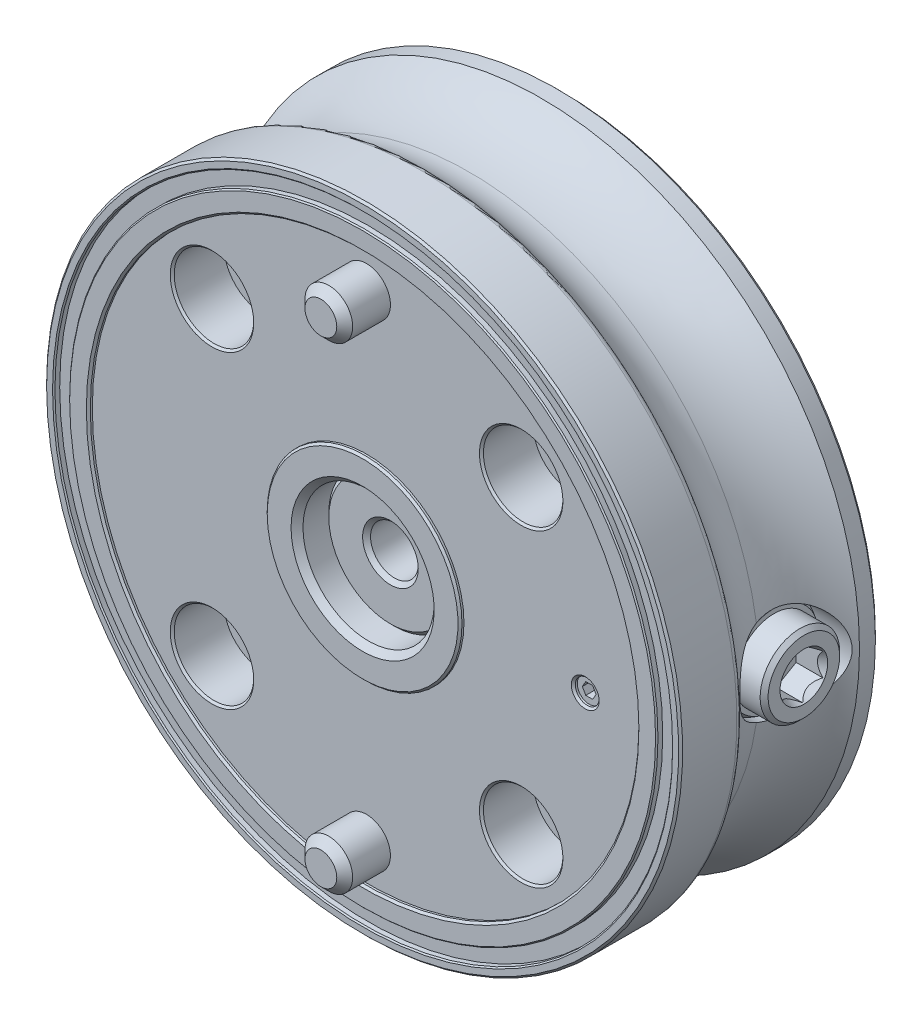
ISO-10303-21;
HEADER;
FILE_DESCRIPTION(('STEP AP214'),'2;1');
FILE_NAME('part.step','',(''),(''),'','','');
FILE_SCHEMA(('AUTOMOTIVE_DESIGN { 1 0 10303 214 1 1 1 1 }'));
ENDSEC;
DATA;
#1=APPLICATION_CONTEXT('core data for automotive mechanical design processes');
#2=APPLICATION_PROTOCOL_DEFINITION('international standard','automotive_design',2000,#1);
#3=PRODUCT_CONTEXT('',#1,'mechanical');
#4=PRODUCT('Part','Part','',(#3));
#5=PRODUCT_RELATED_PRODUCT_CATEGORY('part','',(#4));
#6=PRODUCT_DEFINITION_FORMATION('','',#4);
#7=PRODUCT_DEFINITION_CONTEXT('part definition',#1,'design');
#8=PRODUCT_DEFINITION('design','',#6,#7);
#9=PRODUCT_DEFINITION_SHAPE('','',#8);
#10=(LENGTH_UNIT() NAMED_UNIT(*) SI_UNIT(.MILLI.,.METRE.));
#11=(NAMED_UNIT(*) PLANE_ANGLE_UNIT() SI_UNIT($,.RADIAN.));
#12=(NAMED_UNIT(*) SI_UNIT($,.STERADIAN.) SOLID_ANGLE_UNIT());
#13=UNCERTAINTY_MEASURE_WITH_UNIT(LENGTH_MEASURE(1.E-05),#10,'distance_accuracy_value','');
#14=(GEOMETRIC_REPRESENTATION_CONTEXT(3) GLOBAL_UNCERTAINTY_ASSIGNED_CONTEXT((#13)) GLOBAL_UNIT_ASSIGNED_CONTEXT((#10,
#11,#12)) REPRESENTATION_CONTEXT('',''));
#15=CARTESIAN_POINT('',(0.,0.,0.));
#16=DIRECTION('',(0.,0.,1.));
#17=DIRECTION('',(1.,0.,0.));
#18=AXIS2_PLACEMENT_3D('',#15,#16,#17);
#19=CARTESIAN_POINT('',(55.,0.,16.));
#20=DIRECTION('',(0.,0.,1.));
#21=DIRECTION('',(1.,0.,0.));
#22=AXIS2_PLACEMENT_3D('',#19,#20,#21);
#23=CYLINDRICAL_SURFACE('',#22,3.);
#24=CARTESIAN_POINT('',(55.,0.,48.));
#25=DIRECTION('',(0.,0.,-1.));
#26=DIRECTION('',(-1.,0.,0.));
#27=AXIS2_PLACEMENT_3D('',#24,#25,#26);
#28=CIRCLE('',#27,3.);
#29=CARTESIAN_POINT('',(52.,0.,48.));
#30=VERTEX_POINT('',#29);
#31=EDGE_CURVE('E9',#30,#30,#28,.T.);
#32=ORIENTED_EDGE('',*,*,#31,.T.);
#33=EDGE_LOOP('',(#32));
#34=FACE_BOUND('',#33,.T.);
#35=CARTESIAN_POINT('',(55.,0.,48.5));
#36=DIRECTION('',(0.,0.,1.));
#37=DIRECTION('',(1.,0.,0.));
#38=AXIS2_PLACEMENT_3D('',#35,#36,#37);
#39=CIRCLE('',#38,3.);
#40=CARTESIAN_POINT('',(58.,0.,48.5));
#41=VERTEX_POINT('',#40);
#42=EDGE_CURVE('E18',#41,#41,#39,.F.);
#43=ORIENTED_EDGE('',*,*,#42,.F.);
#44=EDGE_LOOP('',(#43));
#45=FACE_BOUND('',#44,.T.);
#46=ADVANCED_FACE('F14',(#34,#45),#23,.F.);
#47=CARTESIAN_POINT('',(55.,0.,49.));
#48=DIRECTION('',(0.,0.,1.));
#49=DIRECTION('',(1.,0.,0.));
#50=AXIS2_PLACEMENT_3D('',#47,#48,#49);
#51=CONICAL_SURFACE('',#50,3.5,0.78539816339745);
#52=ORIENTED_EDGE('',*,*,#42,.T.);
#53=EDGE_LOOP('',(#52));
#54=FACE_BOUND('',#53,.T.);
#55=CARTESIAN_POINT('',(55.,0.,49.));
#56=DIRECTION('',(0.,0.,1.));
#57=DIRECTION('',(1.,0.,0.));
#58=AXIS2_PLACEMENT_3D('',#55,#56,#57);
#59=CIRCLE('',#58,3.5);
#60=CARTESIAN_POINT('',(58.5,0.,49.));
#61=VERTEX_POINT('',#60);
#62=EDGE_CURVE('E139',#61,#61,#59,.T.);
#63=ORIENTED_EDGE('',*,*,#62,.T.);
#64=EDGE_LOOP('',(#63));
#65=FACE_BOUND('',#64,.T.);
#66=ADVANCED_FACE('F256',(#54,#65),#51,.F.);
#67=CARTESIAN_POINT('',(0.,0.,49.));
#68=DIRECTION('',(0.,0.,1.));
#69=DIRECTION('',(1.,0.,0.));
#70=AXIS2_PLACEMENT_3D('',#67,#68,#69);
#71=PLANE('',#70);
#72=CARTESIAN_POINT('',(0.,60.,49.));
#73=DIRECTION('',(0.,0.,1.));
#74=DIRECTION('',(0.,1.,0.));
#75=AXIS2_PLACEMENT_3D('',#72,#73,#74);
#76=CIRCLE('',#75,6.);
#77=CARTESIAN_POINT('',(0.,66.,49.));
#78=VERTEX_POINT('',#77);
#79=EDGE_CURVE('E505',#78,#78,#76,.T.);
#80=ORIENTED_EDGE('',*,*,#79,.F.);
#81=EDGE_LOOP('',(#80));
#82=FACE_BOUND('',#81,.T.);
#83=ORIENTED_EDGE('',*,*,#62,.F.);
#84=EDGE_LOOP('',(#83));
#85=FACE_BOUND('',#84,.T.);
#86=CARTESIAN_POINT('',(38.8908729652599,-38.8908729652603,49.));
#87=DIRECTION('',(0.,0.,1.));
#88=DIRECTION('',(1.,0.,0.));
#89=AXIS2_PLACEMENT_3D('',#86,#87,#88);
#90=CIRCLE('',#89,10.5);
#91=CARTESIAN_POINT('',(49.3908729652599,-38.8908729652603,49.));
#92=VERTEX_POINT('',#91);
#93=EDGE_CURVE('E734',#92,#92,#90,.T.);
#94=ORIENTED_EDGE('',*,*,#93,.F.);
#95=EDGE_LOOP('',(#94));
#96=FACE_BOUND('',#95,.T.);
#97=CARTESIAN_POINT('',(-38.8908729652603,-38.8908729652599,49.));
#98=DIRECTION('',(0.,0.,1.));
#99=DIRECTION('',(1.,0.,0.));
#100=AXIS2_PLACEMENT_3D('',#97,#98,#99);
#101=CIRCLE('',#100,10.5);
#102=CARTESIAN_POINT('',(-28.3908729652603,-38.8908729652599,49.));
#103=VERTEX_POINT('',#102);
#104=EDGE_CURVE('E738',#103,#103,#101,.T.);
#105=ORIENTED_EDGE('',*,*,#104,.F.);
#106=EDGE_LOOP('',(#105));
#107=FACE_BOUND('',#106,.T.);
#108=CARTESIAN_POINT('',(-38.8908729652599,38.8908729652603,49.));
#109=DIRECTION('',(0.,0.,1.));
#110=DIRECTION('',(1.,0.,0.));
#111=AXIS2_PLACEMENT_3D('',#108,#109,#110);
#112=CIRCLE('',#111,10.5);
#113=CARTESIAN_POINT('',(-28.3908729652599,38.8908729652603,49.));
#114=VERTEX_POINT('',#113);
#115=EDGE_CURVE('E742',#114,#114,#112,.T.);
#116=ORIENTED_EDGE('',*,*,#115,.F.);
#117=EDGE_LOOP('',(#116));
#118=FACE_BOUND('',#117,.T.);
#119=CARTESIAN_POINT('',(38.8908729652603,38.8908729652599,49.));
#120=DIRECTION('',(0.,0.,1.));
#121=DIRECTION('',(1.,0.,0.));
#122=AXIS2_PLACEMENT_3D('',#119,#120,#121);
#123=CIRCLE('',#122,10.5);
#124=CARTESIAN_POINT('',(49.3908729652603,38.8908729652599,49.));
#125=VERTEX_POINT('',#124);
#126=EDGE_CURVE('E746',#125,#125,#123,.T.);
#127=ORIENTED_EDGE('',*,*,#126,.F.);
#128=EDGE_LOOP('',(#127));
#129=FACE_BOUND('',#128,.T.);
#130=CARTESIAN_POINT('',(0.,0.,49.));
#131=DIRECTION('',(0.,0.,1.));
#132=DIRECTION('',(1.,0.,0.));
#133=AXIS2_PLACEMENT_3D('',#130,#131,#132);
#134=CIRCLE('',#133,24.5);
#135=CARTESIAN_POINT('',(24.5,0.,49.));
#136=VERTEX_POINT('',#135);
#137=EDGE_CURVE('E750',#136,#136,#134,.T.);
#138=ORIENTED_EDGE('',*,*,#137,.F.);
#139=EDGE_LOOP('',(#138));
#140=FACE_BOUND('',#139,.T.);
#141=CARTESIAN_POINT('',(0.,0.,49.));
#142=DIRECTION('',(0.,0.,1.));
#143=DIRECTION('',(1.,0.,0.));
#144=AXIS2_PLACEMENT_3D('',#141,#142,#143);
#145=CIRCLE('',#144,69.);
#146=CARTESIAN_POINT('',(69.,0.,49.));
#147=VERTEX_POINT('',#146);
#148=EDGE_CURVE('E754',#147,#147,#145,.T.);
#149=ORIENTED_EDGE('',*,*,#148,.T.);
#150=EDGE_LOOP('',(#149));
#151=FACE_BOUND('',#150,.T.);
#152=CARTESIAN_POINT('',(0.,-60.,49.));
#153=DIRECTION('',(0.,0.,1.));
#154=DIRECTION('',(0.,1.,0.));
#155=AXIS2_PLACEMENT_3D('',#152,#153,#154);
#156=CIRCLE('',#155,6.);
#157=CARTESIAN_POINT('',(0.,-54.,49.));
#158=VERTEX_POINT('',#157);
#159=EDGE_CURVE('E506',#158,#158,#156,.T.);
#160=ORIENTED_EDGE('',*,*,#159,.F.);
#161=EDGE_LOOP('',(#160));
#162=FACE_BOUND('',#161,.T.);
#163=ADVANCED_FACE('F453',(#82,#85,#96,#107,#118,#129,#140,#151,#162),#71,.T.);
#164=CARTESIAN_POINT('',(0.,60.,117.10207800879));
#165=DIRECTION('',(0.,0.,1.));
#166=DIRECTION('',(0.,1.,0.));
#167=AXIS2_PLACEMENT_3D('',#164,#165,#166);
#168=CYLINDRICAL_SURFACE('',#167,6.);
#169=CARTESIAN_POINT('',(0.,60.,58.5));
#170=DIRECTION('',(0.,0.,-1.));
#171=DIRECTION('',(0.,-1.,0.));
#172=AXIS2_PLACEMENT_3D('',#169,#170,#171);
#173=CIRCLE('',#172,6.);
#174=CARTESIAN_POINT('',(0.,54.,58.5));
#175=VERTEX_POINT('',#174);
#176=EDGE_CURVE('E327',#175,#175,#173,.T.);
#177=ORIENTED_EDGE('',*,*,#176,.T.);
#178=EDGE_LOOP('',(#177));
#179=FACE_BOUND('',#178,.T.);
#180=ORIENTED_EDGE('',*,*,#79,.T.);
#181=EDGE_LOOP('',(#180));
#182=FACE_BOUND('',#181,.T.);
#183=ADVANCED_FACE('F473',(#179,#182),#168,.T.);
#184=CARTESIAN_POINT('',(38.8908729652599,-38.8908729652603,49.));
#185=DIRECTION('',(0.,0.,1.));
#186=DIRECTION('',(1.,0.,0.));
#187=AXIS2_PLACEMENT_3D('',#184,#185,#186);
#188=CONICAL_SURFACE('',#187,10.5,0.785398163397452);
#189=CARTESIAN_POINT('',(38.8908729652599,-38.8908729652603,48.5));
#190=DIRECTION('',(0.,0.,1.));
#191=DIRECTION('',(1.,0.,0.));
#192=AXIS2_PLACEMENT_3D('',#189,#190,#191);
#193=CIRCLE('',#192,10.);
#194=CARTESIAN_POINT('',(48.8908729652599,-38.8908729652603,48.5));
#195=VERTEX_POINT('',#194);
#196=EDGE_CURVE('E827',#195,#195,#193,.T.);
#197=ORIENTED_EDGE('',*,*,#196,.F.);
#198=EDGE_LOOP('',(#197));
#199=FACE_BOUND('',#198,.T.);
#200=ORIENTED_EDGE('',*,*,#93,.T.);
#201=EDGE_LOOP('',(#200));
#202=FACE_BOUND('',#201,.T.);
#203=ADVANCED_FACE('F475',(#199,#202),#188,.F.);
#204=CARTESIAN_POINT('',(-38.8908729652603,-38.8908729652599,49.));
#205=DIRECTION('',(0.,0.,1.));
#206=DIRECTION('',(1.,0.,0.));
#207=AXIS2_PLACEMENT_3D('',#204,#205,#206);
#208=CONICAL_SURFACE('',#207,10.5,0.785398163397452);
#209=CARTESIAN_POINT('',(-38.8908729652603,-38.8908729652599,48.5));
#210=DIRECTION('',(0.,0.,1.));
#211=DIRECTION('',(1.,0.,0.));
#212=AXIS2_PLACEMENT_3D('',#209,#210,#211);
#213=CIRCLE('',#212,10.);
#214=CARTESIAN_POINT('',(-28.8908729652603,-38.8908729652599,48.5));
#215=VERTEX_POINT('',#214);
#216=EDGE_CURVE('E811',#215,#215,#213,.T.);
#217=ORIENTED_EDGE('',*,*,#216,.F.);
#218=EDGE_LOOP('',(#217));
#219=FACE_BOUND('',#218,.T.);
#220=ORIENTED_EDGE('',*,*,#104,.T.);
#221=EDGE_LOOP('',(#220));
#222=FACE_BOUND('',#221,.T.);
#223=ADVANCED_FACE('F1545',(#219,#222),#208,.F.);
#224=CARTESIAN_POINT('',(-38.8908729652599,38.8908729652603,49.));
#225=DIRECTION('',(0.,0.,1.));
#226=DIRECTION('',(1.,0.,0.));
#227=AXIS2_PLACEMENT_3D('',#224,#225,#226);
#228=CONICAL_SURFACE('',#227,10.5,0.785398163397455);
#229=CARTESIAN_POINT('',(-38.8908729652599,38.8908729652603,48.5));
#230=DIRECTION('',(0.,0.,1.));
#231=DIRECTION('',(1.,0.,0.));
#232=AXIS2_PLACEMENT_3D('',#229,#230,#231);
#233=CIRCLE('',#232,10.);
#234=CARTESIAN_POINT('',(-28.8908729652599,38.8908729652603,48.5));
#235=VERTEX_POINT('',#234);
#236=EDGE_CURVE('E795',#235,#235,#233,.T.);
#237=ORIENTED_EDGE('',*,*,#236,.F.);
#238=EDGE_LOOP('',(#237));
#239=FACE_BOUND('',#238,.T.);
#240=ORIENTED_EDGE('',*,*,#115,.T.);
#241=EDGE_LOOP('',(#240));
#242=FACE_BOUND('',#241,.T.);
#243=ADVANCED_FACE('F1550',(#239,#242),#228,.F.);
#244=CARTESIAN_POINT('',(38.8908729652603,38.8908729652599,49.));
#245=DIRECTION('',(0.,0.,1.));
#246=DIRECTION('',(1.,0.,0.));
#247=AXIS2_PLACEMENT_3D('',#244,#245,#246);
#248=CONICAL_SURFACE('',#247,10.5,0.785398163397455);
#249=CARTESIAN_POINT('',(38.8908729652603,38.8908729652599,48.5));
#250=DIRECTION('',(0.,0.,1.));
#251=DIRECTION('',(1.,0.,0.));
#252=AXIS2_PLACEMENT_3D('',#249,#250,#251);
#253=CIRCLE('',#252,10.);
#254=CARTESIAN_POINT('',(48.8908729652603,38.8908729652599,48.5));
#255=VERTEX_POINT('',#254);
#256=EDGE_CURVE('E779',#255,#255,#253,.T.);
#257=ORIENTED_EDGE('',*,*,#256,.F.);
#258=EDGE_LOOP('',(#257));
#259=FACE_BOUND('',#258,.T.);
#260=ORIENTED_EDGE('',*,*,#126,.T.);
#261=EDGE_LOOP('',(#260));
#262=FACE_BOUND('',#261,.T.);
#263=ADVANCED_FACE('F1011',(#259,#262),#248,.F.);
#264=CARTESIAN_POINT('',(0.,0.,49.));
#265=DIRECTION('',(0.,0.,1.));
#266=DIRECTION('',(1.,0.,0.));
#267=AXIS2_PLACEMENT_3D('',#264,#265,#266);
#268=CYLINDRICAL_SURFACE('',#267,24.5);
#269=CARTESIAN_POINT('',(0.,0.,49.5));
#270=DIRECTION('',(0.,0.,-1.));
#271=DIRECTION('',(-1.,0.,0.));
#272=AXIS2_PLACEMENT_3D('',#269,#270,#271);
#273=CIRCLE('',#272,24.5);
#274=CARTESIAN_POINT('',(-24.5,0.,49.5));
#275=VERTEX_POINT('',#274);
#276=EDGE_CURVE('E957',#275,#275,#273,.T.);
#277=ORIENTED_EDGE('',*,*,#276,.T.);
#278=EDGE_LOOP('',(#277));
#279=FACE_BOUND('',#278,.T.);
#280=ORIENTED_EDGE('',*,*,#137,.T.);
#281=EDGE_LOOP('',(#280));
#282=FACE_BOUND('',#281,.T.);
#283=ADVANCED_FACE('F1009',(#279,#282),#268,.T.);
#284=CARTESIAN_POINT('',(0.,0.,49.));
#285=DIRECTION('',(0.,0.,1.));
#286=DIRECTION('',(1.,0.,0.));
#287=AXIS2_PLACEMENT_3D('',#284,#285,#286);
#288=CYLINDRICAL_SURFACE('',#287,69.);
#289=CARTESIAN_POINT('',(0.,0.,49.5));
#290=DIRECTION('',(0.,0.,-1.));
#291=DIRECTION('',(-1.,0.,0.));
#292=AXIS2_PLACEMENT_3D('',#289,#290,#291);
#293=CIRCLE('',#292,69.);
#294=CARTESIAN_POINT('',(-69.,0.,49.5));
#295=VERTEX_POINT('',#294);
#296=EDGE_CURVE('E948',#295,#295,#293,.F.);
#297=ORIENTED_EDGE('',*,*,#296,.T.);
#298=EDGE_LOOP('',(#297));
#299=FACE_BOUND('',#298,.T.);
#300=ORIENTED_EDGE('',*,*,#148,.F.);
#301=EDGE_LOOP('',(#300));
#302=FACE_BOUND('',#301,.T.);
#303=ADVANCED_FACE('F254',(#299,#302),#288,.F.);
#304=CARTESIAN_POINT('',(0.,-60.,117.10207800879));
#305=DIRECTION('',(0.,0.,1.));
#306=DIRECTION('',(0.,1.,0.));
#307=AXIS2_PLACEMENT_3D('',#304,#305,#306);
#308=CYLINDRICAL_SURFACE('',#307,6.);
#309=CARTESIAN_POINT('',(0.,-60.,58.5));
#310=DIRECTION('',(0.,0.,-1.));
#311=DIRECTION('',(0.,-1.,0.));
#312=AXIS2_PLACEMENT_3D('',#309,#310,#311);
#313=CIRCLE('',#312,6.);
#314=CARTESIAN_POINT('',(0.,-66.,58.5));
#315=VERTEX_POINT('',#314);
#316=EDGE_CURVE('E510',#315,#315,#313,.T.);
#317=ORIENTED_EDGE('',*,*,#316,.T.);
#318=EDGE_LOOP('',(#317));
#319=FACE_BOUND('',#318,.T.);
#320=ORIENTED_EDGE('',*,*,#159,.T.);
#321=EDGE_LOOP('',(#320));
#322=FACE_BOUND('',#321,.T.);
#323=ADVANCED_FACE('F458',(#319,#322),#308,.T.);
#324=CARTESIAN_POINT('',(0.,60.,60.5));
#325=DIRECTION('',(0.,0.,-1.));
#326=DIRECTION('',(0.,-1.,0.));
#327=AXIS2_PLACEMENT_3D('',#324,#325,#326);
#328=CONICAL_SURFACE('',#327,4.,0.785398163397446);
#329=ORIENTED_EDGE('',*,*,#176,.F.);
#330=EDGE_LOOP('',(#329));
#331=FACE_BOUND('',#330,.T.);
#332=CARTESIAN_POINT('',(0.,60.,60.5));
#333=DIRECTION('',(0.,0.,-1.));
#334=DIRECTION('',(0.,-1.,0.));
#335=AXIS2_PLACEMENT_3D('',#332,#333,#334);
#336=CIRCLE('',#335,4.);
#337=CARTESIAN_POINT('',(0.,56.,60.5));
#338=VERTEX_POINT('',#337);
#339=EDGE_CURVE('E504',#338,#338,#336,.F.);
#340=ORIENTED_EDGE('',*,*,#339,.F.);
#341=EDGE_LOOP('',(#340));
#342=FACE_BOUND('',#341,.T.);
#343=ADVANCED_FACE('F353',(#331,#342),#328,.T.);
#344=CARTESIAN_POINT('',(38.8908729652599,-38.8908729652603,49.));
#345=DIRECTION('',(0.,0.,1.));
#346=DIRECTION('',(1.,0.,0.));
#347=AXIS2_PLACEMENT_3D('',#344,#345,#346);
#348=CYLINDRICAL_SURFACE('',#347,10.);
#349=CARTESIAN_POINT('',(38.8908729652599,-38.8908729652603,36.));
#350=DIRECTION('',(0.,0.,1.));
#351=DIRECTION('',(1.,0.,0.));
#352=AXIS2_PLACEMENT_3D('',#349,#350,#351);
#353=CIRCLE('',#352,10.);
#354=CARTESIAN_POINT('',(48.8908729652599,-38.8908729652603,36.));
#355=VERTEX_POINT('',#354);
#356=EDGE_CURVE('E824',#355,#355,#353,.T.);
#357=ORIENTED_EDGE('',*,*,#356,.F.);
#358=EDGE_LOOP('',(#357));
#359=FACE_BOUND('',#358,.T.);
#360=ORIENTED_EDGE('',*,*,#196,.T.);
#361=EDGE_LOOP('',(#360));
#362=FACE_BOUND('',#361,.T.);
#363=ADVANCED_FACE('F255',(#359,#362),#348,.F.);
#364=CARTESIAN_POINT('',(-38.8908729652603,-38.8908729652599,49.));
#365=DIRECTION('',(0.,0.,1.));
#366=DIRECTION('',(1.,0.,0.));
#367=AXIS2_PLACEMENT_3D('',#364,#365,#366);
#368=CYLINDRICAL_SURFACE('',#367,10.);
#369=CARTESIAN_POINT('',(-38.8908729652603,-38.8908729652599,36.));
#370=DIRECTION('',(0.,0.,1.));
#371=DIRECTION('',(1.,0.,0.));
#372=AXIS2_PLACEMENT_3D('',#369,#370,#371);
#373=CIRCLE('',#372,10.);
#374=CARTESIAN_POINT('',(-28.8908729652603,-38.8908729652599,36.));
#375=VERTEX_POINT('',#374);
#376=EDGE_CURVE('E808',#375,#375,#373,.T.);
#377=ORIENTED_EDGE('',*,*,#376,.F.);
#378=EDGE_LOOP('',(#377));
#379=FACE_BOUND('',#378,.T.);
#380=ORIENTED_EDGE('',*,*,#216,.T.);
#381=EDGE_LOOP('',(#380));
#382=FACE_BOUND('',#381,.T.);
#383=ADVANCED_FACE('F497',(#379,#382),#368,.F.);
#384=CARTESIAN_POINT('',(-38.8908729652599,38.8908729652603,49.));
#385=DIRECTION('',(0.,0.,1.));
#386=DIRECTION('',(1.,0.,0.));
#387=AXIS2_PLACEMENT_3D('',#384,#385,#386);
#388=CYLINDRICAL_SURFACE('',#387,10.);
#389=CARTESIAN_POINT('',(-38.8908729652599,38.8908729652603,36.));
#390=DIRECTION('',(0.,0.,1.));
#391=DIRECTION('',(1.,0.,0.));
#392=AXIS2_PLACEMENT_3D('',#389,#390,#391);
#393=CIRCLE('',#392,10.);
#394=CARTESIAN_POINT('',(-28.8908729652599,38.8908729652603,36.));
#395=VERTEX_POINT('',#394);
#396=EDGE_CURVE('E792',#395,#395,#393,.T.);
#397=ORIENTED_EDGE('',*,*,#396,.F.);
#398=EDGE_LOOP('',(#397));
#399=FACE_BOUND('',#398,.T.);
#400=ORIENTED_EDGE('',*,*,#236,.T.);
#401=EDGE_LOOP('',(#400));
#402=FACE_BOUND('',#401,.T.);
#403=ADVANCED_FACE('F1537',(#399,#402),#388,.F.);
#404=CARTESIAN_POINT('',(38.8908729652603,38.8908729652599,49.));
#405=DIRECTION('',(0.,0.,1.));
#406=DIRECTION('',(1.,0.,0.));
#407=AXIS2_PLACEMENT_3D('',#404,#405,#406);
#408=CYLINDRICAL_SURFACE('',#407,10.);
#409=CARTESIAN_POINT('',(38.8908729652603,38.8908729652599,36.));
#410=DIRECTION('',(0.,0.,1.));
#411=DIRECTION('',(1.,0.,0.));
#412=AXIS2_PLACEMENT_3D('',#409,#410,#411);
#413=CIRCLE('',#412,10.);
#414=CARTESIAN_POINT('',(48.8908729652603,38.8908729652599,36.));
#415=VERTEX_POINT('',#414);
#416=EDGE_CURVE('E776',#415,#415,#413,.T.);
#417=ORIENTED_EDGE('',*,*,#416,.F.);
#418=EDGE_LOOP('',(#417));
#419=FACE_BOUND('',#418,.T.);
#420=ORIENTED_EDGE('',*,*,#256,.T.);
#421=EDGE_LOOP('',(#420));
#422=FACE_BOUND('',#421,.T.);
#423=ADVANCED_FACE('F1027',(#419,#422),#408,.F.);
#424=CARTESIAN_POINT('',(0.,0.,50.));
#425=DIRECTION('',(0.,0.,-1.));
#426=DIRECTION('',(-1.,0.,0.));
#427=AXIS2_PLACEMENT_3D('',#424,#425,#426);
#428=CONICAL_SURFACE('',#427,24.,0.785398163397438);
#429=ORIENTED_EDGE('',*,*,#276,.F.);
#430=EDGE_LOOP('',(#429));
#431=FACE_BOUND('',#430,.T.);
#432=CARTESIAN_POINT('',(0.,0.,50.));
#433=DIRECTION('',(0.,0.,-1.));
#434=DIRECTION('',(-1.,0.,0.));
#435=AXIS2_PLACEMENT_3D('',#432,#433,#434);
#436=CIRCLE('',#435,24.);
#437=CARTESIAN_POINT('',(-24.,0.,50.));
#438=VERTEX_POINT('',#437);
#439=EDGE_CURVE('E954',#438,#438,#436,.F.);
#440=ORIENTED_EDGE('',*,*,#439,.F.);
#441=EDGE_LOOP('',(#440));
#442=FACE_BOUND('',#441,.T.);
#443=ADVANCED_FACE('F1021',(#431,#442),#428,.T.);
#444=CARTESIAN_POINT('',(0.,0.,49.5));
#445=DIRECTION('',(0.,0.,1.));
#446=DIRECTION('',(1.,0.,0.));
#447=AXIS2_PLACEMENT_3D('',#444,#445,#446);
#448=CONICAL_SURFACE('',#447,69.,0.785398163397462);
#449=CARTESIAN_POINT('',(0.,0.,50.));
#450=DIRECTION('',(0.,0.,-1.));
#451=DIRECTION('',(-1.,0.,0.));
#452=AXIS2_PLACEMENT_3D('',#449,#450,#451);
#453=CIRCLE('',#452,69.5);
#454=CARTESIAN_POINT('',(-69.5,0.,50.));
#455=VERTEX_POINT('',#454);
#456=EDGE_CURVE('E951',#455,#455,#453,.T.);
#457=ORIENTED_EDGE('',*,*,#456,.F.);
#458=EDGE_LOOP('',(#457));
#459=FACE_BOUND('',#458,.T.);
#460=ORIENTED_EDGE('',*,*,#296,.F.);
#461=EDGE_LOOP('',(#460));
#462=FACE_BOUND('',#461,.T.);
#463=ADVANCED_FACE('F236',(#459,#462),#448,.F.);
#464=CARTESIAN_POINT('',(0.,-60.,60.5));
#465=DIRECTION('',(0.,0.,-1.));
#466=DIRECTION('',(0.,-1.,0.));
#467=AXIS2_PLACEMENT_3D('',#464,#465,#466);
#468=CONICAL_SURFACE('',#467,4.,0.785398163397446);
#469=ORIENTED_EDGE('',*,*,#316,.F.);
#470=EDGE_LOOP('',(#469));
#471=FACE_BOUND('',#470,.T.);
#472=CARTESIAN_POINT('',(0.,-60.,60.5));
#473=DIRECTION('',(0.,0.,-1.));
#474=DIRECTION('',(0.,-1.,0.));
#475=AXIS2_PLACEMENT_3D('',#472,#473,#474);
#476=CIRCLE('',#475,4.);
#477=CARTESIAN_POINT('',(0.,-64.,60.5));
#478=VERTEX_POINT('',#477);
#479=EDGE_CURVE('E514',#478,#478,#476,.F.);
#480=ORIENTED_EDGE('',*,*,#479,.F.);
#481=EDGE_LOOP('',(#480));
#482=FACE_BOUND('',#481,.T.);
#483=ADVANCED_FACE('F463',(#471,#482),#468,.T.);
#484=CARTESIAN_POINT('',(-6.,60.,60.5));
#485=DIRECTION('',(0.,0.,-1.));
#486=DIRECTION('',(0.,-1.,0.));
#487=AXIS2_PLACEMENT_3D('',#484,#485,#486);
#488=PLANE('',#487);
#489=ORIENTED_EDGE('',*,*,#339,.T.);
#490=EDGE_LOOP('',(#489));
#491=FACE_BOUND('',#490,.T.);
#492=ADVANCED_FACE('F471',(#491),#488,.F.);
#493=CARTESIAN_POINT('',(38.8908729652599,-28.8908729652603,36.));
#494=DIRECTION('',(0.,0.,-1.));
#495=DIRECTION('',(-1.,0.,0.));
#496=AXIS2_PLACEMENT_3D('',#493,#494,#495);
#497=PLANE('',#496);
#498=CARTESIAN_POINT('',(38.8908729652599,-38.8908729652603,36.));
#499=DIRECTION('',(0.,0.,1.));
#500=DIRECTION('',(1.,0.,0.));
#501=AXIS2_PLACEMENT_3D('',#498,#499,#500);
#502=CIRCLE('',#501,7.);
#503=CARTESIAN_POINT('',(45.8908729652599,-38.8908729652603,36.));
#504=VERTEX_POINT('',#503);
#505=EDGE_CURVE('E821',#504,#504,#502,.T.);
#506=ORIENTED_EDGE('',*,*,#505,.F.);
#507=EDGE_LOOP('',(#506));
#508=FACE_BOUND('',#507,.T.);
#509=ORIENTED_EDGE('',*,*,#356,.T.);
#510=EDGE_LOOP('',(#509));
#511=FACE_BOUND('',#510,.T.);
#512=ADVANCED_FACE('F478',(#508,#511),#497,.F.);
#513=CARTESIAN_POINT('',(-38.8908729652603,-28.8908729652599,36.));
#514=DIRECTION('',(0.,0.,-1.));
#515=DIRECTION('',(-1.,0.,0.));
#516=AXIS2_PLACEMENT_3D('',#513,#514,#515);
#517=PLANE('',#516);
#518=CARTESIAN_POINT('',(-38.8908729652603,-38.8908729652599,36.));
#519=DIRECTION('',(0.,0.,1.));
#520=DIRECTION('',(1.,0.,0.));
#521=AXIS2_PLACEMENT_3D('',#518,#519,#520);
#522=CIRCLE('',#521,7.);
#523=CARTESIAN_POINT('',(-31.8908729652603,-38.8908729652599,36.));
#524=VERTEX_POINT('',#523);
#525=EDGE_CURVE('E805',#524,#524,#522,.T.);
#526=ORIENTED_EDGE('',*,*,#525,.F.);
#527=EDGE_LOOP('',(#526));
#528=FACE_BOUND('',#527,.T.);
#529=ORIENTED_EDGE('',*,*,#376,.T.);
#530=EDGE_LOOP('',(#529));
#531=FACE_BOUND('',#530,.T.);
#532=ADVANCED_FACE('F484',(#528,#531),#517,.F.);
#533=CARTESIAN_POINT('',(-38.8908729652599,48.8908729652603,36.));
#534=DIRECTION('',(0.,0.,-1.));
#535=DIRECTION('',(-1.,0.,0.));
#536=AXIS2_PLACEMENT_3D('',#533,#534,#535);
#537=PLANE('',#536);
#538=CARTESIAN_POINT('',(-38.8908729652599,38.8908729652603,36.));
#539=DIRECTION('',(0.,0.,1.));
#540=DIRECTION('',(1.,0.,0.));
#541=AXIS2_PLACEMENT_3D('',#538,#539,#540);
#542=CIRCLE('',#541,7.);
#543=CARTESIAN_POINT('',(-31.8908729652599,38.8908729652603,36.));
#544=VERTEX_POINT('',#543);
#545=EDGE_CURVE('E789',#544,#544,#542,.T.);
#546=ORIENTED_EDGE('',*,*,#545,.F.);
#547=EDGE_LOOP('',(#546));
#548=FACE_BOUND('',#547,.T.);
#549=ORIENTED_EDGE('',*,*,#396,.T.);
#550=EDGE_LOOP('',(#549));
#551=FACE_BOUND('',#550,.T.);
#552=ADVANCED_FACE('F1506',(#548,#551),#537,.F.);
#553=CARTESIAN_POINT('',(38.8908729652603,48.8908729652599,36.));
#554=DIRECTION('',(0.,0.,-1.));
#555=DIRECTION('',(-1.,0.,0.));
#556=AXIS2_PLACEMENT_3D('',#553,#554,#555);
#557=PLANE('',#556);
#558=CARTESIAN_POINT('',(38.8908729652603,38.8908729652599,36.));
#559=DIRECTION('',(0.,0.,1.));
#560=DIRECTION('',(1.,0.,0.));
#561=AXIS2_PLACEMENT_3D('',#558,#559,#560);
#562=CIRCLE('',#561,7.);
#563=CARTESIAN_POINT('',(45.8908729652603,38.8908729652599,36.));
#564=VERTEX_POINT('',#563);
#565=EDGE_CURVE('E773',#564,#564,#562,.T.);
#566=ORIENTED_EDGE('',*,*,#565,.F.);
#567=EDGE_LOOP('',(#566));
#568=FACE_BOUND('',#567,.T.);
#569=ORIENTED_EDGE('',*,*,#416,.T.);
#570=EDGE_LOOP('',(#569));
#571=FACE_BOUND('',#570,.T.);
#572=ADVANCED_FACE('F1039',(#568,#571),#557,.F.);
#573=CARTESIAN_POINT('',(0.,16.5,50.));
#574=DIRECTION('',(0.,0.,-1.));
#575=DIRECTION('',(-1.,0.,0.));
#576=AXIS2_PLACEMENT_3D('',#573,#574,#575);
#577=PLANE('',#576);
#578=ORIENTED_EDGE('',*,*,#439,.T.);
#579=EDGE_LOOP('',(#578));
#580=FACE_BOUND('',#579,.T.);
#581=CARTESIAN_POINT('',(0.,0.,50.));
#582=DIRECTION('',(0.,0.,-1.));
#583=DIRECTION('',(-1.,0.,0.));
#584=AXIS2_PLACEMENT_3D('',#581,#582,#583);
#585=CIRCLE('',#584,18.);
#586=CARTESIAN_POINT('',(-18.,0.,50.));
#587=VERTEX_POINT('',#586);
#588=EDGE_CURVE('E936',#587,#587,#585,.T.);
#589=ORIENTED_EDGE('',*,*,#588,.T.);
#590=EDGE_LOOP('',(#589));
#591=FACE_BOUND('',#590,.T.);
#592=ADVANCED_FACE('F1032',(#580,#591),#577,.F.);
#593=CARTESIAN_POINT('',(0.,0.,50.));
#594=DIRECTION('',(0.,0.,-1.));
#595=DIRECTION('',(-1.,0.,0.));
#596=AXIS2_PLACEMENT_3D('',#593,#594,#595);
#597=CIRCLE('',#596,73.7);
#598=CARTESIAN_POINT('',(-73.7,0.,50.));
#599=VERTEX_POINT('',#598);
#600=EDGE_CURVE('E272',#599,#599,#597,.F.);
#601=ORIENTED_EDGE('',*,*,#600,.T.);
#602=EDGE_LOOP('',(#601));
#603=FACE_BOUND('',#602,.T.);
#604=ORIENTED_EDGE('',*,*,#456,.T.);
#605=EDGE_LOOP('',(#604));
#606=FACE_BOUND('',#605,.T.);
#607=ADVANCED_FACE('F467',(#603,#606),#577,.F.);
#608=CARTESIAN_POINT('',(-6.,-60.,60.5));
#609=DIRECTION('',(0.,0.,-1.));
#610=DIRECTION('',(0.,-1.,0.));
#611=AXIS2_PLACEMENT_3D('',#608,#609,#610);
#612=PLANE('',#611);
#613=ORIENTED_EDGE('',*,*,#479,.T.);
#614=EDGE_LOOP('',(#613));
#615=FACE_BOUND('',#614,.T.);
#616=ADVANCED_FACE('F442',(#615),#612,.F.);
#617=CARTESIAN_POINT('',(38.8908729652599,-38.8908729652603,49.));
#618=DIRECTION('',(0.,0.,1.));
#619=DIRECTION('',(1.,0.,0.));
#620=AXIS2_PLACEMENT_3D('',#617,#618,#619);
#621=CYLINDRICAL_SURFACE('',#620,7.);
#622=CARTESIAN_POINT('',(38.8908729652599,-38.8908729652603,0.500000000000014));
#623=DIRECTION('',(0.,0.,1.));
#624=DIRECTION('',(1.,0.,0.));
#625=AXIS2_PLACEMENT_3D('',#622,#623,#624);
#626=CIRCLE('',#625,7.);
#627=CARTESIAN_POINT('',(45.8908729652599,-38.8908729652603,0.500000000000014));
#628=VERTEX_POINT('',#627);
#629=EDGE_CURVE('E818',#628,#628,#626,.T.);
#630=ORIENTED_EDGE('',*,*,#629,.F.);
#631=EDGE_LOOP('',(#630));
#632=FACE_BOUND('',#631,.T.);
#633=ORIENTED_EDGE('',*,*,#505,.T.);
#634=EDGE_LOOP('',(#633));
#635=FACE_BOUND('',#634,.T.);
#636=ADVANCED_FACE('F466',(#632,#635),#621,.F.);
#637=CARTESIAN_POINT('',(-38.8908729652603,-38.8908729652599,49.));
#638=DIRECTION('',(0.,0.,1.));
#639=DIRECTION('',(1.,0.,0.));
#640=AXIS2_PLACEMENT_3D('',#637,#638,#639);
#641=CYLINDRICAL_SURFACE('',#640,7.);
#642=CARTESIAN_POINT('',(-38.8908729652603,-38.8908729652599,0.500000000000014));
#643=DIRECTION('',(0.,0.,1.));
#644=DIRECTION('',(1.,0.,0.));
#645=AXIS2_PLACEMENT_3D('',#642,#643,#644);
#646=CIRCLE('',#645,7.);
#647=CARTESIAN_POINT('',(-31.8908729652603,-38.8908729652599,0.500000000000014));
#648=VERTEX_POINT('',#647);
#649=EDGE_CURVE('E802',#648,#648,#646,.T.);
#650=ORIENTED_EDGE('',*,*,#649,.F.);
#651=EDGE_LOOP('',(#650));
#652=FACE_BOUND('',#651,.T.);
#653=ORIENTED_EDGE('',*,*,#525,.T.);
#654=EDGE_LOOP('',(#653));
#655=FACE_BOUND('',#654,.T.);
#656=ADVANCED_FACE('F1530',(#652,#655),#641,.F.);
#657=CARTESIAN_POINT('',(-38.8908729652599,38.8908729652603,49.));
#658=DIRECTION('',(0.,0.,1.));
#659=DIRECTION('',(1.,0.,0.));
#660=AXIS2_PLACEMENT_3D('',#657,#658,#659);
#661=CYLINDRICAL_SURFACE('',#660,7.);
#662=CARTESIAN_POINT('',(-38.8908729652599,38.8908729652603,0.500000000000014));
#663=DIRECTION('',(0.,0.,1.));
#664=DIRECTION('',(1.,0.,0.));
#665=AXIS2_PLACEMENT_3D('',#662,#663,#664);
#666=CIRCLE('',#665,7.);
#667=CARTESIAN_POINT('',(-31.8908729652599,38.8908729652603,0.500000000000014));
#668=VERTEX_POINT('',#667);
#669=EDGE_CURVE('E786',#668,#668,#666,.T.);
#670=ORIENTED_EDGE('',*,*,#669,.F.);
#671=EDGE_LOOP('',(#670));
#672=FACE_BOUND('',#671,.T.);
#673=ORIENTED_EDGE('',*,*,#545,.T.);
#674=EDGE_LOOP('',(#673));
#675=FACE_BOUND('',#674,.T.);
#676=ADVANCED_FACE('F930',(#672,#675),#661,.F.);
#677=CARTESIAN_POINT('',(38.8908729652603,38.8908729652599,49.));
#678=DIRECTION('',(0.,0.,1.));
#679=DIRECTION('',(1.,0.,0.));
#680=AXIS2_PLACEMENT_3D('',#677,#678,#679);
#681=CYLINDRICAL_SURFACE('',#680,7.);
#682=CARTESIAN_POINT('',(38.8908729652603,38.8908729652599,0.500000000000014));
#683=DIRECTION('',(0.,0.,1.));
#684=DIRECTION('',(1.,0.,0.));
#685=AXIS2_PLACEMENT_3D('',#682,#683,#684);
#686=CIRCLE('',#685,7.);
#687=CARTESIAN_POINT('',(45.8908729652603,38.8908729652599,0.500000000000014));
#688=VERTEX_POINT('',#687);
#689=EDGE_CURVE('E770',#688,#688,#686,.T.);
#690=ORIENTED_EDGE('',*,*,#689,.F.);
#691=EDGE_LOOP('',(#690));
#692=FACE_BOUND('',#691,.T.);
#693=ORIENTED_EDGE('',*,*,#565,.T.);
#694=EDGE_LOOP('',(#693));
#695=FACE_BOUND('',#694,.T.);
#696=ADVANCED_FACE('F921',(#692,#695),#681,.F.);
#697=CARTESIAN_POINT('',(0.,0.,48.5));
#698=DIRECTION('',(0.,0.,1.));
#699=DIRECTION('',(1.,0.,0.));
#700=AXIS2_PLACEMENT_3D('',#697,#698,#699);
#701=CONICAL_SURFACE('',#700,16.5,0.785398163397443);
#702=ORIENTED_EDGE('',*,*,#588,.F.);
#703=EDGE_LOOP('',(#702));
#704=FACE_BOUND('',#703,.T.);
#705=CARTESIAN_POINT('',(0.,0.,48.5));
#706=DIRECTION('',(0.,0.,-1.));
#707=DIRECTION('',(-1.,0.,0.));
#708=AXIS2_PLACEMENT_3D('',#705,#706,#707);
#709=CIRCLE('',#708,16.5);
#710=CARTESIAN_POINT('',(-16.5,0.,48.5));
#711=VERTEX_POINT('',#710);
#712=EDGE_CURVE('E201',#711,#711,#709,.F.);
#713=ORIENTED_EDGE('',*,*,#712,.F.);
#714=EDGE_LOOP('',(#713));
#715=FACE_BOUND('',#714,.T.);
#716=ADVANCED_FACE('F919',(#704,#715),#701,.F.);
#717=CARTESIAN_POINT('',(0.,0.,50.));
#718=DIRECTION('',(0.,0.,-1.));
#719=DIRECTION('',(-1.,0.,0.));
#720=AXIS2_PLACEMENT_3D('',#717,#718,#719);
#721=CONICAL_SURFACE('',#720,73.7,0.785398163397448);
#722=CARTESIAN_POINT('',(0.,0.,49.7));
#723=DIRECTION('',(0.,0.,-1.));
#724=DIRECTION('',(-1.,0.,0.));
#725=AXIS2_PLACEMENT_3D('',#722,#723,#724);
#726=CIRCLE('',#725,74.);
#727=CARTESIAN_POINT('',(-74.,0.,49.7));
#728=VERTEX_POINT('',#727);
#729=EDGE_CURVE('E275',#728,#728,#726,.T.);
#730=ORIENTED_EDGE('',*,*,#729,.F.);
#731=EDGE_LOOP('',(#730));
#732=FACE_BOUND('',#731,.T.);
#733=ORIENTED_EDGE('',*,*,#600,.F.);
#734=EDGE_LOOP('',(#733));
#735=FACE_BOUND('',#734,.T.);
#736=ADVANCED_FACE('F918',(#732,#735),#721,.T.);
#737=CARTESIAN_POINT('',(38.8908729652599,-38.8908729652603,0.500000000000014));
#738=DIRECTION('',(0.,0.,-1.));
#739=DIRECTION('',(-1.,0.,0.));
#740=AXIS2_PLACEMENT_3D('',#737,#738,#739);
#741=CONICAL_SURFACE('',#740,7.,0.785398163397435);
#742=CARTESIAN_POINT('',(38.8908729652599,-38.8908729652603,0.));
#743=DIRECTION('',(0.,0.,1.));
#744=DIRECTION('',(1.,0.,0.));
#745=AXIS2_PLACEMENT_3D('',#742,#743,#744);
#746=CIRCLE('',#745,7.5);
#747=CARTESIAN_POINT('',(46.3908729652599,-38.8908729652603,0.));
#748=VERTEX_POINT('',#747);
#749=EDGE_CURVE('E815',#748,#748,#746,.T.);
#750=ORIENTED_EDGE('',*,*,#749,.F.);
#751=EDGE_LOOP('',(#750));
#752=FACE_BOUND('',#751,.T.);
#753=ORIENTED_EDGE('',*,*,#629,.T.);
#754=EDGE_LOOP('',(#753));
#755=FACE_BOUND('',#754,.T.);
#756=ADVANCED_FACE('F928',(#752,#755),#741,.F.);
#757=CARTESIAN_POINT('',(-38.8908729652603,-38.8908729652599,0.500000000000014));
#758=DIRECTION('',(0.,0.,-1.));
#759=DIRECTION('',(-1.,0.,0.));
#760=AXIS2_PLACEMENT_3D('',#757,#758,#759);
#761=CONICAL_SURFACE('',#760,7.,0.785398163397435);
#762=CARTESIAN_POINT('',(-38.8908729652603,-38.8908729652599,0.));
#763=DIRECTION('',(0.,0.,1.));
#764=DIRECTION('',(1.,0.,0.));
#765=AXIS2_PLACEMENT_3D('',#762,#763,#764);
#766=CIRCLE('',#765,7.5);
#767=CARTESIAN_POINT('',(-31.3908729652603,-38.8908729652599,0.));
#768=VERTEX_POINT('',#767);
#769=EDGE_CURVE('E799',#768,#768,#766,.T.);
#770=ORIENTED_EDGE('',*,*,#769,.F.);
#771=EDGE_LOOP('',(#770));
#772=FACE_BOUND('',#771,.T.);
#773=ORIENTED_EDGE('',*,*,#649,.T.);
#774=EDGE_LOOP('',(#773));
#775=FACE_BOUND('',#774,.T.);
#776=ADVANCED_FACE('F1560',(#772,#775),#761,.F.);
#777=CARTESIAN_POINT('',(-38.8908729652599,38.8908729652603,0.500000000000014));
#778=DIRECTION('',(0.,0.,-1.));
#779=DIRECTION('',(-1.,0.,0.));
#780=AXIS2_PLACEMENT_3D('',#777,#778,#779);
#781=CONICAL_SURFACE('',#780,7.,0.785398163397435);
#782=CARTESIAN_POINT('',(-38.8908729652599,38.8908729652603,0.));
#783=DIRECTION('',(0.,0.,1.));
#784=DIRECTION('',(1.,0.,0.));
#785=AXIS2_PLACEMENT_3D('',#782,#783,#784);
#786=CIRCLE('',#785,7.5);
#787=CARTESIAN_POINT('',(-31.3908729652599,38.8908729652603,0.));
#788=VERTEX_POINT('',#787);
#789=EDGE_CURVE('E783',#788,#788,#786,.T.);
#790=ORIENTED_EDGE('',*,*,#789,.F.);
#791=EDGE_LOOP('',(#790));
#792=FACE_BOUND('',#791,.T.);
#793=ORIENTED_EDGE('',*,*,#669,.T.);
#794=EDGE_LOOP('',(#793));
#795=FACE_BOUND('',#794,.T.);
#796=ADVANCED_FACE('F1587',(#792,#795),#781,.F.);
#797=CARTESIAN_POINT('',(38.8908729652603,38.8908729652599,0.500000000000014));
#798=DIRECTION('',(0.,0.,-1.));
#799=DIRECTION('',(-1.,0.,0.));
#800=AXIS2_PLACEMENT_3D('',#797,#798,#799);
#801=CONICAL_SURFACE('',#800,7.,0.785398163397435);
#802=CARTESIAN_POINT('',(38.8908729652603,38.8908729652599,0.));
#803=DIRECTION('',(0.,0.,1.));
#804=DIRECTION('',(1.,0.,0.));
#805=AXIS2_PLACEMENT_3D('',#802,#803,#804);
#806=CIRCLE('',#805,7.5);
#807=CARTESIAN_POINT('',(46.3908729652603,38.8908729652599,0.));
#808=VERTEX_POINT('',#807);
#809=EDGE_CURVE('E767',#808,#808,#806,.T.);
#810=ORIENTED_EDGE('',*,*,#809,.F.);
#811=EDGE_LOOP('',(#810));
#812=FACE_BOUND('',#811,.T.);
#813=ORIENTED_EDGE('',*,*,#689,.T.);
#814=EDGE_LOOP('',(#813));
#815=FACE_BOUND('',#814,.T.);
#816=ADVANCED_FACE('F1597',(#812,#815),#801,.F.);
#817=CARTESIAN_POINT('',(0.,0.,56.4129634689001));
#818=DIRECTION('',(0.,0.,1.));
#819=DIRECTION('',(1.,0.,0.));
#820=AXIS2_PLACEMENT_3D('',#817,#818,#819);
#821=CYLINDRICAL_SURFACE('',#820,16.5);
#822=CARTESIAN_POINT('',(0.,0.,42.));
#823=DIRECTION('',(0.,0.,-1.));
#824=DIRECTION('',(-1.,0.,0.));
#825=AXIS2_PLACEMENT_3D('',#822,#823,#824);
#826=CIRCLE('',#825,16.5);
#827=CARTESIAN_POINT('',(-16.5,0.,42.));
#828=VERTEX_POINT('',#827);
#829=EDGE_CURVE('E313',#828,#828,#826,.T.);
#830=ORIENTED_EDGE('',*,*,#829,.T.);
#831=EDGE_LOOP('',(#830));
#832=FACE_BOUND('',#831,.T.);
#833=ORIENTED_EDGE('',*,*,#712,.T.);
#834=EDGE_LOOP('',(#833));
#835=FACE_BOUND('',#834,.T.);
#836=ADVANCED_FACE('F874',(#832,#835),#821,.F.);
#837=CARTESIAN_POINT('',(0.,0.,48.5));
#838=DIRECTION('',(0.,0.,1.));
#839=DIRECTION('',(1.,0.,0.));
#840=AXIS2_PLACEMENT_3D('',#837,#838,#839);
#841=CYLINDRICAL_SURFACE('',#840,74.);
#842=ORIENTED_EDGE('',*,*,#729,.T.);
#843=EDGE_LOOP('',(#842));
#844=FACE_BOUND('',#843,.T.);
#845=CARTESIAN_POINT('',(0.,0.,48.5));
#846=DIRECTION('',(0.,0.,1.));
#847=DIRECTION('',(1.,0.,0.));
#848=AXIS2_PLACEMENT_3D('',#845,#846,#847);
#849=CIRCLE('',#848,74.);
#850=CARTESIAN_POINT('',(74.,0.,48.5));
#851=VERTEX_POINT('',#850);
#852=EDGE_CURVE('E764',#851,#851,#849,.T.);
#853=ORIENTED_EDGE('',*,*,#852,.T.);
#854=EDGE_LOOP('',(#853));
#855=FACE_BOUND('',#854,.T.);
#856=ADVANCED_FACE('F868',(#844,#855),#841,.T.);
#857=CARTESIAN_POINT('',(0.,34.,0.));
#858=DIRECTION('',(0.,0.,1.));
#859=DIRECTION('',(1.,0.,0.));
#860=AXIS2_PLACEMENT_3D('',#857,#858,#859);
#861=PLANE('',#860);
#862=CARTESIAN_POINT('',(0.,-60.,0.));
#863=DIRECTION('',(0.,0.,1.));
#864=DIRECTION('',(1.,0.,0.));
#865=AXIS2_PLACEMENT_3D('',#862,#863,#864);
#866=CIRCLE('',#865,6.5);
#867=CARTESIAN_POINT('',(6.5,-60.,0.));
#868=VERTEX_POINT('',#867);
#869=EDGE_CURVE('E965',#868,#868,#866,.T.);
#870=ORIENTED_EDGE('',*,*,#869,.T.);
#871=EDGE_LOOP('',(#870));
#872=FACE_BOUND('',#871,.T.);
#873=CARTESIAN_POINT('',(0.,60.,0.));
#874=DIRECTION('',(0.,0.,1.));
#875=DIRECTION('',(1.,0.,0.));
#876=AXIS2_PLACEMENT_3D('',#873,#874,#875);
#877=CIRCLE('',#876,6.5);
#878=CARTESIAN_POINT('',(6.5,60.,0.));
#879=VERTEX_POINT('',#878);
#880=EDGE_CURVE('E963',#879,#879,#877,.T.);
#881=ORIENTED_EDGE('',*,*,#880,.T.);
#882=EDGE_LOOP('',(#881));
#883=FACE_BOUND('',#882,.T.);
#884=ORIENTED_EDGE('',*,*,#749,.T.);
#885=EDGE_LOOP('',(#884));
#886=FACE_BOUND('',#885,.T.);
#887=ORIENTED_EDGE('',*,*,#769,.T.);
#888=EDGE_LOOP('',(#887));
#889=FACE_BOUND('',#888,.T.);
#890=ORIENTED_EDGE('',*,*,#789,.T.);
#891=EDGE_LOOP('',(#890));
#892=FACE_BOUND('',#891,.T.);
#893=ORIENTED_EDGE('',*,*,#809,.T.);
#894=EDGE_LOOP('',(#893));
#895=FACE_BOUND('',#894,.T.);
#896=CARTESIAN_POINT('',(0.,0.,0.));
#897=DIRECTION('',(0.,0.,1.));
#898=DIRECTION('',(1.,0.,0.));
#899=AXIS2_PLACEMENT_3D('',#896,#897,#898);
#900=CIRCLE('',#899,79.);
#901=CARTESIAN_POINT('',(79.,0.,0.));
#902=VERTEX_POINT('',#901);
#903=EDGE_CURVE('E190',#902,#902,#900,.F.);
#904=ORIENTED_EDGE('',*,*,#903,.T.);
#905=EDGE_LOOP('',(#904));
#906=FACE_BOUND('',#905,.T.);
#907=CARTESIAN_POINT('',(0.,0.,0.));
#908=DIRECTION('',(0.,0.,1.));
#909=DIRECTION('',(1.,0.,0.));
#910=AXIS2_PLACEMENT_3D('',#907,#908,#909);
#911=CIRCLE('',#910,34.);
#912=CARTESIAN_POINT('',(34.,0.,0.));
#913=VERTEX_POINT('',#912);
#914=EDGE_CURVE('E152',#913,#913,#911,.T.);
#915=ORIENTED_EDGE('',*,*,#914,.T.);
#916=EDGE_LOOP('',(#915));
#917=FACE_BOUND('',#916,.T.);
#918=ADVANCED_FACE('F712',(#872,#883,#886,#889,#892,#895,#906,#917),#861,.F.);
#919=CARTESIAN_POINT('',(0.,0.,43.));
#920=DIRECTION('',(0.,0.,-1.));
#921=DIRECTION('',(-1.,0.,0.));
#922=AXIS2_PLACEMENT_3D('',#919,#920,#921);
#923=CONICAL_SURFACE('',#922,15.5,0.785398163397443);
#924=ORIENTED_EDGE('',*,*,#829,.F.);
#925=EDGE_LOOP('',(#924));
#926=FACE_BOUND('',#925,.T.);
#927=CARTESIAN_POINT('',(0.,0.,43.));
#928=DIRECTION('',(0.,0.,-1.));
#929=DIRECTION('',(-1.,0.,0.));
#930=AXIS2_PLACEMENT_3D('',#927,#928,#929);
#931=CIRCLE('',#930,15.5);
#932=CARTESIAN_POINT('',(-15.5,0.,43.));
#933=VERTEX_POINT('',#932);
#934=EDGE_CURVE('E310',#933,#933,#931,.F.);
#935=ORIENTED_EDGE('',*,*,#934,.F.);
#936=EDGE_LOOP('',(#935));
#937=FACE_BOUND('',#936,.T.);
#938=ADVANCED_FACE('F709',(#926,#937),#923,.T.);
#939=CARTESIAN_POINT('',(0.,0.,48.5));
#940=DIRECTION('',(0.,0.,1.));
#941=DIRECTION('',(1.,0.,0.));
#942=AXIS2_PLACEMENT_3D('',#939,#940,#941);
#943=PLANE('',#942);
#944=ORIENTED_EDGE('',*,*,#852,.F.);
#945=EDGE_LOOP('',(#944));
#946=FACE_BOUND('',#945,.T.);
#947=CARTESIAN_POINT('',(0.,0.,48.5));
#948=DIRECTION('',(0.,0.,1.));
#949=DIRECTION('',(1.,0.,0.));
#950=AXIS2_PLACEMENT_3D('',#947,#948,#949);
#951=CIRCLE('',#950,77.7);
#952=CARTESIAN_POINT('',(77.7,0.,48.5));
#953=VERTEX_POINT('',#952);
#954=EDGE_CURVE('E759',#953,#953,#951,.T.);
#955=ORIENTED_EDGE('',*,*,#954,.T.);
#956=EDGE_LOOP('',(#955));
#957=FACE_BOUND('',#956,.T.);
#958=ADVANCED_FACE('F711',(#946,#957),#943,.T.);
#959=CARTESIAN_POINT('',(0.,-60.,0.500000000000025));
#960=DIRECTION('',(0.,0.,-1.));
#961=DIRECTION('',(-1.,0.,0.));
#962=AXIS2_PLACEMENT_3D('',#959,#960,#961);
#963=CONICAL_SURFACE('',#962,6.,0.785398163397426);
#964=ORIENTED_EDGE('',*,*,#869,.F.);
#965=EDGE_LOOP('',(#964));
#966=FACE_BOUND('',#965,.T.);
#967=CARTESIAN_POINT('',(0.,-60.,0.500000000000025));
#968=DIRECTION('',(0.,0.,1.));
#969=DIRECTION('',(1.,0.,0.));
#970=AXIS2_PLACEMENT_3D('',#967,#968,#969);
#971=CIRCLE('',#970,6.);
#972=CARTESIAN_POINT('',(6.,-60.,0.500000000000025));
#973=VERTEX_POINT('',#972);
#974=EDGE_CURVE('E960',#973,#973,#971,.F.);
#975=ORIENTED_EDGE('',*,*,#974,.F.);
#976=EDGE_LOOP('',(#975));
#977=FACE_BOUND('',#976,.T.);
#978=ADVANCED_FACE('F970',(#966,#977),#963,.F.);
#979=CARTESIAN_POINT('',(0.,60.,0.500000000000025));
#980=DIRECTION('',(0.,0.,-1.));
#981=DIRECTION('',(-1.,0.,0.));
#982=AXIS2_PLACEMENT_3D('',#979,#980,#981);
#983=CONICAL_SURFACE('',#982,6.,0.785398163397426);
#984=ORIENTED_EDGE('',*,*,#880,.F.);
#985=EDGE_LOOP('',(#984));
#986=FACE_BOUND('',#985,.T.);
#987=CARTESIAN_POINT('',(0.,60.,0.500000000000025));
#988=DIRECTION('',(0.,0.,1.));
#989=DIRECTION('',(1.,0.,0.));
#990=AXIS2_PLACEMENT_3D('',#987,#988,#989);
#991=CIRCLE('',#990,6.);
#992=CARTESIAN_POINT('',(6.,60.,0.500000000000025));
#993=VERTEX_POINT('',#992);
#994=EDGE_CURVE('E146',#993,#993,#991,.F.);
#995=ORIENTED_EDGE('',*,*,#994,.F.);
#996=EDGE_LOOP('',(#995));
#997=FACE_BOUND('',#996,.T.);
#998=ADVANCED_FACE('F885',(#986,#997),#983,.F.);
#999=CARTESIAN_POINT('',(0.,0.,1.));
#1000=DIRECTION('',(0.,0.,1.));
#1001=DIRECTION('',(1.,0.,0.));
#1002=AXIS2_PLACEMENT_3D('',#999,#1000,#1001);
#1003=CONICAL_SURFACE('',#1002,80.,0.785398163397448);
#1004=ORIENTED_EDGE('',*,*,#903,.F.);
#1005=EDGE_LOOP('',(#1004));
#1006=FACE_BOUND('',#1005,.T.);
#1007=CARTESIAN_POINT('',(0.,0.,1.));
#1008=DIRECTION('',(0.,0.,1.));
#1009=DIRECTION('',(1.,0.,0.));
#1010=AXIS2_PLACEMENT_3D('',#1007,#1008,#1009);
#1011=CIRCLE('',#1010,80.);
#1012=CARTESIAN_POINT('',(80.,0.,1.));
#1013=VERTEX_POINT('',#1012);
#1014=EDGE_CURVE('E187',#1013,#1013,#1011,.T.);
#1015=ORIENTED_EDGE('',*,*,#1014,.F.);
#1016=EDGE_LOOP('',(#1015));
#1017=FACE_BOUND('',#1016,.T.);
#1018=ADVANCED_FACE('F883',(#1006,#1017),#1003,.T.);
#1019=CARTESIAN_POINT('',(0.,0.,0.353553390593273));
#1020=DIRECTION('',(0.,0.,-1.));
#1021=DIRECTION('',(-1.,0.,0.));
#1022=AXIS2_PLACEMENT_3D('',#1019,#1020,#1021);
#1023=CONICAL_SURFACE('',#1022,33.6464466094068,0.785398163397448);
#1024=ORIENTED_EDGE('',*,*,#914,.F.);
#1025=EDGE_LOOP('',(#1024));
#1026=FACE_BOUND('',#1025,.T.);
#1027=CARTESIAN_POINT('',(0.,0.,0.353553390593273));
#1028=DIRECTION('',(0.,0.,1.));
#1029=DIRECTION('',(1.,0.,0.));
#1030=AXIS2_PLACEMENT_3D('',#1027,#1028,#1029);
#1031=CIRCLE('',#1030,33.6464466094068);
#1032=CARTESIAN_POINT('',(33.6464466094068,0.,0.353553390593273));
#1033=VERTEX_POINT('',#1032);
#1034=EDGE_CURVE('E160',#1033,#1033,#1031,.T.);
#1035=ORIENTED_EDGE('',*,*,#1034,.T.);
#1036=EDGE_LOOP('',(#1035));
#1037=FACE_BOUND('',#1036,.T.);
#1038=ADVANCED_FACE('F880',(#1026,#1037),#1023,.F.);
#1039=CARTESIAN_POINT('',(0.,0.,43.));
#1040=DIRECTION('',(0.,0.,-1.));
#1041=DIRECTION('',(-1.,0.,0.));
#1042=AXIS2_PLACEMENT_3D('',#1039,#1040,#1041);
#1043=PLANE('',#1042);
#1044=CARTESIAN_POINT('',(0.,0.,43.));
#1045=DIRECTION('',(0.,0.,1.));
#1046=DIRECTION('',(1.,0.,0.));
#1047=AXIS2_PLACEMENT_3D('',#1044,#1045,#1046);
#1048=CIRCLE('',#1047,7.);
#1049=CARTESIAN_POINT('',(7.,0.,43.));
#1050=VERTEX_POINT('',#1049);
#1051=EDGE_CURVE('E291',#1050,#1050,#1048,.T.);
#1052=ORIENTED_EDGE('',*,*,#1051,.F.);
#1053=EDGE_LOOP('',(#1052));
#1054=FACE_BOUND('',#1053,.T.);
#1055=ORIENTED_EDGE('',*,*,#934,.T.);
#1056=EDGE_LOOP('',(#1055));
#1057=FACE_BOUND('',#1056,.T.);
#1058=ADVANCED_FACE('F706',(#1054,#1057),#1043,.F.);
#1059=CARTESIAN_POINT('',(0.,0.,48.5));
#1060=DIRECTION('',(0.,0.,1.));
#1061=DIRECTION('',(1.,0.,0.));
#1062=AXIS2_PLACEMENT_3D('',#1059,#1060,#1061);
#1063=CYLINDRICAL_SURFACE('',#1062,77.7);
#1064=CARTESIAN_POINT('',(0.,0.,49.7));
#1065=DIRECTION('',(0.,0.,-1.));
#1066=DIRECTION('',(-1.,0.,0.));
#1067=AXIS2_PLACEMENT_3D('',#1064,#1065,#1066);
#1068=CIRCLE('',#1067,77.7);
#1069=CARTESIAN_POINT('',(-77.7,0.,49.7));
#1070=VERTEX_POINT('',#1069);
#1071=EDGE_CURVE('E145',#1070,#1070,#1068,.F.);
#1072=ORIENTED_EDGE('',*,*,#1071,.T.);
#1073=EDGE_LOOP('',(#1072));
#1074=FACE_BOUND('',#1073,.T.);
#1075=ORIENTED_EDGE('',*,*,#954,.F.);
#1076=EDGE_LOOP('',(#1075));
#1077=FACE_BOUND('',#1076,.T.);
#1078=ADVANCED_FACE('F848',(#1074,#1077),#1063,.F.);
#1079=CARTESIAN_POINT('',(0.,-60.,22.));
#1080=DIRECTION('',(0.,0.,-1.));
#1081=DIRECTION('',(-1.,0.,0.));
#1082=AXIS2_PLACEMENT_3D('',#1079,#1080,#1081);
#1083=CYLINDRICAL_SURFACE('',#1082,6.);
#1084=ORIENTED_EDGE('',*,*,#974,.T.);
#1085=EDGE_LOOP('',(#1084));
#1086=FACE_BOUND('',#1085,.T.);
#1087=CARTESIAN_POINT('',(0.,-60.,22.));
#1088=DIRECTION('',(0.,0.,-1.));
#1089=DIRECTION('',(-1.,0.,0.));
#1090=AXIS2_PLACEMENT_3D('',#1087,#1088,#1089);
#1091=CIRCLE('',#1090,6.);
#1092=CARTESIAN_POINT('',(-6.,-60.,22.));
#1093=VERTEX_POINT('',#1092);
#1094=EDGE_CURVE('E830',#1093,#1093,#1091,.T.);
#1095=ORIENTED_EDGE('',*,*,#1094,.F.);
#1096=EDGE_LOOP('',(#1095));
#1097=FACE_BOUND('',#1096,.T.);
#1098=ADVANCED_FACE('F714',(#1086,#1097),#1083,.F.);
#1099=CARTESIAN_POINT('',(0.,60.,22.));
#1100=DIRECTION('',(0.,0.,-1.));
#1101=DIRECTION('',(-1.,0.,0.));
#1102=AXIS2_PLACEMENT_3D('',#1099,#1100,#1101);
#1103=CYLINDRICAL_SURFACE('',#1102,6.);
#1104=ORIENTED_EDGE('',*,*,#994,.T.);
#1105=EDGE_LOOP('',(#1104));
#1106=FACE_BOUND('',#1105,.T.);
#1107=CARTESIAN_POINT('',(0.,60.,22.));
#1108=DIRECTION('',(0.,0.,-1.));
#1109=DIRECTION('',(-1.,0.,0.));
#1110=AXIS2_PLACEMENT_3D('',#1107,#1108,#1109);
#1111=CIRCLE('',#1110,6.);
#1112=CARTESIAN_POINT('',(-6.,60.,22.));
#1113=VERTEX_POINT('',#1112);
#1114=EDGE_CURVE('E138',#1113,#1113,#1111,.T.);
#1115=ORIENTED_EDGE('',*,*,#1114,.F.);
#1116=EDGE_LOOP('',(#1115));
#1117=FACE_BOUND('',#1116,.T.);
#1118=ADVANCED_FACE('F838',(#1106,#1117),#1103,.F.);
#1119=CARTESIAN_POINT('',(0.,0.,56.4129634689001));
#1120=DIRECTION('',(0.,0.,1.));
#1121=DIRECTION('',(1.,0.,0.));
#1122=AXIS2_PLACEMENT_3D('',#1119,#1120,#1121);
#1123=CYLINDRICAL_SURFACE('',#1122,80.);
#1124=ORIENTED_EDGE('',*,*,#1014,.T.);
#1125=EDGE_LOOP('',(#1124));
#1126=FACE_BOUND('',#1125,.T.);
#1127=CARTESIAN_POINT('',(0.,0.,5.));
#1128=DIRECTION('',(0.,0.,1.));
#1129=DIRECTION('',(1.,0.,0.));
#1130=AXIS2_PLACEMENT_3D('',#1127,#1128,#1129);
#1131=CIRCLE('',#1130,80.);
#1132=CARTESIAN_POINT('',(80.,0.,5.));
#1133=VERTEX_POINT('',#1132);
#1134=EDGE_CURVE('E149',#1133,#1133,#1131,.T.);
#1135=ORIENTED_EDGE('',*,*,#1134,.F.);
#1136=EDGE_LOOP('',(#1135));
#1137=FACE_BOUND('',#1136,.T.);
#1138=ADVANCED_FACE('F213',(#1126,#1137),#1123,.T.);
#1139=CARTESIAN_POINT('',(0.,0.,0.));
#1140=DIRECTION('',(0.,0.,1.));
#1141=DIRECTION('',(1.,0.,0.));
#1142=AXIS2_PLACEMENT_3D('',#1139,#1140,#1141);
#1143=TOROIDAL_SURFACE('',#1142,33.2928932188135,0.5);
#1144=ORIENTED_EDGE('',*,*,#1034,.F.);
#1145=EDGE_LOOP('',(#1144));
#1146=FACE_BOUND('',#1145,.T.);
#1147=CARTESIAN_POINT('',(0.,0.,0.5));
#1148=DIRECTION('',(0.,0.,1.));
#1149=DIRECTION('',(1.,0.,0.));
#1150=AXIS2_PLACEMENT_3D('',#1147,#1148,#1149);
#1151=CIRCLE('',#1150,33.2928932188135);
#1152=CARTESIAN_POINT('',(33.2928932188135,0.,0.5));
#1153=VERTEX_POINT('',#1152);
#1154=EDGE_CURVE('E163',#1153,#1153,#1151,.T.);
#1155=ORIENTED_EDGE('',*,*,#1154,.T.);
#1156=EDGE_LOOP('',(#1155));
#1157=FACE_BOUND('',#1156,.T.);
#1158=ADVANCED_FACE('F846',(#1146,#1157),#1143,.F.);
#1159=CARTESIAN_POINT('',(0.,0.,43.));
#1160=DIRECTION('',(0.,0.,1.));
#1161=DIRECTION('',(1.,0.,0.));
#1162=AXIS2_PLACEMENT_3D('',#1159,#1160,#1161);
#1163=CONICAL_SURFACE('',#1162,7.,0.785398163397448);
#1164=CARTESIAN_POINT('',(0.,0.,42.));
#1165=DIRECTION('',(0.,0.,1.));
#1166=DIRECTION('',(1.,0.,0.));
#1167=AXIS2_PLACEMENT_3D('',#1164,#1165,#1166);
#1168=CIRCLE('',#1167,6.);
#1169=CARTESIAN_POINT('',(6.,0.,42.));
#1170=VERTEX_POINT('',#1169);
#1171=EDGE_CURVE('E286',#1170,#1170,#1168,.F.);
#1172=ORIENTED_EDGE('',*,*,#1171,.T.);
#1173=EDGE_LOOP('',(#1172));
#1174=FACE_BOUND('',#1173,.T.);
#1175=ORIENTED_EDGE('',*,*,#1051,.T.);
#1176=EDGE_LOOP('',(#1175));
#1177=FACE_BOUND('',#1176,.T.);
#1178=ADVANCED_FACE('F888',(#1174,#1177),#1163,.F.);
#1179=CARTESIAN_POINT('',(0.,0.,49.7));
#1180=DIRECTION('',(0.,0.,1.));
#1181=DIRECTION('',(1.,0.,0.));
#1182=AXIS2_PLACEMENT_3D('',#1179,#1180,#1181);
#1183=CONICAL_SURFACE('',#1182,77.7,0.785398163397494);
#1184=CARTESIAN_POINT('',(0.,0.,50.));
#1185=DIRECTION('',(0.,0.,-1.));
#1186=DIRECTION('',(-1.,0.,0.));
#1187=AXIS2_PLACEMENT_3D('',#1184,#1185,#1186);
#1188=CIRCLE('',#1187,78.);
#1189=CARTESIAN_POINT('',(-78.,0.,50.));
#1190=VERTEX_POINT('',#1189);
#1191=EDGE_CURVE('E269',#1190,#1190,#1188,.T.);
#1192=ORIENTED_EDGE('',*,*,#1191,.F.);
#1193=EDGE_LOOP('',(#1192));
#1194=FACE_BOUND('',#1193,.T.);
#1195=ORIENTED_EDGE('',*,*,#1071,.F.);
#1196=EDGE_LOOP('',(#1195));
#1197=FACE_BOUND('',#1196,.T.);
#1198=ADVANCED_FACE('F890',(#1194,#1197),#1183,.F.);
#1199=CARTESIAN_POINT('',(0.,-60.,22.));
#1200=DIRECTION('',(0.,0.,-1.));
#1201=DIRECTION('',(-1.,0.,0.));
#1202=AXIS2_PLACEMENT_3D('',#1199,#1200,#1201);
#1203=PLANE('',#1202);
#1204=ORIENTED_EDGE('',*,*,#1094,.T.);
#1205=EDGE_LOOP('',(#1204));
#1206=FACE_BOUND('',#1205,.T.);
#1207=ADVANCED_FACE('F983',(#1206),#1203,.T.);
#1208=CARTESIAN_POINT('',(0.,60.,22.));
#1209=DIRECTION('',(0.,0.,-1.));
#1210=DIRECTION('',(-1.,0.,0.));
#1211=AXIS2_PLACEMENT_3D('',#1208,#1209,#1210);
#1212=PLANE('',#1211);
#1213=ORIENTED_EDGE('',*,*,#1114,.T.);
#1214=EDGE_LOOP('',(#1213));
#1215=FACE_BOUND('',#1214,.T.);
#1216=ADVANCED_FACE('F234',(#1215),#1212,.T.);
#1217=CARTESIAN_POINT('',(0.,0.,23.1383571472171));
#1218=DIRECTION('',(0.,0.,1.));
#1219=DIRECTION('',(1.,0.,0.));
#1220=AXIS2_PLACEMENT_3D('',#1217,#1218,#1219);
#1221=TOROIDAL_SURFACE('',#1220,100.,27.);
#1222=ORIENTED_EDGE('',*,*,#1134,.T.);
#1223=EDGE_LOOP('',(#1222));
#1224=FACE_BOUND('',#1223,.T.);
#1225=CARTESIAN_POINT('',(72.2742676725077,-10.3729119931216,24.0334647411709));
#1226=CARTESIAN_POINT('',(72.2443843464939,-10.5213467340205,23.7783442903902));
#1227=CARTESIAN_POINT('',(72.2188704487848,-10.6605550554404,23.5172831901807));
#1228=CARTESIAN_POINT('',(72.1779182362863,-10.9196401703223,22.9848677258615));
#1229=CARTESIAN_POINT('',(72.1624835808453,-11.0395099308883,22.7135096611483));
#1230=CARTESIAN_POINT('',(72.1430592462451,-11.2588282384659,22.1625319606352));
#1231=CARTESIAN_POINT('',(72.1390589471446,-11.3582956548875,21.8829202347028));
#1232=CARTESIAN_POINT('',(72.1435176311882,-11.5362013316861,21.3172191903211));
#1233=CARTESIAN_POINT('',(72.1519746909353,-11.6146428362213,21.0311308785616));
#1234=CARTESIAN_POINT('',(72.1821252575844,-11.7501867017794,20.4538250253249));
#1235=CARTESIAN_POINT('',(72.2038535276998,-11.8072323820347,20.1625959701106));
#1236=CARTESIAN_POINT('',(72.2609523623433,-11.8994730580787,19.5780078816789));
#1237=CARTESIAN_POINT('',(72.2963236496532,-11.9346668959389,19.2846487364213));
#1238=CARTESIAN_POINT('',(72.3806609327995,-11.9832722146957,18.6983259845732));
#1239=CARTESIAN_POINT('',(72.4296162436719,-11.9967007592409,18.405362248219));
#1240=CARTESIAN_POINT('',(72.5407457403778,-12.0022244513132,17.8217692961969));
#1241=CARTESIAN_POINT('',(72.6029197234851,-11.9943199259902,17.5311400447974));
#1242=CARTESIAN_POINT('',(72.7385140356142,-11.95817093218,16.959486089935));
#1243=CARTESIAN_POINT('',(72.8117065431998,-11.9303031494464,16.6783830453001));
#1244=CARTESIAN_POINT('',(72.9692245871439,-11.8554484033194,16.1219258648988));
#1245=CARTESIAN_POINT('',(73.0535499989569,-11.8084616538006,15.8465716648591));
#1246=CARTESIAN_POINT('',(73.232292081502,-11.696251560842,15.3028142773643));
#1247=CARTESIAN_POINT('',(73.3267136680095,-11.6310193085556,15.0344145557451));
#1248=CARTESIAN_POINT('',(73.524450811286,-11.483256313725,14.505688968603));
#1249=CARTESIAN_POINT('',(73.627769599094,-11.4007192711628,14.245366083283));
#1250=CARTESIAN_POINT('',(73.8541878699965,-11.2089919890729,13.7046707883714));
#1251=CARTESIAN_POINT('',(73.9782014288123,-11.0978397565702,13.4253768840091));
#1252=CARTESIAN_POINT('',(74.2339537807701,-10.8564199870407,12.8787229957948));
#1253=CARTESIAN_POINT('',(74.3656958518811,-10.7261443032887,12.6113681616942));
#1254=CARTESIAN_POINT('',(74.635175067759,-10.4474877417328,12.089193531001));
#1255=CARTESIAN_POINT('',(74.7729157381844,-10.2990961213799,11.8343812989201));
#1256=CARTESIAN_POINT('',(75.0525108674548,-9.98521254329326,11.3380381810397));
#1257=CARTESIAN_POINT('',(75.1943642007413,-9.81972523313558,11.0965037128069));
#1258=CARTESIAN_POINT('',(75.5077271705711,-9.43921756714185,10.5823154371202));
#1259=CARTESIAN_POINT('',(75.6797387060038,-9.22076659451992,10.3124980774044));
#1260=CARTESIAN_POINT('',(76.0241288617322,-8.7614422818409,9.79284357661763));
#1261=CARTESIAN_POINT('',(76.1965075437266,-8.52056482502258,9.54301011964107));
#1262=CARTESIAN_POINT('',(76.5384343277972,-8.01694254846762,9.06415084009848));
#1263=CARTESIAN_POINT('',(76.70798176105,-7.75419264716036,8.83512987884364));
#1264=CARTESIAN_POINT('',(77.0406786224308,-7.20728924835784,8.39910183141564));
#1265=CARTESIAN_POINT('',(77.2038295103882,-6.92314067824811,8.19208970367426));
#1266=CARTESIAN_POINT('',(77.4903009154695,-6.38882310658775,7.83803332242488));
#1267=CARTESIAN_POINT('',(77.61536871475,-6.14222188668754,7.68701060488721));
#1268=CARTESIAN_POINT('',(77.8563410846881,-5.63529316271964,7.40150596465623));
#1269=CARTESIAN_POINT('',(77.972245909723,-5.3749660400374,7.26702358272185));
#1270=CARTESIAN_POINT('',(78.1921247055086,-4.84144434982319,7.01604848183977));
#1271=CARTESIAN_POINT('',(78.296116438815,-4.56826981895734,6.89952888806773));
#1272=CARTESIAN_POINT('',(78.4895645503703,-4.00951589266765,6.68570829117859));
#1273=CARTESIAN_POINT('',(78.5790241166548,-3.72393923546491,6.58840307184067));
#1274=CARTESIAN_POINT('',(78.725280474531,-3.19676373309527,6.43101471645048));
#1275=CARTESIAN_POINT('',(78.7850550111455,-2.95705050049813,6.36737247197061));
#1276=CARTESIAN_POINT('',(78.8916892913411,-2.47143114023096,6.25461249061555));
#1277=CARTESIAN_POINT('',(78.9385518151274,-2.22552635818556,6.20549162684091));
#1278=CARTESIAN_POINT('',(79.0180496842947,-1.72904020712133,6.12255443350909));
#1279=CARTESIAN_POINT('',(79.0506948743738,-1.47846219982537,6.08872751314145));
#1280=CARTESIAN_POINT('',(79.1008175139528,-0.974150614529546,6.03692034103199));
#1281=CARTESIAN_POINT('',(79.1182948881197,-0.72041702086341,6.01894016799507));
#1282=CARTESIAN_POINT('',(79.1375474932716,-0.210955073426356,5.99913858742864));
#1283=CARTESIAN_POINT('',(79.139275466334,0.0447769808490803,5.99736581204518));
#1284=CARTESIAN_POINT('',(79.1268485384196,0.555442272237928,6.01014084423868));
#1285=CARTESIAN_POINT('',(79.1126935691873,0.810375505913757,6.02468872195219));
#1286=CARTESIAN_POINT('',(79.0689537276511,1.31757061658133,6.0698339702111));
#1287=CARTESIAN_POINT('',(79.0393626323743,1.56983137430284,6.10043781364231));
#1288=CARTESIAN_POINT('',(78.9656639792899,2.06981336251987,6.1771469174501));
#1289=CARTESIAN_POINT('',(78.9215561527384,2.31753450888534,6.22325246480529));
#1290=CARTESIAN_POINT('',(78.8217593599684,2.79885612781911,6.32845088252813));
#1291=CARTESIAN_POINT('',(78.7665030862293,3.03265242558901,6.38706221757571));
#1292=CARTESIAN_POINT('',(78.6449008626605,3.49366532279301,6.51732831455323));
#1293=CARTESIAN_POINT('',(78.5785507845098,3.72087943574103,6.58898793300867));
#1294=CARTESIAN_POINT('',(78.3648998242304,4.39154374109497,6.82242193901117));
#1295=CARTESIAN_POINT('',(78.2029780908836,4.82410854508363,7.00267216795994));
#1296=CARTESIAN_POINT('',(77.8928591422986,5.5577098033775,7.35871561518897));
#1297=CARTESIAN_POINT('',(77.7504212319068,5.865718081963,7.52554732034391));
#1298=CARTESIAN_POINT('',(77.4535560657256,6.46202433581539,7.88254245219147));
#1299=CARTESIAN_POINT('',(77.2991237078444,6.75031382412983,8.07271582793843));
#1300=CARTESIAN_POINT('',(76.981964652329,7.30708512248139,8.4750468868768));
#1301=CARTESIAN_POINT('',(76.8192239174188,7.57553139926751,8.68724244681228));
#1302=CARTESIAN_POINT('',(76.4891772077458,8.09176233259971,9.13211105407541));
#1303=CARTESIAN_POINT('',(76.3218717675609,8.3395493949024,9.36478171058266));
#1304=CARTESIAN_POINT('',(75.9827726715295,8.81837213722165,9.85410489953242));
#1305=CARTESIAN_POINT('',(75.8109526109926,9.04902309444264,10.1111154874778));
#1306=CARTESIAN_POINT('',(75.4688920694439,9.48782851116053,10.6447009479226));
#1307=CARTESIAN_POINT('',(75.2986516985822,9.69598141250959,10.9212771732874));
#1308=CARTESIAN_POINT('',(74.9628690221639,10.0886003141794,11.4930566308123));
#1309=CARTESIAN_POINT('',(74.7973229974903,10.2730854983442,11.788244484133));
#1310=CARTESIAN_POINT('',(74.4737268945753,10.6171919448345,12.3966673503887));
#1311=CARTESIAN_POINT('',(74.3156757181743,10.7768168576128,12.7098997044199));
#1312=CARTESIAN_POINT('',(74.0304067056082,11.0499706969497,13.3104423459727));
#1313=CARTESIAN_POINT('',(73.901889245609,11.1668085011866,13.5956317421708));
#1314=CARTESIAN_POINT('',(73.6546014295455,11.3792529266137,14.1778796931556));
#1315=CARTESIAN_POINT('',(73.535829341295,11.4748633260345,14.4749361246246));
#1316=CARTESIAN_POINT('',(73.3100102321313,11.6433889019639,15.0794130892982));
#1317=CARTESIAN_POINT('',(73.202951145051,11.7163275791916,15.3868225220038));
#1318=CARTESIAN_POINT('',(73.0021913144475,11.8382239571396,16.0106670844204));
#1319=CARTESIAN_POINT('',(72.9084905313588,11.887181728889,16.3271021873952));
#1320=CARTESIAN_POINT('',(72.7354100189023,11.9600393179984,16.9691867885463));
#1321=CARTESIAN_POINT('',(72.6561368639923,11.9837584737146,17.2948858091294));
#1322=CARTESIAN_POINT('',(72.5140137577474,12.0043822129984,17.9507227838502));
#1323=CARTESIAN_POINT('',(72.4511640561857,12.0012863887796,18.2808608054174));
#1324=CARTESIAN_POINT('',(72.3426543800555,11.9674981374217,18.9428092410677));
#1325=CARTESIAN_POINT('',(72.2970068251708,11.936785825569,19.2746206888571));
#1326=CARTESIAN_POINT('',(72.2231953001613,11.8474394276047,19.9363961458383));
#1327=CARTESIAN_POINT('',(72.195029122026,11.7888088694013,20.2663603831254));
#1328=CARTESIAN_POINT('',(72.1573199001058,11.6496153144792,20.8951293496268));
#1329=CARTESIAN_POINT('',(72.1464752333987,11.5711645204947,21.1943271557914));
#1330=CARTESIAN_POINT('',(72.1384567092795,11.3913177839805,21.7859598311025));
#1331=CARTESIAN_POINT('',(72.1412841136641,11.2899197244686,22.0783940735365));
#1332=CARTESIAN_POINT('',(72.1594779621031,11.0648370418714,22.654580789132));
#1333=CARTESIAN_POINT('',(72.174861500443,10.94112221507,22.9383208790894));
#1334=CARTESIAN_POINT('',(72.2166674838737,10.6725864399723,23.4946843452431));
#1335=CARTESIAN_POINT('',(72.2430863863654,10.527772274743,23.7673112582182));
#1336=CARTESIAN_POINT('',(72.2742676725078,10.3729119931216,24.0334647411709));
#1337=B_SPLINE_CURVE_WITH_KNOTS('',3,(#1225,#1226,#1227,#1228,#1229,#1230,#1231,#1232,#1233,
#1234,#1235,#1236,#1237,#1238,#1239,#1240,#1241,#1242,#1243,#1244,#1245,#1246,#1247,#1248,#1249,
#1250,#1251,#1252,#1253,#1254,#1255,#1256,#1257,#1258,#1259,#1260,#1261,#1262,#1263,#1264,#1265,
#1266,#1267,#1268,#1269,#1270,#1271,#1272,#1273,#1274,#1275,#1276,#1277,#1278,#1279,#1280,#1281,
#1282,#1283,#1284,#1285,#1286,#1287,#1288,#1289,#1290,#1291,#1292,#1293,#1294,#1295,#1296,#1297,
#1298,#1299,#1300,#1301,#1302,#1303,#1304,#1305,#1306,#1307,#1308,#1309,#1310,#1311,#1312,#1313,
#1314,#1315,#1316,#1317,#1318,#1319,#1320,#1321,#1322,#1323,#1324,#1325,#1326,#1327,#1328,#1329,
#1330,#1331,#1332,#1333,#1334,#1335,#1336),.UNSPECIFIED.,.F.,.F.,(4,2,2,2,2,2,2,2,2,2,2,2,2,2,2,
2,2,2,2,2,2,2,2,2,2,2,2,2,2,2,2,2,2,2,2,2,2,2,2,2,2,2,2,2,2,2,2,2,2,2,2,2,2,2,2,4),(0.,
0.889852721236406,1.78002833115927,2.66937689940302,3.55858816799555,4.4501387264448,
5.34173652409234,6.23263498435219,7.12351978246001,7.99802289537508,8.87251622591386,
9.74743729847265,10.6226774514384,11.5972704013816,12.5722797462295,13.5478700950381,
14.5231959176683,15.6843106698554,16.845638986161,18.0072378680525,19.1685700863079,
20.1129651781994,21.0573340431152,22.000275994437,22.9430108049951,23.7076227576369,
24.4720699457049,25.2359869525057,25.9999077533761,26.7661200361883,27.5323356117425,
28.298860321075,29.0653992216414,29.8065111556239,30.5478994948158,32.0303877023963,
33.1634843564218,34.2970656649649,35.4326300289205,36.5680619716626,37.7240604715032,
38.8801389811,40.035274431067,41.1902401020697,42.19103823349,43.1916580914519,44.1912372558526,
45.1908134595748,46.1974976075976,47.2041970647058,48.2116219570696,49.2189195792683,
50.1462010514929,51.0735681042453,52.0021998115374,52.9305336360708),.UNSPECIFIED.);
#1338=CARTESIAN_POINT('',(72.1900458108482,-10.8442282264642,23.1383571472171));
#1339=VERTEX_POINT('',#1338);
#1340=CARTESIAN_POINT('',(72.1900458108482,10.8442282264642,23.1383571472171));
#1341=VERTEX_POINT('',#1340);
#1342=EDGE_CURVE('E130',#1339,#1341,#1337,.T.);
#1343=ORIENTED_EDGE('',*,*,#1342,.F.);
#1344=CARTESIAN_POINT('',(0.,0.,23.1383571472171));
#1345=DIRECTION('',(0.,0.,1.));
#1346=DIRECTION('',(1.,0.,0.));
#1347=AXIS2_PLACEMENT_3D('',#1344,#1345,#1346);
#1348=CIRCLE('',#1347,73.);
#1349=CARTESIAN_POINT('',(-72.8450596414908,-4.75366025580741,23.1383571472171));
#1350=VERTEX_POINT('',#1349);
#1351=EDGE_CURVE('E144',#1350,#1339,#1348,.T.);
#1352=ORIENTED_EDGE('',*,*,#1351,.F.);
#1353=CARTESIAN_POINT('',(-72.8450737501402,-4.75344406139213,23.1385571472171));
#1354=CARTESIAN_POINT('',(-72.8359252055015,-4.89358454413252,23.0089461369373));
#1355=CARTESIAN_POINT('',(-72.8276561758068,-5.02843403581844,22.8735407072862));
#1356=CARTESIAN_POINT('',(-72.8136045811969,-5.28669984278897,22.5920819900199));
#1357=CARTESIAN_POINT('',(-72.8078223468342,-5.41011463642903,22.4460272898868));
#1358=CARTESIAN_POINT('',(-72.7994734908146,-5.64465320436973,22.1442060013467));
#1359=CARTESIAN_POINT('',(-72.796907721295,-5.75577371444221,21.9884368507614));
#1360=CARTESIAN_POINT('',(-72.7956731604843,-5.96489337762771,21.6683224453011));
#1361=CARTESIAN_POINT('',(-72.7970041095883,-6.06289340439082,21.5039777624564));
#1362=CARTESIAN_POINT('',(-72.8041759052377,-6.24522305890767,21.1676239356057));
#1363=CARTESIAN_POINT('',(-72.8100239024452,-6.32953075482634,20.9956030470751));
#1364=CARTESIAN_POINT('',(-72.8267492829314,-6.48369214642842,20.6454357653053));
#1365=CARTESIAN_POINT('',(-72.8376266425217,-6.55354591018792,20.4672894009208));
#1366=CARTESIAN_POINT('',(-72.8647860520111,-6.67828642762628,20.1063976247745));
#1367=CARTESIAN_POINT('',(-72.8810636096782,-6.73318555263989,19.9236561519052));
#1368=CARTESIAN_POINT('',(-72.9192676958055,-6.82778411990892,19.5548638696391));
#1369=CARTESIAN_POINT('',(-72.9411940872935,-6.86748393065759,19.3688131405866));
#1370=CARTESIAN_POINT('',(-72.9902552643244,-6.93086115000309,18.9988205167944));
#1371=CARTESIAN_POINT('',(-73.017269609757,-6.95486078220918,18.8149176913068));
#1372=CARTESIAN_POINT('',(-73.0767367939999,-6.98818650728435,18.4466021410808));
#1373=CARTESIAN_POINT('',(-73.1091914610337,-6.99750765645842,18.2621892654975));
#1374=CARTESIAN_POINT('',(-73.179329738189,-7.00161887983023,17.8941956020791));
#1375=CARTESIAN_POINT('',(-73.2170135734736,-6.99640832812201,17.7106148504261));
#1376=CARTESIAN_POINT('',(-73.2972911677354,-6.97173239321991,17.3454334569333));
#1377=CARTESIAN_POINT('',(-73.3398867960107,-6.95226156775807,17.1638335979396));
#1378=CARTESIAN_POINT('',(-73.4305018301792,-6.89886490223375,16.7999172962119));
#1379=CARTESIAN_POINT('',(-73.4786179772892,-6.86463796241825,16.6176690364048));
#1380=CARTESIAN_POINT('',(-73.5789382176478,-6.78217071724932,16.2574929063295));
#1381=CARTESIAN_POINT('',(-73.6311437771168,-6.73392536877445,16.0795666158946));
#1382=CARTESIAN_POINT('',(-73.7929118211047,-6.56894880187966,15.5538432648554));
#1383=CARTESIAN_POINT('',(-73.9076962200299,-6.43193511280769,15.2138228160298));
#1384=CARTESIAN_POINT('',(-74.1546987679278,-6.0952123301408,14.5354632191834));
#1385=CARTESIAN_POINT('',(-74.2875774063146,-5.89138353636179,14.1994086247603));
#1386=CARTESIAN_POINT('',(-74.4875579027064,-5.5461685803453,13.7246736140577));
#1387=CARTESIAN_POINT('',(-74.5543747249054,-5.42442084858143,13.5712242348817));
#1388=CARTESIAN_POINT('',(-74.6871678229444,-5.16824730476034,13.2747940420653));
#1389=CARTESIAN_POINT('',(-74.7531439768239,-5.03381967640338,13.1318147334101));
#1390=CARTESIAN_POINT('',(-74.8869082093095,-4.74464128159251,12.8491116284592));
#1391=CARTESIAN_POINT('',(-74.9545737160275,-4.58915953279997,12.7100769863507));
#1392=CARTESIAN_POINT('',(-75.0861773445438,-4.26551384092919,12.4458112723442));
#1393=CARTESIAN_POINT('',(-75.1501170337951,-4.09735530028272,12.3205743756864));
#1394=CARTESIAN_POINT('',(-75.2728226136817,-3.74911131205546,12.0849027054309));
#1395=CARTESIAN_POINT('',(-75.3315873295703,-3.56902317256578,11.9744712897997));
#1396=CARTESIAN_POINT('',(-75.4423685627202,-3.19808457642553,11.7696626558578));
#1397=CARTESIAN_POINT('',(-75.4943890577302,-3.00724055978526,11.6752759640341));
#1398=CARTESIAN_POINT('',(-75.5873885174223,-2.62751020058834,11.5087284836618));
#1399=CARTESIAN_POINT('',(-75.6288371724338,-2.43916985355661,11.4355864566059));
#1400=CARTESIAN_POINT('',(-75.7032503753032,-2.05544418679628,11.3055129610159));
#1401=CARTESIAN_POINT('',(-75.7362196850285,-1.86006289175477,11.2485723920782));
#1402=CARTESIAN_POINT('',(-75.7926447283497,-1.46394533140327,11.1517596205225));
#1403=CARTESIAN_POINT('',(-75.8161088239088,-1.26321393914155,11.1118724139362));
#1404=CARTESIAN_POINT('',(-75.852769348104,-0.858117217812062,11.0497767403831));
#1405=CARTESIAN_POINT('',(-75.8659673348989,-0.653752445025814,11.027565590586));
#1406=CARTESIAN_POINT('',(-75.8805849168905,-0.271028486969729,11.0029842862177));
#1407=CARTESIAN_POINT('',(-75.8833479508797,-0.0928615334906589,10.9983506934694));
#1408=CARTESIAN_POINT('',(-75.8807659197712,0.263244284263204,11.0026861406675));
#1409=CARTESIAN_POINT('',(-75.8754213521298,0.441183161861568,11.0116543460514));
#1410=CARTESIAN_POINT('',(-75.856768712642,0.795425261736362,11.0430668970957));
#1411=CARTESIAN_POINT('',(-75.8434612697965,0.971728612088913,11.0655101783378));
#1412=CARTESIAN_POINT('',(-75.8092350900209,1.32139720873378,11.1235675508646));
#1413=CARTESIAN_POINT('',(-75.788316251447,1.4947624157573,11.1591818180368));
#1414=CARTESIAN_POINT('',(-75.740412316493,1.83020708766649,11.2413831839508));
#1415=CARTESIAN_POINT('',(-75.7137166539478,1.99245566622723,11.2874506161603));
#1416=CARTESIAN_POINT('',(-75.6543984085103,2.31225231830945,11.3907818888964));
#1417=CARTESIAN_POINT('',(-75.6217739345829,2.46979887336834,11.4480493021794));
#1418=CARTESIAN_POINT('',(-75.5159829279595,2.93408202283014,11.6358463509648));
#1419=CARTESIAN_POINT('',(-75.4348653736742,3.23268673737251,11.7824266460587));
#1420=CARTESIAN_POINT('',(-75.248908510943,3.82938102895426,12.129224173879));
#1421=CARTESIAN_POINT('',(-75.1425589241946,4.1248024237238,12.3331794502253));
#1422=CARTESIAN_POINT('',(-74.9188685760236,4.67884254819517,12.7812413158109));
#1423=CARTESIAN_POINT('',(-74.8015213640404,4.93743945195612,13.0253715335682));
#1424=CARTESIAN_POINT('',(-74.5478729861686,5.44404399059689,13.5817164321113));
#1425=CARTESIAN_POINT('',(-74.4110436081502,5.68663347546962,13.8986320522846));
#1426=CARTESIAN_POINT('',(-74.1415268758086,6.11539123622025,14.570616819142));
#1427=CARTESIAN_POINT('',(-74.0088410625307,6.30153873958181,14.925699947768));
#1428=CARTESIAN_POINT('',(-73.8169147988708,6.53706183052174,15.4879532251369));
#1429=CARTESIAN_POINT('',(-73.7529999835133,6.60919286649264,15.6842796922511));
#1430=CARTESIAN_POINT('',(-73.6296240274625,6.73589022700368,16.0838463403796));
#1431=CARTESIAN_POINT('',(-73.5701609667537,6.79046415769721,16.2870834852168));
#1432=CARTESIAN_POINT('',(-73.4566540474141,6.88127935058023,16.6990436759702));
#1433=CARTESIAN_POINT('',(-73.4026090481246,6.91752447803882,16.9077655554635));
#1434=CARTESIAN_POINT('',(-73.3007424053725,6.97101261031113,17.3291299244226));
#1435=CARTESIAN_POINT('',(-73.2529201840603,6.98825738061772,17.5417720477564));
#1436=CARTESIAN_POINT('',(-73.167213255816,7.00268096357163,17.9543807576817));
#1437=CARTESIAN_POINT('',(-73.1288700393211,7.00116489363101,18.1542070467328));
#1438=CARTESIAN_POINT('',(-73.0584821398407,6.98090578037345,18.5541005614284));
#1439=CARTESIAN_POINT('',(-73.0264372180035,6.96216339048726,18.7541677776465));
#1440=CARTESIAN_POINT('',(-72.9688226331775,6.9073541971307,19.1527884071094));
#1441=CARTESIAN_POINT('',(-72.9432507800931,6.87129326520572,19.3513423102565));
#1442=CARTESIAN_POINT('',(-72.8985366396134,6.7819484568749,19.7452672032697));
#1443=CARTESIAN_POINT('',(-72.8793939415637,6.7286656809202,19.9406383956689));
#1444=CARTESIAN_POINT('',(-72.8484395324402,6.60956582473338,20.3128054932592));
#1445=CARTESIAN_POINT('',(-72.8362046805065,6.54490353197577,20.4899370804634));
#1446=CARTESIAN_POINT('',(-72.8167479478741,6.40138217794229,20.8386355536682));
#1447=CARTESIAN_POINT('',(-72.8095260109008,6.32252327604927,21.0102025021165));
#1448=CARTESIAN_POINT('',(-72.7996414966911,6.15116470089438,21.346456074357));
#1449=CARTESIAN_POINT('',(-72.7969776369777,6.05866887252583,21.5111446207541));
#1450=CARTESIAN_POINT('',(-72.7956470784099,5.86069737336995,21.832472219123));
#1451=CARTESIAN_POINT('',(-72.7969793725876,5.75522497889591,21.9891132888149));
#1452=CARTESIAN_POINT('',(-72.8035661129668,5.51139084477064,22.3213959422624));
#1453=CARTESIAN_POINT('',(-72.8094987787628,5.3705512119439,22.4952117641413));
#1454=CARTESIAN_POINT('',(-72.8249161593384,5.07333428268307,22.8281596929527));
#1455=CARTESIAN_POINT('',(-72.8343931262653,4.91699142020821,22.9873228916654));
#1456=CARTESIAN_POINT('',(-72.8450737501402,4.75344406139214,23.1385571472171));
#1457=B_SPLINE_CURVE_WITH_KNOTS('',3,(#1353,#1354,#1355,#1356,#1357,#1358,#1359,#1360,#1361,
#1362,#1363,#1364,#1365,#1366,#1367,#1368,#1369,#1370,#1371,#1372,#1373,#1374,#1375,#1376,#1377,
#1378,#1379,#1380,#1381,#1382,#1383,#1384,#1385,#1386,#1387,#1388,#1389,#1390,#1391,#1392,#1393,
#1394,#1395,#1396,#1397,#1398,#1399,#1400,#1401,#1402,#1403,#1404,#1405,#1406,#1407,#1408,#1409,
#1410,#1411,#1412,#1413,#1414,#1415,#1416,#1417,#1418,#1419,#1420,#1421,#1422,#1423,#1424,#1425,
#1426,#1427,#1428,#1429,#1430,#1431,#1432,#1433,#1434,#1435,#1436,#1437,#1438,#1439,#1440,#1441,
#1442,#1443,#1444,#1445,#1446,#1447,#1448,#1449,#1450,#1451,#1452,#1453,#1454,#1455,#1456),
.UNSPECIFIED.,.F.,.F.,(4,2,2,2,2,2,2,2,2,2,2,2,2,2,2,2,2,2,2,2,2,2,2,2,2,2,2,2,2,2,2,2,2,2,2,2,
2,2,2,2,2,2,2,2,2,2,2,2,2,2,2,4),(0.,0.573173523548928,1.14642321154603,1.71982473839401,
2.29318806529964,2.86746091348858,3.44173105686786,4.01552467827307,4.58930438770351,
5.1509043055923,5.71269332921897,6.27450655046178,6.83653429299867,7.41061745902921,
7.98490740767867,9.13262482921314,10.3716244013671,10.9919790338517,11.6124226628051,
12.2694529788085,12.9262048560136,13.5831054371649,14.2396167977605,14.8574844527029,
15.4750043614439,16.0919798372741,16.70886165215,17.2429227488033,17.7769510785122,
18.3109372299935,18.8449305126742,19.3566497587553,19.8685325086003,20.8916040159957,
22.0105057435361,23.1300679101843,24.3903756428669,25.6511466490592,26.3065466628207,
26.9616623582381,27.616639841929,28.2715564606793,28.8811849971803,29.4907904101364,
30.100189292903,30.7095492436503,31.2757582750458,31.8419609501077,32.408004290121,
32.9739050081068,33.6442035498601,34.313045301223),.UNSPECIFIED.);
#1458=CARTESIAN_POINT('',(-72.8450596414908,4.75366025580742,23.1383571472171));
#1459=VERTEX_POINT('',#1458);
#1460=EDGE_CURVE('E125',#1350,#1459,#1457,.T.);
#1461=ORIENTED_EDGE('',*,*,#1460,.T.);
#1462=EDGE_CURVE('E143',#1341,#1459,#1348,.T.);
#1463=ORIENTED_EDGE('',*,*,#1462,.F.);
#1464=EDGE_LOOP('',(#1343,#1352,#1461,#1463));
#1465=FACE_BOUND('',#1464,.T.);
#1466=ADVANCED_FACE('F148',(#1224,#1465),#1221,.F.);
#1467=CARTESIAN_POINT('',(0.,31.5,0.5));
#1468=DIRECTION('',(0.,0.,1.));
#1469=DIRECTION('',(1.,0.,0.));
#1470=AXIS2_PLACEMENT_3D('',#1467,#1468,#1469);
#1471=PLANE('',#1470);
#1472=ORIENTED_EDGE('',*,*,#1154,.F.);
#1473=EDGE_LOOP('',(#1472));
#1474=FACE_BOUND('',#1473,.T.);
#1475=CARTESIAN_POINT('',(0.,0.,0.5));
#1476=DIRECTION('',(0.,0.,1.));
#1477=DIRECTION('',(1.,0.,0.));
#1478=AXIS2_PLACEMENT_3D('',#1475,#1476,#1477);
#1479=CIRCLE('',#1478,31.5);
#1480=CARTESIAN_POINT('',(31.5,0.,0.5));
#1481=VERTEX_POINT('',#1480);
#1482=EDGE_CURVE('E166',#1481,#1481,#1479,.T.);
#1483=ORIENTED_EDGE('',*,*,#1482,.T.);
#1484=EDGE_LOOP('',(#1483));
#1485=FACE_BOUND('',#1484,.T.);
#1486=ADVANCED_FACE('F233',(#1474,#1485),#1471,.F.);
#1487=CARTESIAN_POINT('',(0.,0.,28.4));
#1488=DIRECTION('',(0.,0.,1.));
#1489=DIRECTION('',(1.,0.,0.));
#1490=AXIS2_PLACEMENT_3D('',#1487,#1488,#1489);
#1491=CYLINDRICAL_SURFACE('',#1490,6.);
#1492=CARTESIAN_POINT('',(0.,0.,28.4));
#1493=DIRECTION('',(0.,0.,1.));
#1494=DIRECTION('',(1.,0.,0.));
#1495=AXIS2_PLACEMENT_3D('',#1492,#1493,#1494);
#1496=CIRCLE('',#1495,6.);
#1497=CARTESIAN_POINT('',(6.,0.,28.4));
#1498=VERTEX_POINT('',#1497);
#1499=EDGE_CURVE('E282',#1498,#1498,#1496,.T.);
#1500=ORIENTED_EDGE('',*,*,#1499,.F.);
#1501=EDGE_LOOP('',(#1500));
#1502=FACE_BOUND('',#1501,.T.);
#1503=ORIENTED_EDGE('',*,*,#1171,.F.);
#1504=EDGE_LOOP('',(#1503));
#1505=FACE_BOUND('',#1504,.T.);
#1506=ADVANCED_FACE('F893',(#1502,#1505),#1491,.F.);
#1507=ORIENTED_EDGE('',*,*,#1191,.T.);
#1508=EDGE_LOOP('',(#1507));
#1509=FACE_BOUND('',#1508,.T.);
#1510=CARTESIAN_POINT('',(0.,0.,50.));
#1511=DIRECTION('',(0.,0.,-1.));
#1512=DIRECTION('',(-1.,0.,0.));
#1513=AXIS2_PLACEMENT_3D('',#1510,#1511,#1512);
#1514=CIRCLE('',#1513,79.5);
#1515=CARTESIAN_POINT('',(-79.5,0.,50.));
#1516=VERTEX_POINT('',#1515);
#1517=EDGE_CURVE('E940',#1516,#1516,#1514,.F.);
#1518=ORIENTED_EDGE('',*,*,#1517,.T.);
#1519=EDGE_LOOP('',(#1518));
#1520=FACE_BOUND('',#1519,.T.);
#1521=ADVANCED_FACE('F252',(#1509,#1520),#577,.F.);
#1522=CARTESIAN_POINT('',(84.0252017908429,0.,18.));
#1523=DIRECTION('',(1.,0.,0.));
#1524=DIRECTION('',(0.,1.,0.));
#1525=AXIS2_PLACEMENT_3D('',#1522,#1523,#1524);
#1526=CYLINDRICAL_SURFACE('',#1525,12.);
#1527=CARTESIAN_POINT('',(70.,0.,18.));
#1528=DIRECTION('',(1.,0.,0.));
#1529=DIRECTION('',(0.,0.,-1.));
#1530=AXIS2_PLACEMENT_3D('',#1527,#1528,#1529);
#1531=CIRCLE('',#1530,12.);
#1532=CARTESIAN_POINT('',(70.,0.,6.));
#1533=VERTEX_POINT('',#1532);
#1534=EDGE_CURVE('E519',#1533,#1533,#1531,.T.);
#1535=ORIENTED_EDGE('',*,*,#1534,.F.);
#1536=EDGE_LOOP('',(#1535));
#1537=FACE_BOUND('',#1536,.T.);
#1538=ORIENTED_EDGE('',*,*,#1342,.T.);
#1539=CARTESIAN_POINT('',(72.1615325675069,11.1935765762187,22.324794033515));
#1540=CARTESIAN_POINT('',(72.1613630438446,11.138353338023,22.4677325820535));
#1541=CARTESIAN_POINT('',(72.1639378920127,11.0803975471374,22.6095817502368));
#1542=CARTESIAN_POINT('',(72.1742648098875,10.9591867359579,22.8907721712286));
#1543=CARTESIAN_POINT('',(72.1820157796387,10.8959328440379,23.0301139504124));
#1544=CARTESIAN_POINT('',(72.2125288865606,10.698685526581,23.4434517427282));
#1545=CARTESIAN_POINT('',(72.2425529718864,10.5569957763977,23.7133046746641));
#1546=CARTESIAN_POINT('',(72.3187815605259,10.2561339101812,24.237161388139));
#1547=CARTESIAN_POINT('',(72.3648326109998,10.0971370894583,24.491289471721));
#1548=CARTESIAN_POINT('',(72.4702793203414,9.76199620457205,24.9851649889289));
#1549=CARTESIAN_POINT('',(72.5296804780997,9.58584509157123,25.2249064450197));
#1550=CARTESIAN_POINT('',(72.6585071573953,9.2189770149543,25.6874598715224));
#1551=CARTESIAN_POINT('',(72.7278657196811,9.02836106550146,25.9103708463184));
#1552=CARTESIAN_POINT('',(72.8740944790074,8.63280369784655,26.3402678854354));
#1553=CARTESIAN_POINT('',(72.9509638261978,8.42786390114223,26.5472557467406));
#1554=CARTESIAN_POINT('',(73.1894370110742,7.79137501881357,27.1451593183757));
#1555=CARTESIAN_POINT('',(73.3585134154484,7.33919912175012,27.5117078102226));
#1556=CARTESIAN_POINT('',(73.6243806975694,6.58761707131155,28.0357532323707));
#1557=CARTESIAN_POINT('',(73.7216499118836,6.30399536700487,28.2163124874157));
#1558=CARTESIAN_POINT('',(73.9118644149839,5.72135378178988,28.5536412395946));
#1559=CARTESIAN_POINT('',(74.0048090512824,5.42233159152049,28.7104071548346));
#1560=CARTESIAN_POINT('',(74.1821432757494,4.81057853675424,28.9987510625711));
#1561=CARTESIAN_POINT('',(74.2665466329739,4.49787093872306,29.1303699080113));
#1562=CARTESIAN_POINT('',(74.4229380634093,3.85969757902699,29.3674310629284));
#1563=CARTESIAN_POINT('',(74.4949298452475,3.53423566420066,29.4728811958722));
#1564=CARTESIAN_POINT('',(74.6099000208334,2.93865933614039,29.6378592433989));
#1565=CARTESIAN_POINT('',(74.6558013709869,2.6704778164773,29.7023527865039));
#1566=CARTESIAN_POINT('',(74.7354565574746,2.12856807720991,29.8129434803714));
#1567=CARTESIAN_POINT('',(74.769211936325,1.85484056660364,29.8590429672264));
#1568=CARTESIAN_POINT('',(74.8231525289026,1.3037705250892,29.9321986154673));
#1569=CARTESIAN_POINT('',(74.8433501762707,1.02643154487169,29.9592722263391));
#1570=CARTESIAN_POINT('',(74.8693383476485,0.469854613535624,29.9940391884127));
#1571=CARTESIAN_POINT('',(74.8751287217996,0.190616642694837,30.0017323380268));
#1572=CARTESIAN_POINT('',(74.8720371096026,-0.36796164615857,29.9976124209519));
#1573=CARTESIAN_POINT('',(74.8631378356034,-0.647301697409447,29.985776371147));
#1574=CARTESIAN_POINT('',(74.8310369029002,-1.20364746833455,29.9427419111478));
#1575=CARTESIAN_POINT('',(74.8078350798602,-1.48065316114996,29.9115432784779));
#1576=CARTESIAN_POINT('',(74.7481224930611,-2.03057220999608,29.8302194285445));
#1577=CARTESIAN_POINT('',(74.7116035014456,-2.30348292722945,29.7800825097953));
#1578=CARTESIAN_POINT('',(74.6267511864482,-2.84341502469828,29.6615352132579));
#1579=CARTESIAN_POINT('',(74.5784174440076,-3.11043619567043,29.5931241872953));
#1580=CARTESIAN_POINT('',(74.4714262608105,-3.63888671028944,29.4383031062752));
#1581=CARTESIAN_POINT('',(74.4127080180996,-3.90027234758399,29.3517864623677));
#1582=CARTESIAN_POINT('',(74.2871579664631,-4.41484295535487,29.1617396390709));
#1583=CARTESIAN_POINT('',(74.2203235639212,-4.66802527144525,29.0582040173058));
#1584=CARTESIAN_POINT('',(74.0805774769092,-5.16561715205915,28.8347052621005));
#1585=CARTESIAN_POINT('',(74.0076599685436,-5.41001798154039,28.7147263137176));
#1586=CARTESIAN_POINT('',(73.8579400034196,-5.88913185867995,28.4590596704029));
#1587=CARTESIAN_POINT('',(73.781137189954,-6.12384401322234,28.3233705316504));
#1588=CARTESIAN_POINT('',(73.5164773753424,-6.90592281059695,27.8352380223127));
#1589=CARTESIAN_POINT('',(73.3240657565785,-7.42968560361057,27.44589803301));
#1590=CARTESIAN_POINT('',(73.0498711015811,-8.16440011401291,26.8004968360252));
#1591=CARTESIAN_POINT('',(72.9609369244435,-8.40066125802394,26.5753197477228));
#1592=CARTESIAN_POINT('',(72.7913888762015,-8.85555929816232,26.1046938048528));
#1593=CARTESIAN_POINT('',(72.7107751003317,-9.07419599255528,25.8592447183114));
#1594=CARTESIAN_POINT('',(72.565931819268,-9.48055583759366,25.3631571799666));
#1595=CARTESIAN_POINT('',(72.5010402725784,-9.66932214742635,25.1135672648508));
#1596=CARTESIAN_POINT('',(72.3855639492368,-10.02805421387,24.5982292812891));
#1597=CARTESIAN_POINT('',(72.3349718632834,-10.1980295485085,24.3324895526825));
#1598=CARTESIAN_POINT('',(72.2510995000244,-10.5189590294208,23.7838791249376));
#1599=CARTESIAN_POINT('',(72.2179712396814,-10.6697377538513,23.5008811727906));
#1600=CARTESIAN_POINT('',(72.1842452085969,-10.87905109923,23.06677114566));
#1601=CARTESIAN_POINT('',(72.1756636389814,-10.9460774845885,22.9202992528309));
#1602=CARTESIAN_POINT('',(72.1642170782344,-11.0742719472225,22.6245533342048));
#1603=CARTESIAN_POINT('',(72.161353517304,-11.1354385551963,22.475278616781));
#1604=CARTESIAN_POINT('',(72.1615325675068,-11.1935765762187,22.324794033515));
#1605=B_SPLINE_CURVE_WITH_KNOTS('',3,(#1539,#1540,#1541,#1542,#1543,#1544,#1545,#1546,#1547,
#1548,#1549,#1550,#1551,#1552,#1553,#1554,#1555,#1556,#1557,#1558,#1559,#1560,#1561,#1562,#1563,
#1564,#1565,#1566,#1567,#1568,#1569,#1570,#1571,#1572,#1573,#1574,#1575,#1576,#1577,#1578,#1579,
#1580,#1581,#1582,#1583,#1584,#1585,#1586,#1587,#1588,#1589,#1590,#1591,#1592,#1593,#1594,#1595,
#1596,#1597,#1598,#1599,#1600,#1601,#1602,#1603,#1604),.UNSPECIFIED.,.F.,.F.,(4,2,2,2,2,2,2,2,2,
2,2,2,2,2,2,2,2,2,2,2,2,2,2,2,2,2,2,2,2,2,2,2,4),(0.,0.459591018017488,0.919084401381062,
1.83632777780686,2.74502006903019,3.65408733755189,4.55730537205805,5.46042132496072,
7.27175905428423,8.320870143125,9.37013901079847,10.4176885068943,11.4649244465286,
12.3029384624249,13.1408460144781,13.9779840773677,14.8151308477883,15.6532635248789,
16.4914058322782,17.3300668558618,18.1687576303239,19.0125321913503,19.8565771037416,
20.7014395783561,21.5463797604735,23.5773778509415,24.5913833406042,25.6054004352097,
26.5629995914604,27.520108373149,28.4854163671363,28.9691353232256,29.4529752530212),.UNSPECIFIED.);
#1606=EDGE_CURVE('E133',#1341,#1339,#1605,.T.);
#1607=ORIENTED_EDGE('',*,*,#1606,.T.);
#1608=EDGE_LOOP('',(#1538,#1607));
#1609=FACE_BOUND('',#1608,.T.);
#1610=ADVANCED_FACE('F132',(#1537,#1609),#1526,.F.);
#1611=CARTESIAN_POINT('',(0.,0.,23.1383571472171));
#1612=DIRECTION('',(0.,0.,1.));
#1613=DIRECTION('',(1.,0.,0.));
#1614=AXIS2_PLACEMENT_3D('',#1611,#1612,#1613);
#1615=TOROIDAL_SURFACE('',#1614,86.5,13.5);
#1616=CARTESIAN_POINT('',(0.,0.,34.5580769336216));
#1617=DIRECTION('',(0.,0.,-1.));
#1618=DIRECTION('',(-1.,0.,0.));
#1619=AXIS2_PLACEMENT_3D('',#1616,#1617,#1618);
#1620=CIRCLE('',#1619,79.3);
#1621=CARTESIAN_POINT('',(-79.3,0.,34.5580769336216));
#1622=VERTEX_POINT('',#1621);
#1623=EDGE_CURVE('E280',#1622,#1622,#1620,.T.);
#1624=ORIENTED_EDGE('',*,*,#1623,.T.);
#1625=EDGE_LOOP('',(#1624));
#1626=FACE_BOUND('',#1625,.T.);
#1627=ORIENTED_EDGE('',*,*,#1606,.F.);
#1628=ORIENTED_EDGE('',*,*,#1462,.T.);
#1629=CARTESIAN_POINT('',(-72.8450455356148,4.75387643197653,23.1381571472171));
#1630=CARTESIAN_POINT('',(-72.8544824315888,4.60938541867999,23.2718650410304));
#1631=CARTESIAN_POINT('',(-72.8658244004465,4.45931727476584,23.3993734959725));
#1632=CARTESIAN_POINT('',(-72.8909950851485,4.1491391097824,23.6412097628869));
#1633=CARTESIAN_POINT('',(-72.9048234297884,3.98903059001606,23.7555395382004));
#1634=CARTESIAN_POINT('',(-72.9336515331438,3.65978934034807,23.9703102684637));
#1635=CARTESIAN_POINT('',(-72.9486516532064,3.49065383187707,24.0707469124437));
#1636=CARTESIAN_POINT('',(-72.978596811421,3.14452655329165,24.2570420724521));
#1637=CARTESIAN_POINT('',(-72.993541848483,2.96753462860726,24.3429003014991));
#1638=CARTESIAN_POINT('',(-73.0222714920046,2.60679086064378,24.4994863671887));
#1639=CARTESIAN_POINT('',(-73.0360555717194,2.42303600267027,24.5702073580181));
#1640=CARTESIAN_POINT('',(-73.06148964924,2.05009080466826,24.6959577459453));
#1641=CARTESIAN_POINT('',(-73.0731397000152,1.86090059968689,24.7509875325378));
#1642=CARTESIAN_POINT('',(-73.0935108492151,1.47854196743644,24.8448987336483));
#1643=CARTESIAN_POINT('',(-73.1022340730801,1.28537653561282,24.8837918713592));
#1644=CARTESIAN_POINT('',(-73.1161854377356,0.896331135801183,24.9451687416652));
#1645=CARTESIAN_POINT('',(-73.1214136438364,0.70045121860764,24.9676527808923));
#1646=CARTESIAN_POINT('',(-73.1279922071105,0.309831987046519,24.995847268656));
#1647=CARTESIAN_POINT('',(-73.1293891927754,0.115108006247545,25.0017594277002));
#1648=CARTESIAN_POINT('',(-73.1283503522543,-0.274145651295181,24.9973372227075));
#1649=CARTESIAN_POINT('',(-73.1259145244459,-0.46867532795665,24.9870028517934));
#1650=CARTESIAN_POINT('',(-73.1173631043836,-0.856217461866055,24.9501654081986));
#1651=CARTESIAN_POINT('',(-73.1112455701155,-1.0492290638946,24.9236538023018));
#1652=CARTESIAN_POINT('',(-73.095721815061,-1.43223772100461,24.8546742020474));
#1653=CARTESIAN_POINT('',(-73.0863156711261,-1.622234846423,24.8122065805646));
#1654=CARTESIAN_POINT('',(-73.0649524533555,-1.99567323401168,24.7122433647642));
#1655=CARTESIAN_POINT('',(-73.0530267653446,-2.17916538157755,24.6549308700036));
#1656=CARTESIAN_POINT('',(-73.0273338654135,-2.54070478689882,24.5254646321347));
#1657=CARTESIAN_POINT('',(-73.0135666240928,-2.71875195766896,24.453310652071));
#1658=CARTESIAN_POINT('',(-72.9851325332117,-3.06809081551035,24.294726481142));
#1659=CARTESIAN_POINT('',(-72.9704665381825,-3.23938867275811,24.2083097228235));
#1660=CARTESIAN_POINT('',(-72.9412814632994,-3.57426757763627,24.0217388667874));
#1661=CARTESIAN_POINT('',(-72.9267623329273,-3.73785135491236,23.921589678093));
#1662=CARTESIAN_POINT('',(-72.8997035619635,-4.0484240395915,23.7134439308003));
#1663=CARTESIAN_POINT('',(-72.8871014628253,-4.19583360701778,23.6060828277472));
#1664=CARTESIAN_POINT('',(-72.8641393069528,-4.48170178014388,23.3802896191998));
#1665=CARTESIAN_POINT('',(-72.8537756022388,-4.62017468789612,23.2618759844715));
#1666=CARTESIAN_POINT('',(-72.8450455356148,-4.75387643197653,23.1381571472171));
#1667=B_SPLINE_CURVE_WITH_KNOTS('',3,(#1629,#1630,#1631,#1632,#1633,#1634,#1635,#1636,#1637,
#1638,#1639,#1640,#1641,#1642,#1643,#1644,#1645,#1646,#1647,#1648,#1649,#1650,#1651,#1652,#1653,
#1654,#1655,#1656,#1657,#1658,#1659,#1660,#1661,#1662,#1663,#1664,#1665,#1666),.UNSPECIFIED.,
.F.,.F.,(4,2,2,2,2,2,2,2,2,2,2,2,2,2,2,2,2,2,4),(0.,0.591050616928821,1.18201306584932,
1.77315847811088,2.36431552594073,2.95573936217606,3.54714851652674,4.13812725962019,
4.72909495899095,5.31283758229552,5.89658045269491,6.48063150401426,7.06466890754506,
7.64181990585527,8.21898011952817,8.79559983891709,9.37201396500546,9.91984304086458,
10.4667724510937),.UNSPECIFIED.);
#1668=EDGE_CURVE('E193',#1459,#1350,#1667,.T.);
#1669=ORIENTED_EDGE('',*,*,#1668,.T.);
#1670=ORIENTED_EDGE('',*,*,#1351,.T.);
#1671=EDGE_LOOP('',(#1627,#1628,#1669,#1670));
#1672=FACE_BOUND('',#1671,.T.);
#1673=ADVANCED_FACE('F142',(#1626,#1672),#1615,.F.);
#1674=CARTESIAN_POINT('',(-64.,0.,18.));
#1675=DIRECTION('',(-1.,0.,0.));
#1676=DIRECTION('',(0.,-1.,0.));
#1677=AXIS2_PLACEMENT_3D('',#1674,#1675,#1676);
#1678=CYLINDRICAL_SURFACE('',#1677,7.);
#1679=CARTESIAN_POINT('',(-64.,0.,18.));
#1680=DIRECTION('',(-1.,0.,0.));
#1681=DIRECTION('',(0.,-1.,0.));
#1682=AXIS2_PLACEMENT_3D('',#1679,#1680,#1681);
#1683=CIRCLE('',#1682,7.);
#1684=CARTESIAN_POINT('',(-64.,-7.,18.));
#1685=VERTEX_POINT('',#1684);
#1686=EDGE_CURVE('E227',#1685,#1685,#1683,.T.);
#1687=ORIENTED_EDGE('',*,*,#1686,.F.);
#1688=EDGE_LOOP('',(#1687));
#1689=FACE_BOUND('',#1688,.T.);
#1690=ORIENTED_EDGE('',*,*,#1668,.F.);
#1691=ORIENTED_EDGE('',*,*,#1460,.F.);
#1692=EDGE_LOOP('',(#1690,#1691));
#1693=FACE_BOUND('',#1692,.T.);
#1694=ADVANCED_FACE('F206',(#1689,#1693),#1678,.F.);
#1695=CARTESIAN_POINT('',(0.,0.,0.));
#1696=DIRECTION('',(0.,0.,1.));
#1697=DIRECTION('',(1.,0.,0.));
#1698=AXIS2_PLACEMENT_3D('',#1695,#1696,#1697);
#1699=TOROIDAL_SURFACE('',#1698,31.5,0.5);
#1700=ORIENTED_EDGE('',*,*,#1482,.F.);
#1701=EDGE_LOOP('',(#1700));
#1702=FACE_BOUND('',#1701,.T.);
#1703=CARTESIAN_POINT('',(0.,0.,0.));
#1704=DIRECTION('',(0.,0.,1.));
#1705=DIRECTION('',(1.,0.,0.));
#1706=AXIS2_PLACEMENT_3D('',#1703,#1704,#1705);
#1707=CIRCLE('',#1706,31.);
#1708=CARTESIAN_POINT('',(31.,0.,0.));
#1709=VERTEX_POINT('',#1708);
#1710=EDGE_CURVE('E169',#1709,#1709,#1707,.T.);
#1711=ORIENTED_EDGE('',*,*,#1710,.T.);
#1712=EDGE_LOOP('',(#1711));
#1713=FACE_BOUND('',#1712,.T.);
#1714=ADVANCED_FACE('F211',(#1702,#1713),#1699,.F.);
#1715=CARTESIAN_POINT('',(0.,0.,28.4));
#1716=DIRECTION('',(0.,0.,1.));
#1717=DIRECTION('',(1.,0.,0.));
#1718=AXIS2_PLACEMENT_3D('',#1715,#1716,#1717);
#1719=PLANE('',#1718);
#1720=ORIENTED_EDGE('',*,*,#1499,.T.);
#1721=EDGE_LOOP('',(#1720));
#1722=FACE_BOUND('',#1721,.T.);
#1723=ADVANCED_FACE('F854',(#1722),#1719,.T.);
#1724=CARTESIAN_POINT('',(0.,0.,50.));
#1725=DIRECTION('',(0.,0.,-1.));
#1726=DIRECTION('',(-1.,0.,0.));
#1727=AXIS2_PLACEMENT_3D('',#1724,#1725,#1726);
#1728=CONICAL_SURFACE('',#1727,79.5,0.785398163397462);
#1729=CARTESIAN_POINT('',(0.,0.,49.5));
#1730=DIRECTION('',(0.,0.,-1.));
#1731=DIRECTION('',(-1.,0.,0.));
#1732=AXIS2_PLACEMENT_3D('',#1729,#1730,#1731);
#1733=CIRCLE('',#1732,80.);
#1734=CARTESIAN_POINT('',(-80.,0.,49.5));
#1735=VERTEX_POINT('',#1734);
#1736=EDGE_CURVE('E943',#1735,#1735,#1733,.T.);
#1737=ORIENTED_EDGE('',*,*,#1736,.F.);
#1738=EDGE_LOOP('',(#1737));
#1739=FACE_BOUND('',#1738,.T.);
#1740=ORIENTED_EDGE('',*,*,#1517,.F.);
#1741=EDGE_LOOP('',(#1740));
#1742=FACE_BOUND('',#1741,.T.);
#1743=ADVANCED_FACE('F456',(#1739,#1742),#1728,.T.);
#1744=CARTESIAN_POINT('',(70.,0.,18.));
#1745=DIRECTION('',(-1.,0.,0.));
#1746=DIRECTION('',(0.,0.,1.));
#1747=AXIS2_PLACEMENT_3D('',#1744,#1745,#1746);
#1748=CONICAL_SURFACE('',#1747,12.,0.5235987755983);
#1749=CARTESIAN_POINT('',(71.5,0.,18.));
#1750=DIRECTION('',(1.,0.,0.));
#1751=DIRECTION('',(0.,0.,-1.));
#1752=AXIS2_PLACEMENT_3D('',#1749,#1750,#1751);
#1753=CIRCLE('',#1752,11.1339745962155);
#1754=CARTESIAN_POINT('',(71.5,0.,6.86602540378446));
#1755=VERTEX_POINT('',#1754);
#1756=EDGE_CURVE('E523',#1755,#1755,#1753,.T.);
#1757=ORIENTED_EDGE('',*,*,#1756,.F.);
#1758=EDGE_LOOP('',(#1757));
#1759=FACE_BOUND('',#1758,.T.);
#1760=ORIENTED_EDGE('',*,*,#1534,.T.);
#1761=EDGE_LOOP('',(#1760));
#1762=FACE_BOUND('',#1761,.T.);
#1763=ADVANCED_FACE('F452',(#1759,#1762),#1748,.T.);
#1764=CARTESIAN_POINT('',(0.,0.,35.8269346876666));
#1765=DIRECTION('',(0.,0.,-1.));
#1766=DIRECTION('',(-1.,0.,0.));
#1767=AXIS2_PLACEMENT_3D('',#1764,#1765,#1766);
#1768=TOROIDAL_SURFACE('',#1767,78.5,1.5);
#1769=ORIENTED_EDGE('',*,*,#1623,.F.);
#1770=EDGE_LOOP('',(#1769));
#1771=FACE_BOUND('',#1770,.T.);
#1772=CARTESIAN_POINT('',(0.,0.,35.8269346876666));
#1773=DIRECTION('',(0.,0.,-1.));
#1774=DIRECTION('',(-1.,0.,0.));
#1775=AXIS2_PLACEMENT_3D('',#1772,#1773,#1774);
#1776=CIRCLE('',#1775,80.);
#1777=CARTESIAN_POINT('',(-80.,0.,35.8269346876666));
#1778=VERTEX_POINT('',#1777);
#1779=EDGE_CURVE('E278',#1778,#1778,#1776,.F.);
#1780=ORIENTED_EDGE('',*,*,#1779,.F.);
#1781=EDGE_LOOP('',(#1780));
#1782=FACE_BOUND('',#1781,.T.);
#1783=ADVANCED_FACE('F16',(#1771,#1782),#1768,.T.);
#1784=CARTESIAN_POINT('',(-64.,0.,18.));
#1785=DIRECTION('',(-1.,0.,0.));
#1786=DIRECTION('',(0.,-1.,0.));
#1787=AXIS2_PLACEMENT_3D('',#1784,#1785,#1786);
#1788=PLANE('',#1787);
#1789=ORIENTED_EDGE('',*,*,#1686,.T.);
#1790=EDGE_LOOP('',(#1789));
#1791=FACE_BOUND('',#1790,.T.);
#1792=CARTESIAN_POINT('',(-64.,0.,18.));
#1793=DIRECTION('',(-1.,0.,0.));
#1794=DIRECTION('',(0.,1.,0.));
#1795=AXIS2_PLACEMENT_3D('',#1792,#1793,#1794);
#1796=CIRCLE('',#1795,6.5);
#1797=CARTESIAN_POINT('',(-64.,6.5,18.));
#1798=VERTEX_POINT('',#1797);
#1799=EDGE_CURVE('E531',#1798,#1798,#1796,.T.);
#1800=ORIENTED_EDGE('',*,*,#1799,.F.);
#1801=EDGE_LOOP('',(#1800));
#1802=FACE_BOUND('',#1801,.T.);
#1803=ADVANCED_FACE('F214',(#1791,#1802),#1788,.T.);
#1804=CARTESIAN_POINT('',(0.,0.,56.4129634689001));
#1805=DIRECTION('',(0.,0.,1.));
#1806=DIRECTION('',(1.,0.,0.));
#1807=AXIS2_PLACEMENT_3D('',#1804,#1805,#1806);
#1808=CYLINDRICAL_SURFACE('',#1807,31.);
#1809=ORIENTED_EDGE('',*,*,#1710,.F.);
#1810=EDGE_LOOP('',(#1809));
#1811=FACE_BOUND('',#1810,.T.);
#1812=CARTESIAN_POINT('',(0.,0.,-1.79289321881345));
#1813=DIRECTION('',(0.,0.,1.));
#1814=DIRECTION('',(1.,0.,0.));
#1815=AXIS2_PLACEMENT_3D('',#1812,#1813,#1814);
#1816=CIRCLE('',#1815,31.);
#1817=CARTESIAN_POINT('',(31.,0.,-1.79289321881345));
#1818=VERTEX_POINT('',#1817);
#1819=EDGE_CURVE('E172',#1818,#1818,#1816,.T.);
#1820=ORIENTED_EDGE('',*,*,#1819,.T.);
#1821=EDGE_LOOP('',(#1820));
#1822=FACE_BOUND('',#1821,.T.);
#1823=ADVANCED_FACE('F862',(#1811,#1822),#1808,.T.);
#1824=CARTESIAN_POINT('',(0.,0.,56.4129634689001));
#1825=DIRECTION('',(0.,0.,1.));
#1826=DIRECTION('',(1.,0.,0.));
#1827=AXIS2_PLACEMENT_3D('',#1824,#1825,#1826);
#1828=CYLINDRICAL_SURFACE('',#1827,80.);
#1829=ORIENTED_EDGE('',*,*,#1779,.T.);
#1830=EDGE_LOOP('',(#1829));
#1831=FACE_BOUND('',#1830,.T.);
#1832=ORIENTED_EDGE('',*,*,#1736,.T.);
#1833=EDGE_LOOP('',(#1832));
#1834=FACE_BOUND('',#1833,.T.);
#1835=ADVANCED_FACE('F450',(#1831,#1834),#1828,.T.);
#1836=CARTESIAN_POINT('',(71.5,10.,18.));
#1837=DIRECTION('',(-1.,0.,0.));
#1838=DIRECTION('',(0.,0.,1.));
#1839=AXIS2_PLACEMENT_3D('',#1836,#1837,#1838);
#1840=PLANE('',#1839);
#1841=CARTESIAN_POINT('',(71.5,0.,18.));
#1842=DIRECTION('',(1.,0.,0.));
#1843=DIRECTION('',(0.,0.,-1.));
#1844=AXIS2_PLACEMENT_3D('',#1841,#1842,#1843);
#1845=CIRCLE('',#1844,10.);
#1846=CARTESIAN_POINT('',(71.5,0.,8.));
#1847=VERTEX_POINT('',#1846);
#1848=EDGE_CURVE('E513',#1847,#1847,#1845,.T.);
#1849=ORIENTED_EDGE('',*,*,#1848,.F.);
#1850=EDGE_LOOP('',(#1849));
#1851=FACE_BOUND('',#1850,.T.);
#1852=ORIENTED_EDGE('',*,*,#1756,.T.);
#1853=EDGE_LOOP('',(#1852));
#1854=FACE_BOUND('',#1853,.T.);
#1855=ADVANCED_FACE('F440',(#1851,#1854),#1840,.F.);
#1856=CARTESIAN_POINT('',(-69.,0.,18.));
#1857=DIRECTION('',(-1.,0.,0.));
#1858=DIRECTION('',(0.,1.,0.));
#1859=AXIS2_PLACEMENT_3D('',#1856,#1857,#1858);
#1860=CYLINDRICAL_SURFACE('',#1859,6.5);
#1861=ORIENTED_EDGE('',*,*,#1799,.T.);
#1862=EDGE_LOOP('',(#1861));
#1863=FACE_BOUND('',#1862,.T.);
#1864=CARTESIAN_POINT('',(-72.,0.,18.));
#1865=DIRECTION('',(-1.,0.,0.));
#1866=DIRECTION('',(0.,1.,0.));
#1867=AXIS2_PLACEMENT_3D('',#1864,#1865,#1866);
#1868=CIRCLE('',#1867,6.5);
#1869=CARTESIAN_POINT('',(-72.,6.5,18.));
#1870=VERTEX_POINT('',#1869);
#1871=EDGE_CURVE('E528',#1870,#1870,#1868,.T.);
#1872=ORIENTED_EDGE('',*,*,#1871,.F.);
#1873=EDGE_LOOP('',(#1872));
#1874=FACE_BOUND('',#1873,.T.);
#1875=ADVANCED_FACE('F436',(#1863,#1874),#1860,.T.);
#1876=CARTESIAN_POINT('',(0.,0.,-1.79289321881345));
#1877=DIRECTION('',(0.,0.,1.));
#1878=DIRECTION('',(1.,0.,0.));
#1879=AXIS2_PLACEMENT_3D('',#1876,#1877,#1878);
#1880=TOROIDAL_SURFACE('',#1879,31.5,0.5);
#1881=ORIENTED_EDGE('',*,*,#1819,.F.);
#1882=EDGE_LOOP('',(#1881));
#1883=FACE_BOUND('',#1882,.T.);
#1884=CARTESIAN_POINT('',(0.,0.,-2.14644660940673));
#1885=DIRECTION('',(0.,0.,1.));
#1886=DIRECTION('',(1.,0.,0.));
#1887=AXIS2_PLACEMENT_3D('',#1884,#1885,#1886);
#1888=CIRCLE('',#1887,31.1464466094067);
#1889=CARTESIAN_POINT('',(31.1464466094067,0.,-2.14644660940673));
#1890=VERTEX_POINT('',#1889);
#1891=EDGE_CURVE('E175',#1890,#1890,#1888,.T.);
#1892=ORIENTED_EDGE('',*,*,#1891,.T.);
#1893=EDGE_LOOP('',(#1892));
#1894=FACE_BOUND('',#1893,.T.);
#1895=ADVANCED_FACE('F439',(#1883,#1894),#1880,.F.);
#1896=CARTESIAN_POINT('',(79.,0.,18.));
#1897=DIRECTION('',(-1.,0.,0.));
#1898=DIRECTION('',(0.,-1.,0.));
#1899=AXIS2_PLACEMENT_3D('',#1896,#1897,#1898);
#1900=CYLINDRICAL_SURFACE('',#1899,10.);
#1901=CARTESIAN_POINT('',(78.,0.,18.));
#1902=DIRECTION('',(1.,0.,0.));
#1903=DIRECTION('',(0.,1.,0.));
#1904=AXIS2_PLACEMENT_3D('',#1901,#1902,#1903);
#1905=CIRCLE('',#1904,10.);
#1906=CARTESIAN_POINT('',(78.,10.,18.));
#1907=VERTEX_POINT('',#1906);
#1908=EDGE_CURVE('E1698',#1907,#1907,#1905,.F.);
#1909=ORIENTED_EDGE('',*,*,#1908,.T.);
#1910=EDGE_LOOP('',(#1909));
#1911=FACE_BOUND('',#1910,.T.);
#1912=ORIENTED_EDGE('',*,*,#1848,.T.);
#1913=EDGE_LOOP('',(#1912));
#1914=FACE_BOUND('',#1913,.T.);
#1915=ADVANCED_FACE('F446',(#1911,#1914),#1900,.T.);
#1916=CARTESIAN_POINT('',(-72.,0.,18.));
#1917=DIRECTION('',(-1.,0.,0.));
#1918=DIRECTION('',(0.,1.,0.));
#1919=AXIS2_PLACEMENT_3D('',#1916,#1917,#1918);
#1920=PLANE('',#1919);
#1921=ORIENTED_EDGE('',*,*,#1871,.T.);
#1922=EDGE_LOOP('',(#1921));
#1923=FACE_BOUND('',#1922,.T.);
#1924=DIRECTION('',(0.,-0.86602540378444,0.5));
#1925=VECTOR('',#1924,1.);
#1926=CARTESIAN_POINT('',(-72.,0.,14.5358983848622));
#1927=LINE('',#1926,#1925);
#1928=CARTESIAN_POINT('',(-72.,0.,14.5358983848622));
#1929=VERTEX_POINT('',#1928);
#1930=CARTESIAN_POINT('',(-72.,-3.,16.2679491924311));
#1931=VERTEX_POINT('',#1930);
#1932=EDGE_CURVE('E552',#1929,#1931,#1927,.T.);
#1933=ORIENTED_EDGE('',*,*,#1932,.F.);
#1934=DIRECTION('',(0.,0.86602540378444,0.5));
#1935=VECTOR('',#1934,1.);
#1936=CARTESIAN_POINT('',(-72.,0.,14.5358983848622));
#1937=LINE('',#1936,#1935);
#1938=CARTESIAN_POINT('',(-72.,3.,16.2679491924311));
#1939=VERTEX_POINT('',#1938);
#1940=EDGE_CURVE('E522',#1929,#1939,#1937,.T.);
#1941=ORIENTED_EDGE('',*,*,#1940,.T.);
#1942=DIRECTION('',(0.,0.,-1.));
#1943=VECTOR('',#1942,1.);
#1944=CARTESIAN_POINT('',(-72.,3.,19.7320508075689));
#1945=LINE('',#1944,#1943);
#1946=CARTESIAN_POINT('',(-72.,3.,19.7320508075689));
#1947=VERTEX_POINT('',#1946);
#1948=EDGE_CURVE('E568',#1947,#1939,#1945,.T.);
#1949=ORIENTED_EDGE('',*,*,#1948,.F.);
#1950=DIRECTION('',(0.,0.86602540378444,-0.5));
#1951=VECTOR('',#1950,1.);
#1952=CARTESIAN_POINT('',(-72.,0.,21.4641016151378));
#1953=LINE('',#1952,#1951);
#1954=CARTESIAN_POINT('',(-72.,0.,21.4641016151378));
#1955=VERTEX_POINT('',#1954);
#1956=EDGE_CURVE('E571',#1955,#1947,#1953,.T.);
#1957=ORIENTED_EDGE('',*,*,#1956,.F.);
#1958=DIRECTION('',(0.,-0.86602540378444,-0.5));
#1959=VECTOR('',#1958,1.);
#1960=CARTESIAN_POINT('',(-72.,0.,21.4641016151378));
#1961=LINE('',#1960,#1959);
#1962=CARTESIAN_POINT('',(-72.,-3.,19.7320508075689));
#1963=VERTEX_POINT('',#1962);
#1964=EDGE_CURVE('E574',#1955,#1963,#1961,.T.);
#1965=ORIENTED_EDGE('',*,*,#1964,.T.);
#1966=DIRECTION('',(0.,0.,1.));
#1967=VECTOR('',#1966,1.);
#1968=CARTESIAN_POINT('',(-72.,-3.,16.2679491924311));
#1969=LINE('',#1968,#1967);
#1970=EDGE_CURVE('E577',#1931,#1963,#1969,.T.);
#1971=ORIENTED_EDGE('',*,*,#1970,.F.);
#1972=EDGE_LOOP('',(#1933,#1941,#1949,#1957,#1965,#1971));
#1973=FACE_BOUND('',#1972,.T.);
#1974=ADVANCED_FACE('F419',(#1923,#1973),#1920,.T.);
#1975=CARTESIAN_POINT('',(0.,0.,-2.5));
#1976=DIRECTION('',(0.,0.,-1.));
#1977=DIRECTION('',(-1.,0.,0.));
#1978=AXIS2_PLACEMENT_3D('',#1975,#1976,#1977);
#1979=CONICAL_SURFACE('',#1978,31.5,0.785398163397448);
#1980=ORIENTED_EDGE('',*,*,#1891,.F.);
#1981=EDGE_LOOP('',(#1980));
#1982=FACE_BOUND('',#1981,.T.);
#1983=CARTESIAN_POINT('',(0.,0.,-2.5));
#1984=DIRECTION('',(0.,0.,1.));
#1985=DIRECTION('',(1.,0.,0.));
#1986=AXIS2_PLACEMENT_3D('',#1983,#1984,#1985);
#1987=CIRCLE('',#1986,31.5);
#1988=CARTESIAN_POINT('',(31.5,0.,-2.5));
#1989=VERTEX_POINT('',#1988);
#1990=EDGE_CURVE('E178',#1989,#1989,#1987,.T.);
#1991=ORIENTED_EDGE('',*,*,#1990,.T.);
#1992=EDGE_LOOP('',(#1991));
#1993=FACE_BOUND('',#1992,.T.);
#1994=ADVANCED_FACE('F445',(#1982,#1993),#1979,.T.);
#1995=CARTESIAN_POINT('',(79.,0.,18.));
#1996=DIRECTION('',(-1.,0.,0.));
#1997=DIRECTION('',(0.,-1.,0.));
#1998=AXIS2_PLACEMENT_3D('',#1995,#1996,#1997);
#1999=CONICAL_SURFACE('',#1998,9.,0.78539816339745);
#2000=ORIENTED_EDGE('',*,*,#1908,.F.);
#2001=EDGE_LOOP('',(#2000));
#2002=FACE_BOUND('',#2001,.T.);
#2003=CARTESIAN_POINT('',(79.,0.,18.));
#2004=DIRECTION('',(1.,0.,0.));
#2005=DIRECTION('',(0.,1.,0.));
#2006=AXIS2_PLACEMENT_3D('',#2003,#2004,#2005);
#2007=CIRCLE('',#2006,9.);
#2008=CARTESIAN_POINT('',(79.,9.,18.));
#2009=VERTEX_POINT('',#2008);
#2010=EDGE_CURVE('E1701',#2009,#2009,#2007,.T.);
#2011=ORIENTED_EDGE('',*,*,#2010,.F.);
#2012=EDGE_LOOP('',(#2011));
#2013=FACE_BOUND('',#2012,.T.);
#2014=ADVANCED_FACE('F416',(#2002,#2013),#1999,.T.);
#2015=CARTESIAN_POINT('',(-68.,0.,14.5358983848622));
#2016=DIRECTION('',(0.,-0.5,-0.86602540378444));
#2017=DIRECTION('',(0.,-0.86602540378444,0.5));
#2018=AXIS2_PLACEMENT_3D('',#2015,#2016,#2017);
#2019=PLANE('',#2018);
#2020=DIRECTION('',(0.,-0.86602540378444,0.5));
#2021=VECTOR('',#2020,1.);
#2022=CARTESIAN_POINT('',(-68.,0.,14.5358983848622));
#2023=LINE('',#2022,#2021);
#2024=CARTESIAN_POINT('',(-68.,0.,14.5358983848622));
#2025=VERTEX_POINT('',#2024);
#2026=CARTESIAN_POINT('',(-68.,-3.,16.2679491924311));
#2027=VERTEX_POINT('',#2026);
#2028=EDGE_CURVE('E547',#2025,#2027,#2023,.T.);
#2029=ORIENTED_EDGE('',*,*,#2028,.F.);
#2030=DIRECTION('',(-1.,0.,0.));
#2031=VECTOR('',#2030,1.);
#2032=CARTESIAN_POINT('',(-68.,0.,14.5358983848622));
#2033=LINE('',#2032,#2031);
#2034=EDGE_CURVE('E544',#2025,#1929,#2033,.T.);
#2035=ORIENTED_EDGE('',*,*,#2034,.T.);
#2036=ORIENTED_EDGE('',*,*,#1932,.T.);
#2037=DIRECTION('',(-1.,0.,0.));
#2038=VECTOR('',#2037,1.);
#2039=CARTESIAN_POINT('',(-68.,-3.,16.2679491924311));
#2040=LINE('',#2039,#2038);
#2041=EDGE_CURVE('E542',#2027,#1931,#2040,.T.);
#2042=ORIENTED_EDGE('',*,*,#2041,.F.);
#2043=EDGE_LOOP('',(#2029,#2035,#2036,#2042));
#2044=FACE_BOUND('',#2043,.T.);
#2045=ADVANCED_FACE('F405',(#2044),#2019,.F.);
#2046=CARTESIAN_POINT('',(-68.,0.,14.5358983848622));
#2047=DIRECTION('',(0.,-0.5,0.86602540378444));
#2048=DIRECTION('',(0.,0.86602540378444,0.5));
#2049=AXIS2_PLACEMENT_3D('',#2046,#2047,#2048);
#2050=PLANE('',#2049);
#2051=DIRECTION('',(-1.,0.,0.));
#2052=VECTOR('',#2051,1.);
#2053=CARTESIAN_POINT('',(-68.,3.,16.2679491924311));
#2054=LINE('',#2053,#2052);
#2055=CARTESIAN_POINT('',(-68.,3.,16.2679491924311));
#2056=VERTEX_POINT('',#2055);
#2057=EDGE_CURVE('E534',#2056,#1939,#2054,.T.);
#2058=ORIENTED_EDGE('',*,*,#2057,.T.);
#2059=ORIENTED_EDGE('',*,*,#1940,.F.);
#2060=ORIENTED_EDGE('',*,*,#2034,.F.);
#2061=DIRECTION('',(0.,0.86602540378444,0.5));
#2062=VECTOR('',#2061,1.);
#2063=CARTESIAN_POINT('',(-68.,0.,14.5358983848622));
#2064=LINE('',#2063,#2062);
#2065=EDGE_CURVE('E548',#2025,#2056,#2064,.T.);
#2066=ORIENTED_EDGE('',*,*,#2065,.T.);
#2067=EDGE_LOOP('',(#2058,#2059,#2060,#2066));
#2068=FACE_BOUND('',#2067,.T.);
#2069=ADVANCED_FACE('F402',(#2068),#2050,.T.);
#2070=CARTESIAN_POINT('',(-68.,3.,19.7320508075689));
#2071=DIRECTION('',(0.,1.,0.));
#2072=DIRECTION('',(1.,0.,0.));
#2073=AXIS2_PLACEMENT_3D('',#2070,#2071,#2072);
#2074=PLANE('',#2073);
#2075=DIRECTION('',(-1.,0.,0.));
#2076=VECTOR('',#2075,1.);
#2077=CARTESIAN_POINT('',(-68.,3.,19.7320508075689));
#2078=LINE('',#2077,#2076);
#2079=CARTESIAN_POINT('',(-68.,3.,19.7320508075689));
#2080=VERTEX_POINT('',#2079);
#2081=EDGE_CURVE('E536',#2080,#1947,#2078,.T.);
#2082=ORIENTED_EDGE('',*,*,#2081,.T.);
#2083=ORIENTED_EDGE('',*,*,#1948,.T.);
#2084=ORIENTED_EDGE('',*,*,#2057,.F.);
#2085=DIRECTION('',(0.,0.,-1.));
#2086=VECTOR('',#2085,1.);
#2087=CARTESIAN_POINT('',(-68.,3.,19.7320508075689));
#2088=LINE('',#2087,#2086);
#2089=EDGE_CURVE('E551',#2080,#2056,#2088,.T.);
#2090=ORIENTED_EDGE('',*,*,#2089,.F.);
#2091=EDGE_LOOP('',(#2082,#2083,#2084,#2090));
#2092=FACE_BOUND('',#2091,.T.);
#2093=ADVANCED_FACE('F404',(#2092),#2074,.F.);
#2094=CARTESIAN_POINT('',(-68.,0.,21.4641016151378));
#2095=DIRECTION('',(0.,0.5,0.86602540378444));
#2096=DIRECTION('',(0.,0.86602540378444,-0.5));
#2097=AXIS2_PLACEMENT_3D('',#2094,#2095,#2096);
#2098=PLANE('',#2097);
#2099=DIRECTION('',(-1.,0.,0.));
#2100=VECTOR('',#2099,1.);
#2101=CARTESIAN_POINT('',(-68.,0.,21.4641016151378));
#2102=LINE('',#2101,#2100);
#2103=CARTESIAN_POINT('',(-68.,0.,21.4641016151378));
#2104=VERTEX_POINT('',#2103);
#2105=EDGE_CURVE('E538',#2104,#1955,#2102,.T.);
#2106=ORIENTED_EDGE('',*,*,#2105,.T.);
#2107=ORIENTED_EDGE('',*,*,#1956,.T.);
#2108=ORIENTED_EDGE('',*,*,#2081,.F.);
#2109=DIRECTION('',(0.,0.86602540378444,-0.5));
#2110=VECTOR('',#2109,1.);
#2111=CARTESIAN_POINT('',(-68.,0.,21.4641016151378));
#2112=LINE('',#2111,#2110);
#2113=EDGE_CURVE('E555',#2104,#2080,#2112,.T.);
#2114=ORIENTED_EDGE('',*,*,#2113,.F.);
#2115=EDGE_LOOP('',(#2106,#2107,#2108,#2114));
#2116=FACE_BOUND('',#2115,.T.);
#2117=ADVANCED_FACE('F413',(#2116),#2098,.F.);
#2118=CARTESIAN_POINT('',(-68.,0.,21.4641016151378));
#2119=DIRECTION('',(0.,0.5,-0.86602540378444));
#2120=DIRECTION('',(0.,-0.86602540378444,-0.5));
#2121=AXIS2_PLACEMENT_3D('',#2118,#2119,#2120);
#2122=PLANE('',#2121);
#2123=DIRECTION('',(-1.,0.,0.));
#2124=VECTOR('',#2123,1.);
#2125=CARTESIAN_POINT('',(-68.,-3.,19.7320508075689));
#2126=LINE('',#2125,#2124);
#2127=CARTESIAN_POINT('',(-68.,-3.,19.7320508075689));
#2128=VERTEX_POINT('',#2127);
#2129=EDGE_CURVE('E540',#2128,#1963,#2126,.T.);
#2130=ORIENTED_EDGE('',*,*,#2129,.T.);
#2131=ORIENTED_EDGE('',*,*,#1964,.F.);
#2132=ORIENTED_EDGE('',*,*,#2105,.F.);
#2133=DIRECTION('',(0.,-0.86602540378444,-0.5));
#2134=VECTOR('',#2133,1.);
#2135=CARTESIAN_POINT('',(-68.,0.,21.4641016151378));
#2136=LINE('',#2135,#2134);
#2137=EDGE_CURVE('E558',#2104,#2128,#2136,.T.);
#2138=ORIENTED_EDGE('',*,*,#2137,.T.);
#2139=EDGE_LOOP('',(#2130,#2131,#2132,#2138));
#2140=FACE_BOUND('',#2139,.T.);
#2141=ADVANCED_FACE('F428',(#2140),#2122,.T.);
#2142=CARTESIAN_POINT('',(-68.,-3.,16.2679491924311));
#2143=DIRECTION('',(0.,-1.,0.));
#2144=DIRECTION('',(0.,0.,1.));
#2145=AXIS2_PLACEMENT_3D('',#2142,#2143,#2144);
#2146=PLANE('',#2145);
#2147=ORIENTED_EDGE('',*,*,#2041,.T.);
#2148=ORIENTED_EDGE('',*,*,#1970,.T.);
#2149=ORIENTED_EDGE('',*,*,#2129,.F.);
#2150=DIRECTION('',(0.,0.,1.));
#2151=VECTOR('',#2150,1.);
#2152=CARTESIAN_POINT('',(-68.,-3.,16.2679491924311));
#2153=LINE('',#2152,#2151);
#2154=EDGE_CURVE('E561',#2027,#2128,#2153,.T.);
#2155=ORIENTED_EDGE('',*,*,#2154,.F.);
#2156=EDGE_LOOP('',(#2147,#2148,#2149,#2155));
#2157=FACE_BOUND('',#2156,.T.);
#2158=ADVANCED_FACE('F424',(#2157),#2146,.F.);
#2159=CARTESIAN_POINT('',(0.,0.,56.4129634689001));
#2160=DIRECTION('',(0.,0.,1.));
#2161=DIRECTION('',(1.,0.,0.));
#2162=AXIS2_PLACEMENT_3D('',#2159,#2160,#2161);
#2163=CYLINDRICAL_SURFACE('',#2162,31.5);
#2164=ORIENTED_EDGE('',*,*,#1990,.F.);
#2165=EDGE_LOOP('',(#2164));
#2166=FACE_BOUND('',#2165,.T.);
#2167=CARTESIAN_POINT('',(0.,0.,-19.));
#2168=DIRECTION('',(0.,0.,1.));
#2169=DIRECTION('',(1.,0.,0.));
#2170=AXIS2_PLACEMENT_3D('',#2167,#2168,#2169);
#2171=CIRCLE('',#2170,31.5);
#2172=CARTESIAN_POINT('',(31.5,0.,-19.));
#2173=VERTEX_POINT('',#2172);
#2174=EDGE_CURVE('E181',#2173,#2173,#2171,.T.);
#2175=ORIENTED_EDGE('',*,*,#2174,.T.);
#2176=EDGE_LOOP('',(#2175));
#2177=FACE_BOUND('',#2176,.T.);
#2178=ADVANCED_FACE('F427',(#2166,#2177),#2163,.T.);
#2179=CARTESIAN_POINT('',(79.,0.,18.));
#2180=DIRECTION('',(1.,0.,0.));
#2181=DIRECTION('',(0.,1.,0.));
#2182=AXIS2_PLACEMENT_3D('',#2179,#2180,#2181);
#2183=PLANE('',#2182);
#2184=CARTESIAN_POINT('',(79.,0.,18.));
#2185=DIRECTION('',(-1.,0.,0.));
#2186=DIRECTION('',(0.,-1.,0.));
#2187=AXIS2_PLACEMENT_3D('',#2184,#2185,#2186);
#2188=CIRCLE('',#2187,6.);
#2189=CARTESIAN_POINT('',(79.,-6.,18.));
#2190=VERTEX_POINT('',#2189);
#2191=EDGE_CURVE('E315',#2190,#2190,#2188,.T.);
#2192=ORIENTED_EDGE('',*,*,#2191,.T.);
#2193=EDGE_LOOP('',(#2192));
#2194=FACE_BOUND('',#2193,.T.);
#2195=ORIENTED_EDGE('',*,*,#2010,.T.);
#2196=EDGE_LOOP('',(#2195));
#2197=FACE_BOUND('',#2196,.T.);
#2198=ADVANCED_FACE('F352',(#2194,#2197),#2183,.T.);
#2199=CARTESIAN_POINT('',(-68.,-3.,12.8038475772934));
#2200=DIRECTION('',(1.,0.,0.));
#2201=DIRECTION('',(0.,-1.,0.));
#2202=AXIS2_PLACEMENT_3D('',#2199,#2200,#2201);
#2203=PLANE('',#2202);
#2204=ORIENTED_EDGE('',*,*,#2065,.F.);
#2205=ORIENTED_EDGE('',*,*,#2028,.T.);
#2206=ORIENTED_EDGE('',*,*,#2154,.T.);
#2207=ORIENTED_EDGE('',*,*,#2137,.F.);
#2208=ORIENTED_EDGE('',*,*,#2113,.T.);
#2209=ORIENTED_EDGE('',*,*,#2089,.T.);
#2210=EDGE_LOOP('',(#2204,#2205,#2206,#2207,#2208,#2209));
#2211=FACE_BOUND('',#2210,.T.);
#2212=ADVANCED_FACE('F420',(#2211),#2203,.F.);
#2213=CARTESIAN_POINT('',(0.,0.,-24.));
#2214=DIRECTION('',(0.,0.,1.));
#2215=DIRECTION('',(1.,0.,0.));
#2216=AXIS2_PLACEMENT_3D('',#2213,#2214,#2215);
#2217=CONICAL_SURFACE('',#2216,30.1602540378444,0.26179938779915);
#2218=ORIENTED_EDGE('',*,*,#2174,.F.);
#2219=EDGE_LOOP('',(#2218));
#2220=FACE_BOUND('',#2219,.T.);
#2221=CARTESIAN_POINT('',(0.,0.,-24.));
#2222=DIRECTION('',(0.,0.,1.));
#2223=DIRECTION('',(1.,0.,0.));
#2224=AXIS2_PLACEMENT_3D('',#2221,#2222,#2223);
#2225=CIRCLE('',#2224,30.1602540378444);
#2226=CARTESIAN_POINT('',(30.1602540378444,0.,-24.));
#2227=VERTEX_POINT('',#2226);
#2228=EDGE_CURVE('E184',#2227,#2227,#2225,.T.);
#2229=ORIENTED_EDGE('',*,*,#2228,.T.);
#2230=EDGE_LOOP('',(#2229));
#2231=FACE_BOUND('',#2230,.T.);
#2232=ADVANCED_FACE('F349',(#2220,#2231),#2217,.T.);
#2233=CARTESIAN_POINT('',(74.6992616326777,0.,18.));
#2234=DIRECTION('',(1.,0.,0.));
#2235=DIRECTION('',(0.,1.,0.));
#2236=AXIS2_PLACEMENT_3D('',#2233,#2234,#2235);
#2237=CONICAL_SURFACE('',#2236,3.51696754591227,0.5235987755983);
#2238=ORIENTED_EDGE('',*,*,#2191,.F.);
#2239=EDGE_LOOP('',(#2238));
#2240=FACE_BOUND('',#2239,.T.);
#2241=CARTESIAN_POINT('',(92.3393427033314,-12.7368703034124,23.05));
#2242=CARTESIAN_POINT('',(91.8662831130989,-12.4430274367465,23.05));
#2243=CARTESIAN_POINT('',(91.3938075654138,-12.1482378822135,23.05));
#2244=CARTESIAN_POINT('',(90.4503592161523,-11.5561758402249,23.05));
#2245=CARTESIAN_POINT('',(89.9793865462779,-11.2589031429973,23.05));
#2246=CARTESIAN_POINT('',(89.0375058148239,-10.6601568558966,23.05));
#2247=CARTESIAN_POINT('',(88.5666053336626,-10.3586713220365,23.05));
#2248=CARTESIAN_POINT('',(87.6273383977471,-9.75183693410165,23.05));
#2249=CARTESIAN_POINT('',(87.1589717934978,-9.44648831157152,23.05));
#2250=CARTESIAN_POINT('',(86.1778887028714,-8.79934584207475,23.05));
#2251=CARTESIAN_POINT('',(85.6655257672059,-8.45701362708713,23.05));
#2252=CARTESIAN_POINT('',(84.9012144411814,-7.93717420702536,23.05));
#2253=CARTESIAN_POINT('',(84.6471225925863,-7.76281858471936,23.05));
#2254=CARTESIAN_POINT('',(84.1406884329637,-7.41158694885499,23.05));
#2255=CARTESIAN_POINT('',(83.8883461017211,-7.23471096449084,23.05));
#2256=CARTESIAN_POINT('',(83.3863227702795,-6.87828810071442,23.05));
#2257=CARTESIAN_POINT('',(83.1366374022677,-6.69874738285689,23.05));
#2258=CARTESIAN_POINT('',(82.6399610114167,-6.33598325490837,23.05));
#2259=CARTESIAN_POINT('',(82.3929699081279,-6.15275995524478,23.05));
#2260=CARTESIAN_POINT('',(81.9025167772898,-5.78180636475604,23.05));
#2261=CARTESIAN_POINT('',(81.6590536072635,-5.59407758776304,23.05));
#2262=CARTESIAN_POINT('',(81.1766692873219,-5.21288686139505,23.05));
#2263=CARTESIAN_POINT('',(80.9377476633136,-5.01942551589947,23.05));
#2264=CARTESIAN_POINT('',(80.5794844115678,-4.71990729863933,23.05));
#2265=CARTESIAN_POINT('',(80.457883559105,-4.616551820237,23.05));
#2266=CARTESIAN_POINT('',(80.2166702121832,-4.40753355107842,23.05));
#2267=CARTESIAN_POINT('',(80.0970577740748,-4.30187069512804,23.05));
#2268=CARTESIAN_POINT('',(79.8600885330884,-4.08775515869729,23.05));
#2269=CARTESIAN_POINT('',(79.7427346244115,-3.97929926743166,23.05));
#2270=CARTESIAN_POINT('',(79.5109673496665,-3.75928762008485,23.05));
#2271=CARTESIAN_POINT('',(79.3965538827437,-3.64773197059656,23.05));
#2272=CARTESIAN_POINT('',(79.1727356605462,-3.42236977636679,23.05));
#2273=CARTESIAN_POINT('',(79.0632869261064,-3.30860707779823,23.05));
#2274=CARTESIAN_POINT('',(78.8488634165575,-3.07694630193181,23.05));
#2275=CARTESIAN_POINT('',(78.7438880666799,-2.9590487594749,23.05));
#2276=CARTESIAN_POINT('',(78.5398135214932,-2.71860092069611,23.05));
#2277=CARTESIAN_POINT('',(78.4407042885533,-2.59605919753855,23.05));
#2278=CARTESIAN_POINT('',(78.2498878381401,-2.34538073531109,23.05));
#2279=CARTESIAN_POINT('',(78.1581770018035,-2.21724677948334,23.05));
#2280=CARTESIAN_POINT('',(78.0081436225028,-1.99033021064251,23.05));
#2281=CARTESIAN_POINT('',(77.9475359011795,-1.89307148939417,23.05));
#2282=CARTESIAN_POINT('',(77.8326347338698,-1.69492092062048,23.05));
#2283=CARTESIAN_POINT('',(77.7783421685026,-1.59402856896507,23.05));
#2284=CARTESIAN_POINT('',(77.6273302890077,-1.28605182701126,23.05));
#2285=CARTESIAN_POINT('',(77.5419533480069,-1.07291284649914,23.05));
#2286=CARTESIAN_POINT('',(77.4548989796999,-0.771433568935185,23.05));
#2287=CARTESIAN_POINT('',(77.4342667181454,-0.688394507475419,23.05));
#2288=CARTESIAN_POINT('',(77.3997908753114,-0.520935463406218,23.05));
#2289=CARTESIAN_POINT('',(77.3859435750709,-0.436516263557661,23.05));
#2290=CARTESIAN_POINT('',(77.3655248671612,-0.266817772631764,23.05));
#2291=CARTESIAN_POINT('',(77.3589517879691,-0.18153868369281,23.05));
#2292=CARTESIAN_POINT('',(77.3533210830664,-0.010727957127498,23.05));
#2293=CARTESIAN_POINT('',(77.3542636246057,0.0748036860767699,23.05));
#2294=CARTESIAN_POINT('',(77.363629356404,0.245404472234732,23.05));
#2295=CARTESIAN_POINT('',(77.3720481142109,0.330473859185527,23.05));
#2296=CARTESIAN_POINT('',(77.3960376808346,0.499610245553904,23.05));
#2297=CARTESIAN_POINT('',(77.41161146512,0.583676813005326,23.05));
#2298=CARTESIAN_POINT('',(77.4683119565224,0.833589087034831,23.05));
#2299=CARTESIAN_POINT('',(77.5194232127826,0.997231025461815,23.05));
#2300=CARTESIAN_POINT('',(77.6306129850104,1.28488248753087,23.05));
#2301=CARTESIAN_POINT('',(77.6869931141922,1.41039259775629,23.05));
#2302=CARTESIAN_POINT('',(77.8105967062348,1.65602871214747,23.05));
#2303=CARTESIAN_POINT('',(77.8778277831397,1.77615085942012,23.05));
#2304=CARTESIAN_POINT('',(78.0215755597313,2.01253180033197,23.05));
#2305=CARTESIAN_POINT('',(78.0981897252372,2.12873064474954,23.05));
#2306=CARTESIAN_POINT('',(78.2181603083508,2.29939272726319,23.05));
#2307=CARTESIAN_POINT('',(78.2589836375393,2.35566347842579,23.05));
#2308=CARTESIAN_POINT('',(78.342136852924,2.46707898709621,23.05));
#2309=CARTESIAN_POINT('',(78.3844666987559,2.52222377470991,23.05));
#2310=CARTESIAN_POINT('',(78.5229702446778,2.69816416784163,23.05));
#2311=CARTESIAN_POINT('',(78.621772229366,2.81689617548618,23.05));
#2312=CARTESIAN_POINT('',(78.8245007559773,3.04992050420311,23.05));
#2313=CARTESIAN_POINT('',(78.9284288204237,3.16421148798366,23.05));
#2314=CARTESIAN_POINT('',(79.1404306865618,3.38908736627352,23.05));
#2315=CARTESIAN_POINT('',(79.2485085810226,3.49966838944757,23.05));
#2316=CARTESIAN_POINT('',(79.4679258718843,3.71755405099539,23.05));
#2317=CARTESIAN_POINT('',(79.5792656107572,3.82485834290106,23.05));
#2318=CARTESIAN_POINT('',(79.9184273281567,4.14367953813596,23.05));
#2319=CARTESIAN_POINT('',(80.1502598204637,4.35092895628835,23.05));
#2320=CARTESIAN_POINT('',(80.6212355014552,4.75694462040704,23.05));
#2321=CARTESIAN_POINT('',(80.8603800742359,4.95570924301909,23.05));
#2322=CARTESIAN_POINT('',(81.2105396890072,5.23880994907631,23.05));
#2323=CARTESIAN_POINT('',(81.3194459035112,5.32577092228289,23.05));
#2324=CARTESIAN_POINT('',(81.5381836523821,5.49849862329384,23.05));
#2325=CARTESIAN_POINT('',(81.6480150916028,5.58426547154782,23.05));
#2326=CARTESIAN_POINT('',(81.9787830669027,5.84000931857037,23.05));
#2327=CARTESIAN_POINT('',(82.2009505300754,6.00839524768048,23.05));
#2328=CARTESIAN_POINT('',(82.6450650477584,6.3396337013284,23.05));
#2329=CARTESIAN_POINT('',(82.8669802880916,6.5025290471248,23.05));
#2330=CARTESIAN_POINT('',(83.3127923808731,6.82545461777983,23.05));
#2331=CARTESIAN_POINT('',(83.5366886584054,6.98548563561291,23.05));
#2332=CARTESIAN_POINT('',(83.7613773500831,7.14438203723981,23.05));
#2333=B_SPLINE_CURVE_WITH_KNOTS('',3,(#2241,#2242,#2243,#2244,#2245,#2246,#2247,#2248,#2249,
#2250,#2251,#2252,#2253,#2254,#2255,#2256,#2257,#2258,#2259,#2260,#2261,#2262,#2263,#2264,#2265,
#2266,#2267,#2268,#2269,#2270,#2271,#2272,#2273,#2274,#2275,#2276,#2277,#2278,#2279,#2280,#2281,
#2282,#2283,#2284,#2285,#2286,#2287,#2288,#2289,#2290,#2291,#2292,#2293,#2294,#2295,#2296,#2297,
#2298,#2299,#2300,#2301,#2302,#2303,#2304,#2305,#2306,#2307,#2308,#2309,#2310,#2311,#2312,#2313,
#2314,#2315,#2316,#2317,#2318,#2319,#2320,#2321,#2322,#2323,#2324,#2325,#2326,#2327,#2328,#2329,
#2330,#2331,#2332),.UNSPECIFIED.,.F.,.F.,(4,2,2,2,2,2,2,2,2,2,2,2,2,2,2,2,2,2,2,2,2,2,2,2,2,2,2,
2,2,2,2,2,2,2,2,2,2,2,2,2,2,2,2,2,2,4),(0.,1.67068068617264,3.34150396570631,5.01891677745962,
6.69622952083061,8.54477065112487,9.46923876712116,10.393696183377,11.3162740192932,
12.2388242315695,13.1610686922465,14.0832163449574,14.5619648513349,15.0407269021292,
15.5200663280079,15.9993892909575,16.4728856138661,16.9463209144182,17.4189211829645,
17.8912888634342,18.2348502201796,18.57845942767,19.2629413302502,19.5194143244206,
19.7757465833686,20.0320199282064,20.2882989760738,20.5444261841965,20.8006600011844,
21.3128791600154,21.725104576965,22.1376205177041,22.5548576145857,22.7633951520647,
22.9719271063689,23.435110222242,23.8984317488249,24.3622225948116,24.8260623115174,
25.7586318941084,26.691379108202,27.1094694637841,27.5275173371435,28.3637775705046,
29.1896072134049,30.0152045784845),.UNSPECIFIED.);
#2334=CARTESIAN_POINT('',(78.7076951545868,2.9156188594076,23.05));
#2335=VERTEX_POINT('',#2334);
#2336=CARTESIAN_POINT('',(78.7076951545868,-2.91561885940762,23.05));
#2337=VERTEX_POINT('',#2336);
#2338=EDGE_CURVE('E370',#2335,#2337,#2333,.F.);
#2339=ORIENTED_EDGE('',*,*,#2338,.F.);
#2340=CARTESIAN_POINT('',(78.7078951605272,5.83135318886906,17.9998));
#2341=CARTESIAN_POINT('',(78.655078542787,5.80085818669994,18.0526188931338));
#2342=CARTESIAN_POINT('',(78.6029663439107,5.77005890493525,18.1059648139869));
#2343=CARTESIAN_POINT('',(78.5003471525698,5.70778480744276,18.2138267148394));
#2344=CARTESIAN_POINT('',(78.449840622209,5.67630980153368,18.2683430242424));
#2345=CARTESIAN_POINT('',(78.3005638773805,5.58047275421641,18.4343376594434));
#2346=CARTESIAN_POINT('',(78.2045789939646,5.51500813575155,18.5477257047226));
#2347=CARTESIAN_POINT('',(78.0200773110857,5.37898269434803,18.7833286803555));
#2348=CARTESIAN_POINT('',(77.9318175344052,5.30833390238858,18.9056959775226));
#2349=CARTESIAN_POINT('',(77.7693651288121,5.16320911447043,19.1570594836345));
#2350=CARTESIAN_POINT('',(77.695141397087,5.08874205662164,19.2860402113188));
#2351=CARTESIAN_POINT('',(77.5948549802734,4.97071667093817,19.4904661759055));
#2352=CARTESIAN_POINT('',(77.562260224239,4.92853996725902,19.5635183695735));
#2353=CARTESIAN_POINT('',(77.5033885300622,4.8430818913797,19.7115360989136));
#2354=CARTESIAN_POINT('',(77.4771120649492,4.79980043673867,19.7865017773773));
#2355=CARTESIAN_POINT('',(77.4318814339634,4.71264934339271,19.9374518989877));
#2356=CARTESIAN_POINT('',(77.4128709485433,4.66878707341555,20.0134235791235));
#2357=CARTESIAN_POINT('',(77.3825665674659,4.58040237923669,20.1665103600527));
#2358=CARTESIAN_POINT('',(77.3712712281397,4.5358800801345,20.2436252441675));
#2359=CARTESIAN_POINT('',(77.3567812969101,4.44608990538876,20.3991463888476));
#2360=CARTESIAN_POINT('',(77.3536623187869,4.40081893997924,20.4775580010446));
#2361=CARTESIAN_POINT('',(77.3558784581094,4.3103298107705,20.6342897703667));
#2362=CARTESIAN_POINT('',(77.3612135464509,4.26511164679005,20.7126099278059));
#2363=CARTESIAN_POINT('',(77.3801292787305,4.17501327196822,20.8686648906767));
#2364=CARTESIAN_POINT('',(77.3937278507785,4.13013401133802,20.9463980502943));
#2365=CARTESIAN_POINT('',(77.4286464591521,4.0411152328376,21.1005830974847));
#2366=CARTESIAN_POINT('',(77.4499711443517,3.99697617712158,21.177034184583));
#2367=CARTESIAN_POINT('',(77.5067543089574,3.89709972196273,21.350025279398));
#2368=CARTESIAN_POINT('',(77.5445154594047,3.84168978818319,21.4459980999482));
#2369=CARTESIAN_POINT('',(77.6298249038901,3.73278008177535,21.634635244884));
#2370=CARTESIAN_POINT('',(77.677379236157,3.67928151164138,21.7272974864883));
#2371=CARTESIAN_POINT('',(77.7807326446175,3.57406435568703,21.9095389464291));
#2372=CARTESIAN_POINT('',(77.8365642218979,3.52235382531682,21.9991042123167));
#2373=CARTESIAN_POINT('',(77.9547984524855,3.42087794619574,22.1748655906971));
#2374=CARTESIAN_POINT('',(78.0172000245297,3.37111227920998,22.261062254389));
#2375=CARTESIAN_POINT('',(78.1776481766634,3.25059363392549,22.4698066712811));
#2376=CARTESIAN_POINT('',(78.2787599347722,3.18086129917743,22.5905866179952));
#2377=CARTESIAN_POINT('',(78.4361625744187,3.07914269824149,22.766768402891));
#2378=CARTESIAN_POINT('',(78.4892697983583,3.04589651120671,22.8243524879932));
#2379=CARTESIAN_POINT('',(78.5972883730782,2.9801557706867,22.9382187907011));
#2380=CARTESIAN_POINT('',(78.6521993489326,2.94766106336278,22.9945012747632));
#2381=CARTESIAN_POINT('',(78.7078951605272,2.91550338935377,23.0502));
#2382=B_SPLINE_CURVE_WITH_KNOTS('',3,(#2340,#2341,#2342,#2343,#2344,#2345,#2346,#2347,#2348,
#2349,#2350,#2351,#2352,#2353,#2354,#2355,#2356,#2357,#2358,#2359,#2360,#2361,#2362,#2363,#2364,
#2365,#2366,#2367,#2368,#2369,#2370,#2371,#2372,#2373,#2374,#2375,#2376,#2377,#2378,#2379,#2380,
#2381),.UNSPECIFIED.,.F.,.F.,(4,2,2,2,2,2,2,2,2,2,2,2,2,2,2,2,2,2,2,2,4),(0.,0.242031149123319,
0.4841313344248,0.970797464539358,1.47003739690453,1.96815774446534,2.23924802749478,
2.51035859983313,2.77932295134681,3.04823696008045,3.31962921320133,3.59102053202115,
3.8630027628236,4.13514892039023,4.48580522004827,4.83667837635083,5.18896765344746,
5.54119904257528,6.05748446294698,6.31275614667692,6.56797510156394),.UNSPECIFIED.);
#2383=CARTESIAN_POINT('',(78.7076951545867,5.83123771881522,18.));
#2384=VERTEX_POINT('',#2383);
#2385=EDGE_CURVE('E363',#2384,#2335,#2382,.T.);
#2386=ORIENTED_EDGE('',*,*,#2385,.F.);
#2387=CARTESIAN_POINT('',(78.7078951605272,2.91550338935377,12.9498));
#2388=CARTESIAN_POINT('',(78.655078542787,2.94599839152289,13.0026188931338));
#2389=CARTESIAN_POINT('',(78.6029663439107,2.97679767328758,13.0559648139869));
#2390=CARTESIAN_POINT('',(78.5003471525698,3.03907177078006,13.1638267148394));
#2391=CARTESIAN_POINT('',(78.449840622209,3.07054677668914,13.2183430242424));
#2392=CARTESIAN_POINT('',(78.3005638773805,3.16638382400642,13.3843376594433));
#2393=CARTESIAN_POINT('',(78.2045789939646,3.23184844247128,13.4977257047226));
#2394=CARTESIAN_POINT('',(78.0200773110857,3.36787388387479,13.7333286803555));
#2395=CARTESIAN_POINT('',(77.9318175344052,3.43852267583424,13.8556959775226));
#2396=CARTESIAN_POINT('',(77.7693651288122,3.5836474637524,14.1070594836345));
#2397=CARTESIAN_POINT('',(77.695141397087,3.65811452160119,14.2360402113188));
#2398=CARTESIAN_POINT('',(77.5948549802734,3.77613990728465,14.4404661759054));
#2399=CARTESIAN_POINT('',(77.562260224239,3.81831661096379,14.5135183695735));
#2400=CARTESIAN_POINT('',(77.5033885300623,3.9037746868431,14.6615360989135));
#2401=CARTESIAN_POINT('',(77.4771120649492,3.94705614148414,14.7365017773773));
#2402=CARTESIAN_POINT('',(77.4318814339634,4.0342072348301,14.8874518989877));
#2403=CARTESIAN_POINT('',(77.4128709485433,4.07806950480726,14.9634235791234));
#2404=CARTESIAN_POINT('',(77.3825665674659,4.16645419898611,15.1165103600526));
#2405=CARTESIAN_POINT('',(77.3712712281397,4.21097649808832,15.1936252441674));
#2406=CARTESIAN_POINT('',(77.3567812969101,4.30076667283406,15.3491463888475));
#2407=CARTESIAN_POINT('',(77.3536623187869,4.34603763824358,15.4275580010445));
#2408=CARTESIAN_POINT('',(77.3558784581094,4.43652676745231,15.5842897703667));
#2409=CARTESIAN_POINT('',(77.3612135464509,4.48174493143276,15.6626099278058));
#2410=CARTESIAN_POINT('',(77.3801292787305,4.5718433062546,15.8186648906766));
#2411=CARTESIAN_POINT('',(77.3937278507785,4.6167225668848,15.8963980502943));
#2412=CARTESIAN_POINT('',(77.4286464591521,4.70574134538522,16.0505830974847));
#2413=CARTESIAN_POINT('',(77.4499711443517,4.74988040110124,16.127034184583));
#2414=CARTESIAN_POINT('',(77.5067543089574,4.84975685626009,16.300025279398));
#2415=CARTESIAN_POINT('',(77.5445154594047,4.90516679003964,16.3959980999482));
#2416=CARTESIAN_POINT('',(77.6298249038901,5.01407649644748,16.584635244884));
#2417=CARTESIAN_POINT('',(77.677379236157,5.06757506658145,16.6772974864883));
#2418=CARTESIAN_POINT('',(77.7807326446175,5.17279222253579,16.8595389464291));
#2419=CARTESIAN_POINT('',(77.8365642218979,5.224502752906,16.9491042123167));
#2420=CARTESIAN_POINT('',(77.9547984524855,5.32597863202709,17.1248655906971));
#2421=CARTESIAN_POINT('',(78.0172000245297,5.37574429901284,17.211062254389));
#2422=CARTESIAN_POINT('',(78.1776481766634,5.49626294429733,17.4198066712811));
#2423=CARTESIAN_POINT('',(78.2787599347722,5.5659952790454,17.5405866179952));
#2424=CARTESIAN_POINT('',(78.4361625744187,5.66771387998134,17.716768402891));
#2425=CARTESIAN_POINT('',(78.4892697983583,5.70096006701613,17.7743524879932));
#2426=CARTESIAN_POINT('',(78.5972883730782,5.76670080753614,17.8882187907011));
#2427=CARTESIAN_POINT('',(78.6521993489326,5.79919551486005,17.9445012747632));
#2428=CARTESIAN_POINT('',(78.7078951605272,5.83135318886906,18.0002));
#2429=B_SPLINE_CURVE_WITH_KNOTS('',3,(#2387,#2388,#2389,#2390,#2391,#2392,#2393,#2394,#2395,
#2396,#2397,#2398,#2399,#2400,#2401,#2402,#2403,#2404,#2405,#2406,#2407,#2408,#2409,#2410,#2411,
#2412,#2413,#2414,#2415,#2416,#2417,#2418,#2419,#2420,#2421,#2422,#2423,#2424,#2425,#2426,#2427,
#2428),.UNSPECIFIED.,.F.,.F.,(4,2,2,2,2,2,2,2,2,2,2,2,2,2,2,2,2,2,2,2,4),(0.,0.242031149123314,
0.4841313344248,0.970797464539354,1.4700373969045,1.9681577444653,2.23924802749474,
2.51035859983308,2.77932295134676,3.0482369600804,3.3196292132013,3.59102053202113,
3.86300276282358,4.13514892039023,4.48580522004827,4.83667837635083,5.18896765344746,
5.54119904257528,6.05748446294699,6.31275614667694,6.56797510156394),.UNSPECIFIED.);
#2430=CARTESIAN_POINT('',(78.7076951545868,2.91561885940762,12.95));
#2431=VERTEX_POINT('',#2430);
#2432=EDGE_CURVE('E324',#2431,#2384,#2429,.T.);
#2433=ORIENTED_EDGE('',*,*,#2432,.F.);
#2434=CARTESIAN_POINT('',(92.3393427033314,-12.7368703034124,12.95));
#2435=CARTESIAN_POINT('',(91.8662831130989,-12.4430274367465,12.95));
#2436=CARTESIAN_POINT('',(91.3938075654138,-12.1482378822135,12.95));
#2437=CARTESIAN_POINT('',(90.4503592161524,-11.5561758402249,12.95));
#2438=CARTESIAN_POINT('',(89.9793865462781,-11.2589031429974,12.95));
#2439=CARTESIAN_POINT('',(89.037505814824,-10.6601568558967,12.95));
#2440=CARTESIAN_POINT('',(88.5666053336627,-10.3586713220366,12.95));
#2441=CARTESIAN_POINT('',(87.6273383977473,-9.75183693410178,12.95));
#2442=CARTESIAN_POINT('',(87.158971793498,-9.44648831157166,12.95));
#2443=CARTESIAN_POINT('',(86.1778887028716,-8.79934584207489,12.95));
#2444=CARTESIAN_POINT('',(85.6655257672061,-8.45701362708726,12.95));
#2445=CARTESIAN_POINT('',(84.9012144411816,-7.93717420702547,12.95));
#2446=CARTESIAN_POINT('',(84.6471225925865,-7.76281858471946,12.95));
#2447=CARTESIAN_POINT('',(84.1406884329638,-7.41158694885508,12.95));
#2448=CARTESIAN_POINT('',(83.8883461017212,-7.23471096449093,12.95));
#2449=CARTESIAN_POINT('',(83.3863227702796,-6.87828810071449,12.95));
#2450=CARTESIAN_POINT('',(83.1366374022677,-6.69874738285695,12.95));
#2451=CARTESIAN_POINT('',(82.6399610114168,-6.33598325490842,12.95));
#2452=CARTESIAN_POINT('',(82.3929699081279,-6.15275995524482,12.95));
#2453=CARTESIAN_POINT('',(81.9025167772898,-5.78180636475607,12.95));
#2454=CARTESIAN_POINT('',(81.6590536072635,-5.59407758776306,12.95));
#2455=CARTESIAN_POINT('',(81.1766692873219,-5.21288686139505,12.95));
#2456=CARTESIAN_POINT('',(80.9377476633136,-5.01942551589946,12.95));
#2457=CARTESIAN_POINT('',(80.5794844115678,-4.71990729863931,12.95));
#2458=CARTESIAN_POINT('',(80.457883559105,-4.61655182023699,12.95));
#2459=CARTESIAN_POINT('',(80.2166702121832,-4.40753355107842,12.95));
#2460=CARTESIAN_POINT('',(80.0970577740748,-4.30187069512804,12.95));
#2461=CARTESIAN_POINT('',(79.8600885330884,-4.08775515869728,12.95));
#2462=CARTESIAN_POINT('',(79.7427346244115,-3.97929926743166,12.95));
#2463=CARTESIAN_POINT('',(79.5109673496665,-3.75928762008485,12.95));
#2464=CARTESIAN_POINT('',(79.3965538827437,-3.64773197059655,12.95));
#2465=CARTESIAN_POINT('',(79.1727356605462,-3.42236977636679,12.95));
#2466=CARTESIAN_POINT('',(79.0632869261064,-3.30860707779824,12.95));
#2467=CARTESIAN_POINT('',(78.8488634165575,-3.07694630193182,12.95));
#2468=CARTESIAN_POINT('',(78.7438880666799,-2.9590487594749,12.95));
#2469=CARTESIAN_POINT('',(78.5398135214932,-2.71860092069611,12.95));
#2470=CARTESIAN_POINT('',(78.4407042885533,-2.59605919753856,12.95));
#2471=CARTESIAN_POINT('',(78.2498878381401,-2.34538073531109,12.95));
#2472=CARTESIAN_POINT('',(78.1581770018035,-2.21724677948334,12.95));
#2473=CARTESIAN_POINT('',(78.0081436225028,-1.99033021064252,12.95));
#2474=CARTESIAN_POINT('',(77.9475359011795,-1.89307148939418,12.95));
#2475=CARTESIAN_POINT('',(77.8326347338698,-1.69492092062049,12.95));
#2476=CARTESIAN_POINT('',(77.7783421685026,-1.59402856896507,12.95));
#2477=CARTESIAN_POINT('',(77.6273302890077,-1.28605182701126,12.95));
#2478=CARTESIAN_POINT('',(77.5419533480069,-1.07291284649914,12.95));
#2479=CARTESIAN_POINT('',(77.4548989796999,-0.771433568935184,12.95));
#2480=CARTESIAN_POINT('',(77.4342667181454,-0.688394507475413,12.95));
#2481=CARTESIAN_POINT('',(77.3997908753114,-0.520935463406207,12.95));
#2482=CARTESIAN_POINT('',(77.3859435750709,-0.436516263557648,12.95));
#2483=CARTESIAN_POINT('',(77.3655248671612,-0.26681777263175,12.95));
#2484=CARTESIAN_POINT('',(77.3589517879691,-0.181538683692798,12.95));
#2485=CARTESIAN_POINT('',(77.3533210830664,-0.0107279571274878,12.95));
#2486=CARTESIAN_POINT('',(77.3542636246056,0.0748036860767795,12.95));
#2487=CARTESIAN_POINT('',(77.3636293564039,0.24540447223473,12.95));
#2488=CARTESIAN_POINT('',(77.3720481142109,0.330473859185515,12.95));
#2489=CARTESIAN_POINT('',(77.3960376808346,0.499610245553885,12.95));
#2490=CARTESIAN_POINT('',(77.41161146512,0.58367681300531,12.95));
#2491=CARTESIAN_POINT('',(77.4683119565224,0.833589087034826,12.95));
#2492=CARTESIAN_POINT('',(77.5194232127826,0.997231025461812,12.95));
#2493=CARTESIAN_POINT('',(77.6306129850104,1.28488248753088,12.95));
#2494=CARTESIAN_POINT('',(77.6869931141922,1.41039259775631,12.95));
#2495=CARTESIAN_POINT('',(77.8105967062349,1.65602871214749,12.95));
#2496=CARTESIAN_POINT('',(77.8778277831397,1.77615085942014,12.95));
#2497=CARTESIAN_POINT('',(78.0215755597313,2.01253180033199,12.95));
#2498=CARTESIAN_POINT('',(78.0981897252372,2.12873064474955,12.95));
#2499=CARTESIAN_POINT('',(78.2181603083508,2.29939272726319,12.95));
#2500=CARTESIAN_POINT('',(78.2589836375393,2.35566347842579,12.95));
#2501=CARTESIAN_POINT('',(78.342136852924,2.46707898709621,12.95));
#2502=CARTESIAN_POINT('',(78.3844666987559,2.52222377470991,12.95));
#2503=CARTESIAN_POINT('',(78.5229702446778,2.69816416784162,12.95));
#2504=CARTESIAN_POINT('',(78.621772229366,2.81689617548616,12.95));
#2505=CARTESIAN_POINT('',(78.8245007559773,3.04992050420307,12.95));
#2506=CARTESIAN_POINT('',(78.9284288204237,3.16421148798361,12.95));
#2507=CARTESIAN_POINT('',(79.1404306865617,3.38908736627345,12.95));
#2508=CARTESIAN_POINT('',(79.2485085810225,3.4996683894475,12.95));
#2509=CARTESIAN_POINT('',(79.4679258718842,3.71755405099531,12.95));
#2510=CARTESIAN_POINT('',(79.5792656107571,3.82485834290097,12.95));
#2511=CARTESIAN_POINT('',(79.9184273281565,4.14367953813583,12.95));
#2512=CARTESIAN_POINT('',(80.1502598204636,4.35092895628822,12.95));
#2513=CARTESIAN_POINT('',(80.621235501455,4.75694462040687,12.95));
#2514=CARTESIAN_POINT('',(80.8603800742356,4.9557092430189,12.95));
#2515=CARTESIAN_POINT('',(81.2105396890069,5.23880994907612,12.95));
#2516=CARTESIAN_POINT('',(81.319445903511,5.32577092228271,12.95));
#2517=CARTESIAN_POINT('',(81.5381836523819,5.49849862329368,12.95));
#2518=CARTESIAN_POINT('',(81.6480150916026,5.58426547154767,12.95));
#2519=CARTESIAN_POINT('',(81.9787830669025,5.84000931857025,12.95));
#2520=CARTESIAN_POINT('',(82.2009505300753,6.00839524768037,12.95));
#2521=CARTESIAN_POINT('',(82.6450650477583,6.33963370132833,12.95));
#2522=CARTESIAN_POINT('',(82.8669802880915,6.50252904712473,12.95));
#2523=CARTESIAN_POINT('',(83.3127923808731,6.82545461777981,12.95));
#2524=CARTESIAN_POINT('',(83.5366886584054,6.9854856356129,12.95));
#2525=CARTESIAN_POINT('',(83.7613773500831,7.14438203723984,12.95));
#2526=B_SPLINE_CURVE_WITH_KNOTS('',3,(#2434,#2435,#2436,#2437,#2438,#2439,#2440,#2441,#2442,
#2443,#2444,#2445,#2446,#2447,#2448,#2449,#2450,#2451,#2452,#2453,#2454,#2455,#2456,#2457,#2458,
#2459,#2460,#2461,#2462,#2463,#2464,#2465,#2466,#2467,#2468,#2469,#2470,#2471,#2472,#2473,#2474,
#2475,#2476,#2477,#2478,#2479,#2480,#2481,#2482,#2483,#2484,#2485,#2486,#2487,#2488,#2489,#2490,
#2491,#2492,#2493,#2494,#2495,#2496,#2497,#2498,#2499,#2500,#2501,#2502,#2503,#2504,#2505,#2506,
#2507,#2508,#2509,#2510,#2511,#2512,#2513,#2514,#2515,#2516,#2517,#2518,#2519,#2520,#2521,#2522,
#2523,#2524,#2525),.UNSPECIFIED.,.F.,.F.,(4,2,2,2,2,2,2,2,2,2,2,2,2,2,2,2,2,2,2,2,2,2,2,2,2,2,2,
2,2,2,2,2,2,2,2,2,2,2,2,2,2,2,2,2,2,4),(0.,1.67068068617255,3.34150396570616,5.01891677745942,
6.69622952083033,8.54477065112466,9.46923876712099,10.3936961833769,11.3162740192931,
12.2388242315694,13.1610686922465,14.0832163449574,14.5619648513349,15.0407269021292,
15.5200663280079,15.9993892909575,16.4728856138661,16.9463209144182,17.4189211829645,
17.8912888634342,18.2348502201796,18.57845942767,19.2629413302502,19.5194143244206,
19.7757465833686,20.0320199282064,20.2882989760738,20.5444261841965,20.8006600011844,
21.3128791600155,21.725104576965,22.1376205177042,22.5548576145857,22.7633951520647,
22.971927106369,23.435110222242,23.8984317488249,24.3622225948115,24.8260623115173,
25.7586318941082,26.6913791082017,27.1094694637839,27.5275173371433,28.3637775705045,
29.1896072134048,30.0152045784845),.UNSPECIFIED.);
#2527=CARTESIAN_POINT('',(78.7076951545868,-2.91561885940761,12.95));
#2528=VERTEX_POINT('',#2527);
#2529=EDGE_CURVE('E319',#2528,#2431,#2526,.T.);
#2530=ORIENTED_EDGE('',*,*,#2529,.F.);
#2531=CARTESIAN_POINT('',(78.7078951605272,-5.83135318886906,18.0002));
#2532=CARTESIAN_POINT('',(78.655078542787,-5.80085818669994,17.9473811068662));
#2533=CARTESIAN_POINT('',(78.6029663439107,-5.77005890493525,17.8940351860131));
#2534=CARTESIAN_POINT('',(78.5003471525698,-5.70778480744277,17.7861732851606));
#2535=CARTESIAN_POINT('',(78.449840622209,-5.67630980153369,17.7316569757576));
#2536=CARTESIAN_POINT('',(78.3005638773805,-5.58047275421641,17.5656623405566));
#2537=CARTESIAN_POINT('',(78.2045789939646,-5.51500813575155,17.4522742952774));
#2538=CARTESIAN_POINT('',(78.0200773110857,-5.37898269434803,17.2166713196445));
#2539=CARTESIAN_POINT('',(77.9318175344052,-5.30833390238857,17.0943040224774));
#2540=CARTESIAN_POINT('',(77.7693651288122,-5.16320911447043,16.8429405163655));
#2541=CARTESIAN_POINT('',(77.695141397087,-5.08874205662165,16.7139597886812));
#2542=CARTESIAN_POINT('',(77.5948549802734,-4.97071667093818,16.5095338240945));
#2543=CARTESIAN_POINT('',(77.562260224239,-4.92853996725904,16.4364816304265));
#2544=CARTESIAN_POINT('',(77.5033885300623,-4.84308189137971,16.2884639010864));
#2545=CARTESIAN_POINT('',(77.4771120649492,-4.79980043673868,16.2134982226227));
#2546=CARTESIAN_POINT('',(77.4318814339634,-4.71264934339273,16.0625481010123));
#2547=CARTESIAN_POINT('',(77.4128709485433,-4.66878707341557,15.9865764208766));
#2548=CARTESIAN_POINT('',(77.3825665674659,-4.58040237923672,15.8334896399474));
#2549=CARTESIAN_POINT('',(77.3712712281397,-4.53588008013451,15.7563747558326));
#2550=CARTESIAN_POINT('',(77.3567812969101,-4.44608990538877,15.6008536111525));
#2551=CARTESIAN_POINT('',(77.3536623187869,-4.40081893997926,15.5224419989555));
#2552=CARTESIAN_POINT('',(77.3558784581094,-4.31032981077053,15.3657102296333));
#2553=CARTESIAN_POINT('',(77.3612135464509,-4.26511164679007,15.2873900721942));
#2554=CARTESIAN_POINT('',(77.3801292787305,-4.17501327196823,15.1313351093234));
#2555=CARTESIAN_POINT('',(77.3937278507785,-4.13013401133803,15.0536019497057));
#2556=CARTESIAN_POINT('',(77.4286464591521,-4.04111523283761,14.8994169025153));
#2557=CARTESIAN_POINT('',(77.4499711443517,-3.9969761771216,14.822965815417));
#2558=CARTESIAN_POINT('',(77.5067543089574,-3.89709972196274,14.649974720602));
#2559=CARTESIAN_POINT('',(77.5445154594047,-3.8416897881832,14.5540019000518));
#2560=CARTESIAN_POINT('',(77.6298249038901,-3.73278008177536,14.365364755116));
#2561=CARTESIAN_POINT('',(77.677379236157,-3.67928151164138,14.2727025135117));
#2562=CARTESIAN_POINT('',(77.7807326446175,-3.57406435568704,14.0904610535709));
#2563=CARTESIAN_POINT('',(77.8365642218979,-3.52235382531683,14.0008957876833));
#2564=CARTESIAN_POINT('',(77.9547984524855,-3.42087794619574,13.8251344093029));
#2565=CARTESIAN_POINT('',(78.0172000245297,-3.37111227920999,13.738937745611));
#2566=CARTESIAN_POINT('',(78.1776481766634,-3.25059363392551,13.5301933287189));
#2567=CARTESIAN_POINT('',(78.2787599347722,-3.18086129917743,13.4094133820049));
#2568=CARTESIAN_POINT('',(78.4361625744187,-3.0791426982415,13.233231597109));
#2569=CARTESIAN_POINT('',(78.4892697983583,-3.04589651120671,13.1756475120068));
#2570=CARTESIAN_POINT('',(78.5972883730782,-2.9801557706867,13.0617812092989));
#2571=CARTESIAN_POINT('',(78.6521993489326,-2.94766106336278,13.0054987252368));
#2572=CARTESIAN_POINT('',(78.7078951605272,-2.91550338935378,12.9498));
#2573=B_SPLINE_CURVE_WITH_KNOTS('',3,(#2531,#2532,#2533,#2534,#2535,#2536,#2537,#2538,#2539,
#2540,#2541,#2542,#2543,#2544,#2545,#2546,#2547,#2548,#2549,#2550,#2551,#2552,#2553,#2554,#2555,
#2556,#2557,#2558,#2559,#2560,#2561,#2562,#2563,#2564,#2565,#2566,#2567,#2568,#2569,#2570,#2571,
#2572),.UNSPECIFIED.,.F.,.F.,(4,2,2,2,2,2,2,2,2,2,2,2,2,2,2,2,2,2,2,2,4),(0.,0.242031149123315,
0.484131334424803,0.97079746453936,1.47003739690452,1.96815774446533,2.23924802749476,
2.51035859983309,2.77932295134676,3.04823696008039,3.31962921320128,3.59102053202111,
3.86300276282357,4.13514892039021,4.48580522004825,4.83667837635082,5.18896765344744,
5.54119904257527,6.05748446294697,6.31275614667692,6.56797510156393),.UNSPECIFIED.);
#2574=CARTESIAN_POINT('',(78.7076951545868,-5.83123771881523,18.));
#2575=VERTEX_POINT('',#2574);
#2576=EDGE_CURVE('E294',#2575,#2528,#2573,.T.);
#2577=ORIENTED_EDGE('',*,*,#2576,.F.);
#2578=CARTESIAN_POINT('',(78.7078951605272,-2.91550338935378,23.0502));
#2579=CARTESIAN_POINT('',(78.655078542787,-2.94599839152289,22.9973811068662));
#2580=CARTESIAN_POINT('',(78.6029663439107,-2.97679767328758,22.9440351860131));
#2581=CARTESIAN_POINT('',(78.5003471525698,-3.03907177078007,22.8361732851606));
#2582=CARTESIAN_POINT('',(78.449840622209,-3.07054677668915,22.7816569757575));
#2583=CARTESIAN_POINT('',(78.3005638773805,-3.16638382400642,22.6156623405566));
#2584=CARTESIAN_POINT('',(78.2045789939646,-3.23184844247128,22.5022742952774));
#2585=CARTESIAN_POINT('',(78.0200773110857,-3.3678738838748,22.2666713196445));
#2586=CARTESIAN_POINT('',(77.9318175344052,-3.43852267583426,22.1443040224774));
#2587=CARTESIAN_POINT('',(77.7693651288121,-3.5836474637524,21.8929405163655));
#2588=CARTESIAN_POINT('',(77.695141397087,-3.65811452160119,21.7639597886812));
#2589=CARTESIAN_POINT('',(77.5948549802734,-3.77613990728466,21.5595338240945));
#2590=CARTESIAN_POINT('',(77.562260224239,-3.8183166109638,21.4864816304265));
#2591=CARTESIAN_POINT('',(77.5033885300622,-3.90377468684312,21.3384639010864));
#2592=CARTESIAN_POINT('',(77.4771120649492,-3.94705614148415,21.2634982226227));
#2593=CARTESIAN_POINT('',(77.4318814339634,-4.0342072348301,21.1125481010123));
#2594=CARTESIAN_POINT('',(77.4128709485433,-4.07806950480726,21.0365764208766));
#2595=CARTESIAN_POINT('',(77.3825665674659,-4.16645419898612,20.8834896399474));
#2596=CARTESIAN_POINT('',(77.3712712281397,-4.21097649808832,20.8063747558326));
#2597=CARTESIAN_POINT('',(77.3567812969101,-4.30076667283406,20.6508536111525));
#2598=CARTESIAN_POINT('',(77.3536623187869,-4.34603763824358,20.5724419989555));
#2599=CARTESIAN_POINT('',(77.3558784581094,-4.4365267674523,20.4157102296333));
#2600=CARTESIAN_POINT('',(77.3612135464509,-4.48174493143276,20.3373900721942));
#2601=CARTESIAN_POINT('',(77.3801292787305,-4.5718433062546,20.1813351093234));
#2602=CARTESIAN_POINT('',(77.3937278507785,-4.6167225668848,20.1036019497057));
#2603=CARTESIAN_POINT('',(77.4286464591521,-4.70574134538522,19.9494169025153));
#2604=CARTESIAN_POINT('',(77.4499711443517,-4.74988040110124,19.872965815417));
#2605=CARTESIAN_POINT('',(77.5067543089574,-4.84975685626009,19.699974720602));
#2606=CARTESIAN_POINT('',(77.5445154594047,-4.90516679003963,19.6040019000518));
#2607=CARTESIAN_POINT('',(77.6298249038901,-5.01407649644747,19.415364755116));
#2608=CARTESIAN_POINT('',(77.677379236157,-5.06757506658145,19.3227025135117));
#2609=CARTESIAN_POINT('',(77.7807326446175,-5.17279222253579,19.1404610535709));
#2610=CARTESIAN_POINT('',(77.8365642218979,-5.224502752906,19.0508957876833));
#2611=CARTESIAN_POINT('',(77.9547984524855,-5.32597863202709,18.8751344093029));
#2612=CARTESIAN_POINT('',(78.0172000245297,-5.37574429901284,18.788937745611));
#2613=CARTESIAN_POINT('',(78.1776481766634,-5.49626294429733,18.5801933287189));
#2614=CARTESIAN_POINT('',(78.2787599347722,-5.5659952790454,18.4594133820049));
#2615=CARTESIAN_POINT('',(78.4361625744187,-5.66771387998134,18.283231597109));
#2616=CARTESIAN_POINT('',(78.4892697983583,-5.70096006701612,18.2256475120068));
#2617=CARTESIAN_POINT('',(78.5972883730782,-5.76670080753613,18.1117812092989));
#2618=CARTESIAN_POINT('',(78.6521993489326,-5.79919551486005,18.0554987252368));
#2619=CARTESIAN_POINT('',(78.7078951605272,-5.83135318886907,17.9998));
#2620=B_SPLINE_CURVE_WITH_KNOTS('',3,(#2578,#2579,#2580,#2581,#2582,#2583,#2584,#2585,#2586,
#2587,#2588,#2589,#2590,#2591,#2592,#2593,#2594,#2595,#2596,#2597,#2598,#2599,#2600,#2601,#2602,
#2603,#2604,#2605,#2606,#2607,#2608,#2609,#2610,#2611,#2612,#2613,#2614,#2615,#2616,#2617,#2618,
#2619),.UNSPECIFIED.,.F.,.F.,(4,2,2,2,2,2,2,2,2,2,2,2,2,2,2,2,2,2,2,2,4),(0.,0.242031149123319,
0.484131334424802,0.970797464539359,1.47003739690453,1.96815774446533,2.23924802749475,
2.51035859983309,2.77932295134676,3.04823696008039,3.31962921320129,3.59102053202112,
3.86300276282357,4.13514892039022,4.48580522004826,4.83667837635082,5.18896765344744,
5.54119904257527,6.05748446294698,6.31275614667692,6.56797510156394),.UNSPECIFIED.);
#2621=EDGE_CURVE('E376',#2337,#2575,#2620,.T.);
#2622=ORIENTED_EDGE('',*,*,#2621,.F.);
#2623=EDGE_LOOP('',(#2339,#2386,#2433,#2530,#2577,#2622));
#2624=FACE_BOUND('',#2623,.T.);
#2625=ADVANCED_FACE('F343',(#2240,#2624),#2237,.F.);
#2626=CARTESIAN_POINT('',(0.,21.6547005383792,-24.));
#2627=DIRECTION('',(0.,0.,1.));
#2628=DIRECTION('',(1.,0.,0.));
#2629=AXIS2_PLACEMENT_3D('',#2626,#2627,#2628);
#2630=PLANE('',#2629);
#2631=ORIENTED_EDGE('',*,*,#2228,.F.);
#2632=EDGE_LOOP('',(#2631));
#2633=FACE_BOUND('',#2632,.T.);
#2634=CARTESIAN_POINT('',(0.,0.,-24.));
#2635=DIRECTION('',(0.,0.,1.));
#2636=DIRECTION('',(1.,0.,0.));
#2637=AXIS2_PLACEMENT_3D('',#2634,#2635,#2636);
#2638=CIRCLE('',#2637,21.6547005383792);
#2639=CARTESIAN_POINT('',(21.6547005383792,0.,-24.));
#2640=VERTEX_POINT('',#2639);
#2641=EDGE_CURVE('E226',#2640,#2640,#2638,.T.);
#2642=ORIENTED_EDGE('',*,*,#2641,.T.);
#2643=EDGE_LOOP('',(#2642));
#2644=FACE_BOUND('',#2643,.T.);
#2645=ADVANCED_FACE('F348',(#2633,#2644),#2630,.F.);
#2646=CARTESIAN_POINT('',(72.,2.9156188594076,23.05));
#2647=DIRECTION('',(0.,0.,1.));
#2648=DIRECTION('',(1.,0.,0.));
#2649=AXIS2_PLACEMENT_3D('',#2646,#2647,#2648);
#2650=PLANE('',#2649);
#2651=DIRECTION('',(1.,0.,0.));
#2652=VECTOR('',#2651,1.);
#2653=CARTESIAN_POINT('',(72.,2.9156188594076,23.05));
#2654=LINE('',#2653,#2652);
#2655=CARTESIAN_POINT('',(72.,2.9156188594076,23.05));
#2656=VERTEX_POINT('',#2655);
#2657=EDGE_CURVE('E1705',#2656,#2335,#2654,.T.);
#2658=ORIENTED_EDGE('',*,*,#2657,.T.);
#2659=ORIENTED_EDGE('',*,*,#2338,.T.);
#2660=DIRECTION('',(1.,0.,0.));
#2661=VECTOR('',#2660,1.);
#2662=CARTESIAN_POINT('',(72.,-2.91561885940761,23.05));
#2663=LINE('',#2662,#2661);
#2664=CARTESIAN_POINT('',(72.,-2.91561885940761,23.05));
#2665=VERTEX_POINT('',#2664);
#2666=EDGE_CURVE('E1703',#2665,#2337,#2663,.T.);
#2667=ORIENTED_EDGE('',*,*,#2666,.F.);
#2668=DIRECTION('',(0.,-1.,0.));
#2669=VECTOR('',#2668,1.);
#2670=CARTESIAN_POINT('',(72.,2.9156188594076,23.05));
#2671=LINE('',#2670,#2669);
#2672=EDGE_CURVE('E1712',#2656,#2665,#2671,.T.);
#2673=ORIENTED_EDGE('',*,*,#2672,.F.);
#2674=EDGE_LOOP('',(#2658,#2659,#2667,#2673));
#2675=FACE_BOUND('',#2674,.T.);
#2676=ADVANCED_FACE('F351',(#2675),#2650,.F.);
#2677=CARTESIAN_POINT('',(72.,5.83123771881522,18.));
#2678=DIRECTION('',(0.,0.866025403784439,0.5));
#2679=DIRECTION('',(0.,-0.5,0.866025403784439));
#2680=AXIS2_PLACEMENT_3D('',#2677,#2678,#2679);
#2681=PLANE('',#2680);
#2682=DIRECTION('',(1.,0.,0.));
#2683=VECTOR('',#2682,1.);
#2684=CARTESIAN_POINT('',(72.,5.83123771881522,18.));
#2685=LINE('',#2684,#2683);
#2686=CARTESIAN_POINT('',(72.,5.83123771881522,18.));
#2687=VERTEX_POINT('',#2686);
#2688=EDGE_CURVE('E1717',#2687,#2384,#2685,.T.);
#2689=ORIENTED_EDGE('',*,*,#2688,.T.);
#2690=ORIENTED_EDGE('',*,*,#2385,.T.);
#2691=ORIENTED_EDGE('',*,*,#2657,.F.);
#2692=DIRECTION('',(0.,-0.5,0.866025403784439));
#2693=VECTOR('',#2692,1.);
#2694=CARTESIAN_POINT('',(72.,5.83123771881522,18.));
#2695=LINE('',#2694,#2693);
#2696=EDGE_CURVE('E1724',#2687,#2656,#2695,.T.);
#2697=ORIENTED_EDGE('',*,*,#2696,.F.);
#2698=EDGE_LOOP('',(#2689,#2690,#2691,#2697));
#2699=FACE_BOUND('',#2698,.T.);
#2700=ADVANCED_FACE('F385',(#2699),#2681,.F.);
#2701=CARTESIAN_POINT('',(72.,2.91561885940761,12.95));
#2702=DIRECTION('',(0.,0.866025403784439,-0.5));
#2703=DIRECTION('',(0.,0.5,0.866025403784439));
#2704=AXIS2_PLACEMENT_3D('',#2701,#2702,#2703);
#2705=PLANE('',#2704);
#2706=DIRECTION('',(1.,0.,0.));
#2707=VECTOR('',#2706,1.);
#2708=CARTESIAN_POINT('',(72.,2.91561885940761,12.95));
#2709=LINE('',#2708,#2707);
#2710=CARTESIAN_POINT('',(72.,2.91561885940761,12.95));
#2711=VERTEX_POINT('',#2710);
#2712=EDGE_CURVE('E1715',#2711,#2431,#2709,.T.);
#2713=ORIENTED_EDGE('',*,*,#2712,.T.);
#2714=ORIENTED_EDGE('',*,*,#2432,.T.);
#2715=ORIENTED_EDGE('',*,*,#2688,.F.);
#2716=DIRECTION('',(0.,0.5,0.866025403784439));
#2717=VECTOR('',#2716,1.);
#2718=CARTESIAN_POINT('',(72.,2.91561885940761,12.95));
#2719=LINE('',#2718,#2717);
#2720=EDGE_CURVE('E1727',#2711,#2687,#2719,.T.);
#2721=ORIENTED_EDGE('',*,*,#2720,.F.);
#2722=EDGE_LOOP('',(#2713,#2714,#2715,#2721));
#2723=FACE_BOUND('',#2722,.T.);
#2724=ADVANCED_FACE('F389',(#2723),#2705,.F.);
#2725=CARTESIAN_POINT('',(72.,-2.91561885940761,12.95));
#2726=DIRECTION('',(0.,0.,-1.));
#2727=DIRECTION('',(0.,1.,0.));
#2728=AXIS2_PLACEMENT_3D('',#2725,#2726,#2727);
#2729=PLANE('',#2728);
#2730=DIRECTION('',(1.,0.,0.));
#2731=VECTOR('',#2730,1.);
#2732=CARTESIAN_POINT('',(72.,-2.91561885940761,12.95));
#2733=LINE('',#2732,#2731);
#2734=CARTESIAN_POINT('',(72.,-2.91561885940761,12.95));
#2735=VERTEX_POINT('',#2734);
#2736=EDGE_CURVE('E1711',#2735,#2528,#2733,.T.);
#2737=ORIENTED_EDGE('',*,*,#2736,.T.);
#2738=ORIENTED_EDGE('',*,*,#2529,.T.);
#2739=ORIENTED_EDGE('',*,*,#2712,.F.);
#2740=DIRECTION('',(0.,1.,0.));
#2741=VECTOR('',#2740,1.);
#2742=CARTESIAN_POINT('',(72.,-2.91561885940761,12.95));
#2743=LINE('',#2742,#2741);
#2744=EDGE_CURVE('E1730',#2735,#2711,#2743,.T.);
#2745=ORIENTED_EDGE('',*,*,#2744,.F.);
#2746=EDGE_LOOP('',(#2737,#2738,#2739,#2745));
#2747=FACE_BOUND('',#2746,.T.);
#2748=ADVANCED_FACE('F341',(#2747),#2729,.F.);
#2749=CARTESIAN_POINT('',(72.,-5.83123771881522,18.));
#2750=DIRECTION('',(0.,-0.866025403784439,-0.5));
#2751=DIRECTION('',(0.,0.5,-0.866025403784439));
#2752=AXIS2_PLACEMENT_3D('',#2749,#2750,#2751);
#2753=PLANE('',#2752);
#2754=DIRECTION('',(1.,0.,0.));
#2755=VECTOR('',#2754,1.);
#2756=CARTESIAN_POINT('',(72.,-5.83123771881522,18.));
#2757=LINE('',#2756,#2755);
#2758=CARTESIAN_POINT('',(72.,-5.83123771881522,18.));
#2759=VERTEX_POINT('',#2758);
#2760=EDGE_CURVE('E1708',#2759,#2575,#2757,.T.);
#2761=ORIENTED_EDGE('',*,*,#2760,.T.);
#2762=ORIENTED_EDGE('',*,*,#2576,.T.);
#2763=ORIENTED_EDGE('',*,*,#2736,.F.);
#2764=DIRECTION('',(0.,0.5,-0.866025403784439));
#2765=VECTOR('',#2764,1.);
#2766=CARTESIAN_POINT('',(72.,-5.83123771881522,18.));
#2767=LINE('',#2766,#2765);
#2768=EDGE_CURVE('E1733',#2759,#2735,#2767,.T.);
#2769=ORIENTED_EDGE('',*,*,#2768,.F.);
#2770=EDGE_LOOP('',(#2761,#2762,#2763,#2769));
#2771=FACE_BOUND('',#2770,.T.);
#2772=ADVANCED_FACE('F399',(#2771),#2753,.F.);
#2773=CARTESIAN_POINT('',(72.,-2.91561885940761,23.05));
#2774=DIRECTION('',(0.,-0.866025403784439,0.5));
#2775=DIRECTION('',(0.,-0.5,-0.866025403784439));
#2776=AXIS2_PLACEMENT_3D('',#2773,#2774,#2775);
#2777=PLANE('',#2776);
#2778=ORIENTED_EDGE('',*,*,#2666,.T.);
#2779=ORIENTED_EDGE('',*,*,#2621,.T.);
#2780=ORIENTED_EDGE('',*,*,#2760,.F.);
#2781=DIRECTION('',(0.,-0.5,-0.866025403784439));
#2782=VECTOR('',#2781,1.);
#2783=CARTESIAN_POINT('',(72.,-2.91561885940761,23.05));
#2784=LINE('',#2783,#2782);
#2785=EDGE_CURVE('E1735',#2665,#2759,#2784,.T.);
#2786=ORIENTED_EDGE('',*,*,#2785,.F.);
#2787=EDGE_LOOP('',(#2778,#2779,#2780,#2786));
#2788=FACE_BOUND('',#2787,.T.);
#2789=ADVANCED_FACE('F1673',(#2788),#2777,.F.);
#2790=CARTESIAN_POINT('',(0.,0.,-22.));
#2791=DIRECTION('',(0.,0.,-1.));
#2792=DIRECTION('',(-1.,0.,0.));
#2793=AXIS2_PLACEMENT_3D('',#2790,#2791,#2792);
#2794=CONICAL_SURFACE('',#2793,20.5,0.523598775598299);
#2795=ORIENTED_EDGE('',*,*,#2641,.F.);
#2796=EDGE_LOOP('',(#2795));
#2797=FACE_BOUND('',#2796,.T.);
#2798=CARTESIAN_POINT('',(0.,0.,-22.));
#2799=DIRECTION('',(0.,0.,1.));
#2800=DIRECTION('',(1.,0.,0.));
#2801=AXIS2_PLACEMENT_3D('',#2798,#2799,#2800);
#2802=CIRCLE('',#2801,20.5);
#2803=CARTESIAN_POINT('',(20.5,0.,-22.));
#2804=VERTEX_POINT('',#2803);
#2805=EDGE_CURVE('E1644',#2804,#2804,#2802,.T.);
#2806=ORIENTED_EDGE('',*,*,#2805,.T.);
#2807=EDGE_LOOP('',(#2806));
#2808=FACE_BOUND('',#2807,.T.);
#2809=ADVANCED_FACE('F216',(#2797,#2808),#2794,.F.);
#2810=CARTESIAN_POINT('',(72.,0.,18.));
#2811=DIRECTION('',(1.,0.,0.));
#2812=DIRECTION('',(0.,1.,0.));
#2813=AXIS2_PLACEMENT_3D('',#2810,#2811,#2812);
#2814=PLANE('',#2813);
#2815=ORIENTED_EDGE('',*,*,#2785,.T.);
#2816=ORIENTED_EDGE('',*,*,#2768,.T.);
#2817=ORIENTED_EDGE('',*,*,#2744,.T.);
#2818=ORIENTED_EDGE('',*,*,#2720,.T.);
#2819=ORIENTED_EDGE('',*,*,#2696,.T.);
#2820=ORIENTED_EDGE('',*,*,#2672,.T.);
#2821=EDGE_LOOP('',(#2815,#2816,#2817,#2818,#2819,#2820));
#2822=FACE_BOUND('',#2821,.T.);
#2823=ADVANCED_FACE('F355',(#2822),#2814,.T.);
#2824=CARTESIAN_POINT('',(0.,0.,56.4129634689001));
#2825=DIRECTION('',(0.,0.,1.));
#2826=DIRECTION('',(1.,0.,0.));
#2827=AXIS2_PLACEMENT_3D('',#2824,#2825,#2826);
#2828=CYLINDRICAL_SURFACE('',#2827,20.5);
#2829=ORIENTED_EDGE('',*,*,#2805,.F.);
#2830=EDGE_LOOP('',(#2829));
#2831=FACE_BOUND('',#2830,.T.);
#2832=CARTESIAN_POINT('',(0.,0.,-3.));
#2833=DIRECTION('',(0.,0.,1.));
#2834=DIRECTION('',(1.,0.,0.));
#2835=AXIS2_PLACEMENT_3D('',#2832,#2833,#2834);
#2836=CIRCLE('',#2835,20.5);
#2837=CARTESIAN_POINT('',(20.5,0.,-3.));
#2838=VERTEX_POINT('',#2837);
#2839=EDGE_CURVE('E1646',#2838,#2838,#2836,.T.);
#2840=ORIENTED_EDGE('',*,*,#2839,.T.);
#2841=EDGE_LOOP('',(#2840));
#2842=FACE_BOUND('',#2841,.T.);
#2843=ADVANCED_FACE('F1663',(#2831,#2842),#2828,.F.);
#2844=CARTESIAN_POINT('',(0.,20.,-3.));
#2845=DIRECTION('',(0.,0.,1.));
#2846=DIRECTION('',(1.,0.,0.));
#2847=AXIS2_PLACEMENT_3D('',#2844,#2845,#2846);
#2848=PLANE('',#2847);
#2849=ORIENTED_EDGE('',*,*,#2839,.F.);
#2850=EDGE_LOOP('',(#2849));
#2851=FACE_BOUND('',#2850,.T.);
#2852=CARTESIAN_POINT('',(0.,0.,-3.));
#2853=DIRECTION('',(0.,0.,1.));
#2854=DIRECTION('',(1.,0.,0.));
#2855=AXIS2_PLACEMENT_3D('',#2852,#2853,#2854);
#2856=CIRCLE('',#2855,20.);
#2857=CARTESIAN_POINT('',(20.,0.,-3.));
#2858=VERTEX_POINT('',#2857);
#2859=EDGE_CURVE('E154',#2858,#2858,#2856,.T.);
#2860=ORIENTED_EDGE('',*,*,#2859,.T.);
#2861=EDGE_LOOP('',(#2860));
#2862=FACE_BOUND('',#2861,.T.);
#2863=ADVANCED_FACE('F1655',(#2851,#2862),#2848,.F.);
#2864=CARTESIAN_POINT('',(0.,0.,56.4129634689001));
#2865=DIRECTION('',(0.,0.,1.));
#2866=DIRECTION('',(1.,0.,0.));
#2867=AXIS2_PLACEMENT_3D('',#2864,#2865,#2866);
#2868=CYLINDRICAL_SURFACE('',#2867,20.);
#2869=CARTESIAN_POINT('',(0.,0.,3.));
#2870=DIRECTION('',(0.,0.,1.));
#2871=DIRECTION('',(1.,0.,0.));
#2872=AXIS2_PLACEMENT_3D('',#2869,#2870,#2871);
#2873=CIRCLE('',#2872,20.);
#2874=CARTESIAN_POINT('',(20.,0.,3.));
#2875=VERTEX_POINT('',#2874);
#2876=EDGE_CURVE('E304',#2875,#2875,#2873,.T.);
#2877=ORIENTED_EDGE('',*,*,#2876,.T.);
#2878=EDGE_LOOP('',(#2877));
#2879=FACE_BOUND('',#2878,.T.);
#2880=ORIENTED_EDGE('',*,*,#2859,.F.);
#2881=EDGE_LOOP('',(#2880));
#2882=FACE_BOUND('',#2881,.T.);
#2883=ADVANCED_FACE('F702',(#2879,#2882),#2868,.F.);
#2884=CARTESIAN_POINT('',(0.,0.,3.));
#2885=DIRECTION('',(0.,0.,1.));
#2886=DIRECTION('',(1.,0.,0.));
#2887=AXIS2_PLACEMENT_3D('',#2884,#2885,#2886);
#2888=CONICAL_SURFACE('',#2887,20.,0.785398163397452);
#2889=CARTESIAN_POINT('',(0.,0.,2.));
#2890=DIRECTION('',(0.,0.,1.));
#2891=DIRECTION('',(1.,0.,0.));
#2892=AXIS2_PLACEMENT_3D('',#2889,#2890,#2891);
#2893=CIRCLE('',#2892,19.);
#2894=CARTESIAN_POINT('',(19.,0.,2.));
#2895=VERTEX_POINT('',#2894);
#2896=EDGE_CURVE('E307',#2895,#2895,#2893,.F.);
#2897=ORIENTED_EDGE('',*,*,#2896,.F.);
#2898=EDGE_LOOP('',(#2897));
#2899=FACE_BOUND('',#2898,.T.);
#2900=ORIENTED_EDGE('',*,*,#2876,.F.);
#2901=EDGE_LOOP('',(#2900));
#2902=FACE_BOUND('',#2901,.T.);
#2903=ADVANCED_FACE('F695',(#2899,#2902),#2888,.T.);
#2904=CARTESIAN_POINT('',(0.,0.,2.));
#2905=DIRECTION('',(0.,0.,1.));
#2906=DIRECTION('',(1.,0.,0.));
#2907=AXIS2_PLACEMENT_3D('',#2904,#2905,#2906);
#2908=PLANE('',#2907);
#2909=ORIENTED_EDGE('',*,*,#2896,.T.);
#2910=EDGE_LOOP('',(#2909));
#2911=FACE_BOUND('',#2910,.T.);
#2912=ADVANCED_FACE('F462',(#2911),#2908,.F.);
#2913=CARTESIAN_POINT('',(52.,0.,48.));
#2914=DIRECTION('',(0.,0.,1.));
#2915=DIRECTION('',(1.,0.,0.));
#2916=AXIS2_PLACEMENT_3D('',#2913,#2914,#2915);
#2917=PLANE('',#2916);
#2918=DIRECTION('',(-0.5,-0.866025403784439,0.));
#2919=VECTOR('',#2918,1.);
#2920=CARTESIAN_POINT('',(54.1339745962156,1.5,48.));
#2921=LINE('',#2920,#2919);
#2922=CARTESIAN_POINT('',(54.1339745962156,1.5,48.));
#2923=VERTEX_POINT('',#2922);
#2924=CARTESIAN_POINT('',(53.2679491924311,0.,48.));
#2925=VERTEX_POINT('',#2924);
#2926=EDGE_CURVE('E33',#2923,#2925,#2921,.T.);
#2927=ORIENTED_EDGE('',*,*,#2926,.F.);
#2928=DIRECTION('',(-1.,0.,0.));
#2929=VECTOR('',#2928,1.);
#2930=CARTESIAN_POINT('',(55.8660254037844,1.5,48.));
#2931=LINE('',#2930,#2929);
#2932=CARTESIAN_POINT('',(55.8660254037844,1.5,48.));
#2933=VERTEX_POINT('',#2932);
#2934=EDGE_CURVE('E598',#2933,#2923,#2931,.T.);
#2935=ORIENTED_EDGE('',*,*,#2934,.F.);
#2936=DIRECTION('',(-0.5,0.866025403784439,0.));
#2937=VECTOR('',#2936,1.);
#2938=CARTESIAN_POINT('',(56.7320508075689,0.,48.));
#2939=LINE('',#2938,#2937);
#2940=CARTESIAN_POINT('',(56.7320508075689,0.,48.));
#2941=VERTEX_POINT('',#2940);
#2942=EDGE_CURVE('E602',#2941,#2933,#2939,.T.);
#2943=ORIENTED_EDGE('',*,*,#2942,.F.);
#2944=DIRECTION('',(0.5,0.866025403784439,0.));
#2945=VECTOR('',#2944,1.);
#2946=CARTESIAN_POINT('',(55.8660254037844,-1.5,48.));
#2947=LINE('',#2946,#2945);
#2948=CARTESIAN_POINT('',(55.8660254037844,-1.5,48.));
#2949=VERTEX_POINT('',#2948);
#2950=EDGE_CURVE('E605',#2949,#2941,#2947,.T.);
#2951=ORIENTED_EDGE('',*,*,#2950,.F.);
#2952=DIRECTION('',(1.,0.,0.));
#2953=VECTOR('',#2952,1.);
#2954=CARTESIAN_POINT('',(54.1339745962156,-1.5,48.));
#2955=LINE('',#2954,#2953);
#2956=CARTESIAN_POINT('',(54.1339745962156,-1.5,48.));
#2957=VERTEX_POINT('',#2956);
#2958=EDGE_CURVE('E608',#2957,#2949,#2955,.T.);
#2959=ORIENTED_EDGE('',*,*,#2958,.F.);
#2960=DIRECTION('',(0.5,-0.866025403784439,0.));
#2961=VECTOR('',#2960,1.);
#2962=CARTESIAN_POINT('',(53.2679491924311,0.,48.));
#2963=LINE('',#2962,#2961);
#2964=EDGE_CURVE('E611',#2925,#2957,#2963,.T.);
#2965=ORIENTED_EDGE('',*,*,#2964,.F.);
#2966=EDGE_LOOP('',(#2927,#2935,#2943,#2951,#2959,#2965));
#2967=FACE_BOUND('',#2966,.T.);
#2968=ORIENTED_EDGE('',*,*,#31,.F.);
#2969=EDGE_LOOP('',(#2968));
#2970=FACE_BOUND('',#2969,.T.);
#2971=ADVANCED_FACE('F672',(#2967,#2970),#2917,.T.);
#2972=CARTESIAN_POINT('',(54.1339745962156,1.5,44.5));
#2973=DIRECTION('',(-0.866025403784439,0.5,0.));
#2974=DIRECTION('',(-0.5,-0.866025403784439,0.));
#2975=AXIS2_PLACEMENT_3D('',#2972,#2973,#2974);
#2976=PLANE('',#2975);
#2977=ORIENTED_EDGE('',*,*,#2926,.T.);
#2978=DIRECTION('',(0.,0.,1.));
#2979=VECTOR('',#2978,1.);
#2980=CARTESIAN_POINT('',(53.2679491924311,0.,44.5));
#2981=LINE('',#2980,#2979);
#2982=CARTESIAN_POINT('',(53.2679491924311,0.,44.5));
#2983=VERTEX_POINT('',#2982);
#2984=EDGE_CURVE('E582',#2983,#2925,#2981,.T.);
#2985=ORIENTED_EDGE('',*,*,#2984,.F.);
#2986=DIRECTION('',(-0.5,-0.866025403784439,0.));
#2987=VECTOR('',#2986,1.);
#2988=CARTESIAN_POINT('',(54.1339745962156,1.5,44.5));
#2989=LINE('',#2988,#2987);
#2990=CARTESIAN_POINT('',(54.1339745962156,1.5,44.5));
#2991=VERTEX_POINT('',#2990);
#2992=EDGE_CURVE('E601',#2991,#2983,#2989,.T.);
#2993=ORIENTED_EDGE('',*,*,#2992,.F.);
#2994=DIRECTION('',(0.,0.,1.));
#2995=VECTOR('',#2994,1.);
#2996=CARTESIAN_POINT('',(54.1339745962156,1.5,44.5));
#2997=LINE('',#2996,#2995);
#2998=EDGE_CURVE('E24',#2991,#2923,#2997,.T.);
#2999=ORIENTED_EDGE('',*,*,#2998,.T.);
#3000=EDGE_LOOP('',(#2977,#2985,#2993,#2999));
#3001=FACE_BOUND('',#3000,.T.);
#3002=ADVANCED_FACE('F638',(#3001),#2976,.F.);
#3003=CARTESIAN_POINT('',(55.8660254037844,1.5,44.5));
#3004=DIRECTION('',(0.,1.,0.));
#3005=DIRECTION('',(-1.,0.,0.));
#3006=AXIS2_PLACEMENT_3D('',#3003,#3004,#3005);
#3007=PLANE('',#3006);
#3008=ORIENTED_EDGE('',*,*,#2934,.T.);
#3009=ORIENTED_EDGE('',*,*,#2998,.F.);
#3010=DIRECTION('',(-1.,0.,0.));
#3011=VECTOR('',#3010,1.);
#3012=CARTESIAN_POINT('',(55.8660254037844,1.5,44.5));
#3013=LINE('',#3012,#3011);
#3014=CARTESIAN_POINT('',(55.8660254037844,1.5,44.5));
#3015=VERTEX_POINT('',#3014);
#3016=EDGE_CURVE('E585',#3015,#2991,#3013,.T.);
#3017=ORIENTED_EDGE('',*,*,#3016,.F.);
#3018=DIRECTION('',(0.,0.,1.));
#3019=VECTOR('',#3018,1.);
#3020=CARTESIAN_POINT('',(55.8660254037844,1.5,44.5));
#3021=LINE('',#3020,#3019);
#3022=EDGE_CURVE('E594',#3015,#2933,#3021,.T.);
#3023=ORIENTED_EDGE('',*,*,#3022,.T.);
#3024=EDGE_LOOP('',(#3008,#3009,#3017,#3023));
#3025=FACE_BOUND('',#3024,.T.);
#3026=ADVANCED_FACE('F664',(#3025),#3007,.F.);
#3027=CARTESIAN_POINT('',(56.7320508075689,0.,44.5));
#3028=DIRECTION('',(0.866025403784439,0.5,0.));
#3029=DIRECTION('',(-0.5,0.866025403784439,0.));
#3030=AXIS2_PLACEMENT_3D('',#3027,#3028,#3029);
#3031=PLANE('',#3030);
#3032=ORIENTED_EDGE('',*,*,#2942,.T.);
#3033=ORIENTED_EDGE('',*,*,#3022,.F.);
#3034=DIRECTION('',(-0.5,0.866025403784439,0.));
#3035=VECTOR('',#3034,1.);
#3036=CARTESIAN_POINT('',(56.7320508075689,0.,44.5));
#3037=LINE('',#3036,#3035);
#3038=CARTESIAN_POINT('',(56.7320508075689,0.,44.5));
#3039=VERTEX_POINT('',#3038);
#3040=EDGE_CURVE('E617',#3039,#3015,#3037,.T.);
#3041=ORIENTED_EDGE('',*,*,#3040,.F.);
#3042=DIRECTION('',(0.,0.,1.));
#3043=VECTOR('',#3042,1.);
#3044=CARTESIAN_POINT('',(56.7320508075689,0.,44.5));
#3045=LINE('',#3044,#3043);
#3046=EDGE_CURVE('E591',#3039,#2941,#3045,.T.);
#3047=ORIENTED_EDGE('',*,*,#3046,.T.);
#3048=EDGE_LOOP('',(#3032,#3033,#3041,#3047));
#3049=FACE_BOUND('',#3048,.T.);
#3050=ADVANCED_FACE('F669',(#3049),#3031,.F.);
#3051=CARTESIAN_POINT('',(55.8660254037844,-1.5,44.5));
#3052=DIRECTION('',(0.866025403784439,-0.5,0.));
#3053=DIRECTION('',(0.5,0.866025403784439,0.));
#3054=AXIS2_PLACEMENT_3D('',#3051,#3052,#3053);
#3055=PLANE('',#3054);
#3056=ORIENTED_EDGE('',*,*,#2950,.T.);
#3057=ORIENTED_EDGE('',*,*,#3046,.F.);
#3058=DIRECTION('',(0.5,0.866025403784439,0.));
#3059=VECTOR('',#3058,1.);
#3060=CARTESIAN_POINT('',(55.8660254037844,-1.5,44.5));
#3061=LINE('',#3060,#3059);
#3062=CARTESIAN_POINT('',(55.8660254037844,-1.5,44.5));
#3063=VERTEX_POINT('',#3062);
#3064=EDGE_CURVE('E620',#3063,#3039,#3061,.T.);
#3065=ORIENTED_EDGE('',*,*,#3064,.F.);
#3066=DIRECTION('',(0.,0.,1.));
#3067=VECTOR('',#3066,1.);
#3068=CARTESIAN_POINT('',(55.8660254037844,-1.5,44.5));
#3069=LINE('',#3068,#3067);
#3070=EDGE_CURVE('E588',#3063,#2949,#3069,.T.);
#3071=ORIENTED_EDGE('',*,*,#3070,.T.);
#3072=EDGE_LOOP('',(#3056,#3057,#3065,#3071));
#3073=FACE_BOUND('',#3072,.T.);
#3074=ADVANCED_FACE('F675',(#3073),#3055,.F.);
#3075=CARTESIAN_POINT('',(54.1339745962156,-1.5,44.5));
#3076=DIRECTION('',(0.,-1.,0.));
#3077=DIRECTION('',(0.,0.,1.));
#3078=AXIS2_PLACEMENT_3D('',#3075,#3076,#3077);
#3079=PLANE('',#3078);
#3080=ORIENTED_EDGE('',*,*,#2958,.T.);
#3081=ORIENTED_EDGE('',*,*,#3070,.F.);
#3082=DIRECTION('',(1.,0.,0.));
#3083=VECTOR('',#3082,1.);
#3084=CARTESIAN_POINT('',(54.1339745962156,-1.5,44.5));
#3085=LINE('',#3084,#3083);
#3086=CARTESIAN_POINT('',(54.1339745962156,-1.5,44.5));
#3087=VERTEX_POINT('',#3086);
#3088=EDGE_CURVE('E623',#3087,#3063,#3085,.T.);
#3089=ORIENTED_EDGE('',*,*,#3088,.F.);
#3090=DIRECTION('',(0.,0.,1.));
#3091=VECTOR('',#3090,1.);
#3092=CARTESIAN_POINT('',(54.1339745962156,-1.5,44.5));
#3093=LINE('',#3092,#3091);
#3094=EDGE_CURVE('E584',#3087,#2957,#3093,.T.);
#3095=ORIENTED_EDGE('',*,*,#3094,.T.);
#3096=EDGE_LOOP('',(#3080,#3081,#3089,#3095));
#3097=FACE_BOUND('',#3096,.T.);
#3098=ADVANCED_FACE('F649',(#3097),#3079,.F.);
#3099=CARTESIAN_POINT('',(53.2679491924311,0.,44.5));
#3100=DIRECTION('',(-0.866025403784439,-0.5,0.));
#3101=DIRECTION('',(0.5,-0.866025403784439,0.));
#3102=AXIS2_PLACEMENT_3D('',#3099,#3100,#3101);
#3103=PLANE('',#3102);
#3104=ORIENTED_EDGE('',*,*,#2964,.T.);
#3105=ORIENTED_EDGE('',*,*,#3094,.F.);
#3106=DIRECTION('',(0.5,-0.866025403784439,0.));
#3107=VECTOR('',#3106,1.);
#3108=CARTESIAN_POINT('',(53.2679491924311,0.,44.5));
#3109=LINE('',#3108,#3107);
#3110=EDGE_CURVE('E626',#2983,#3087,#3109,.T.);
#3111=ORIENTED_EDGE('',*,*,#3110,.F.);
#3112=ORIENTED_EDGE('',*,*,#2984,.T.);
#3113=EDGE_LOOP('',(#3104,#3105,#3111,#3112));
#3114=FACE_BOUND('',#3113,.T.);
#3115=ADVANCED_FACE('F642',(#3114),#3103,.F.);
#3116=CARTESIAN_POINT('',(53.2679491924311,0.,44.5));
#3117=DIRECTION('',(0.,0.,1.));
#3118=DIRECTION('',(0.,1.,0.));
#3119=AXIS2_PLACEMENT_3D('',#3116,#3117,#3118);
#3120=PLANE('',#3119);
#3121=ORIENTED_EDGE('',*,*,#2992,.T.);
#3122=ORIENTED_EDGE('',*,*,#3110,.T.);
#3123=ORIENTED_EDGE('',*,*,#3088,.T.);
#3124=ORIENTED_EDGE('',*,*,#3064,.T.);
#3125=ORIENTED_EDGE('',*,*,#3040,.T.);
#3126=ORIENTED_EDGE('',*,*,#3016,.T.);
#3127=EDGE_LOOP('',(#3121,#3122,#3123,#3124,#3125,#3126));
#3128=FACE_BOUND('',#3127,.T.);
#3129=ADVANCED_FACE('F633',(#3128),#3120,.T.);
#3130=CLOSED_SHELL('',(#46,#66,#163,#183,#203,#223,#243,#263,#283,#303,#323,#343,#363,#383,#403,
#423,#443,#463,#483,#492,#512,#532,#552,#572,#592,#607,#616,#636,#656,#676,#696,#716,#736,#756,
#776,#796,#816,#836,#856,#918,#938,#958,#978,#998,#1018,#1038,#1058,#1078,#1098,#1118,#1138,
#1158,#1178,#1198,#1207,#1216,#1466,#1486,#1506,#1521,#1610,#1673,#1694,#1714,#1723,#1743,#1763,
#1783,#1803,#1823,#1835,#1855,#1875,#1895,#1915,#1974,#1994,#2014,#2045,#2069,#2093,#2117,#2141,
#2158,#2178,#2198,#2212,#2232,#2625,#2645,#2676,#2700,#2724,#2748,#2772,#2789,#2809,#2823,#2843,
#2863,#2883,#2903,#2912,#2971,#3002,#3026,#3050,#3074,#3098,#3115,#3129));
#3131=MANIFOLD_SOLID_BREP('B1',#3130);
#3132=ADVANCED_BREP_SHAPE_REPRESENTATION('',(#18,#3131),#14);
#3133=SHAPE_DEFINITION_REPRESENTATION(#9,#3132);
ENDSEC;
END-ISO-10303-21;
